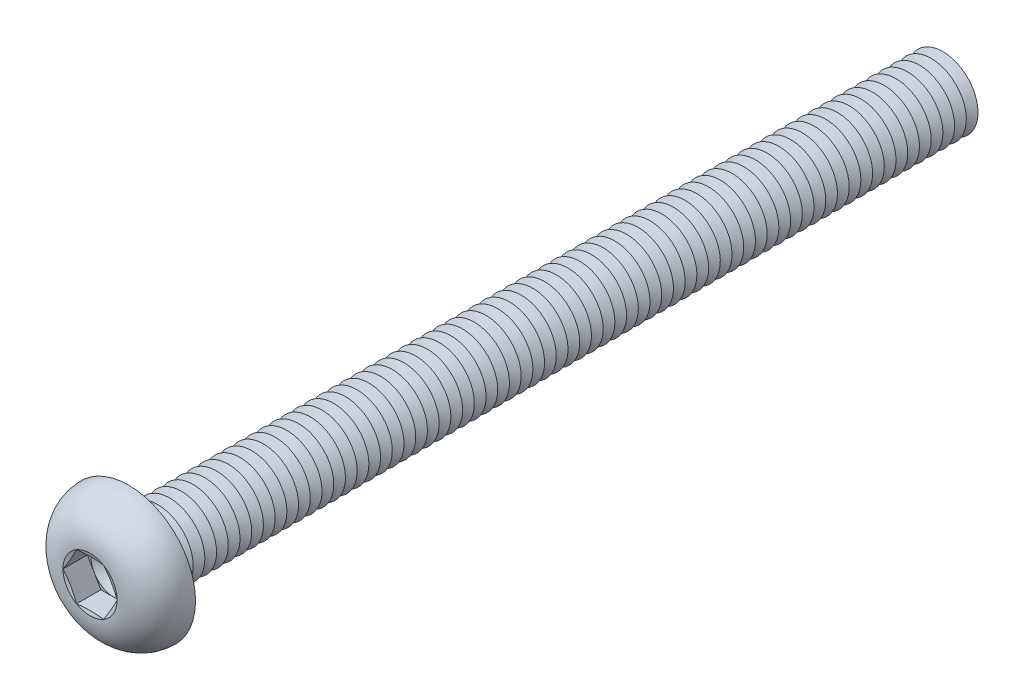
ISO-10303-21;
HEADER;
FILE_DESCRIPTION(('STEP AP214'),'2;1');
FILE_NAME('part.step','',(''),(''),'','','');
FILE_SCHEMA(('AUTOMOTIVE_DESIGN { 1 0 10303 214 1 1 1 1 }'));
ENDSEC;
DATA;
#1=APPLICATION_CONTEXT('core data for automotive mechanical design processes');
#2=APPLICATION_PROTOCOL_DEFINITION('international standard','automotive_design',2000,#1);
#3=PRODUCT_CONTEXT('',#1,'mechanical');
#4=PRODUCT('Part','Part','',(#3));
#5=PRODUCT_RELATED_PRODUCT_CATEGORY('part','',(#4));
#6=PRODUCT_DEFINITION_FORMATION('','',#4);
#7=PRODUCT_DEFINITION_CONTEXT('part definition',#1,'design');
#8=PRODUCT_DEFINITION('design','',#6,#7);
#9=PRODUCT_DEFINITION_SHAPE('','',#8);
#10=(LENGTH_UNIT() NAMED_UNIT(*) SI_UNIT(.MILLI.,.METRE.));
#11=(NAMED_UNIT(*) PLANE_ANGLE_UNIT() SI_UNIT($,.RADIAN.));
#12=(NAMED_UNIT(*) SI_UNIT($,.STERADIAN.) SOLID_ANGLE_UNIT());
#13=UNCERTAINTY_MEASURE_WITH_UNIT(LENGTH_MEASURE(1.E-05),#10,'distance_accuracy_value','');
#14=(GEOMETRIC_REPRESENTATION_CONTEXT(3) GLOBAL_UNCERTAINTY_ASSIGNED_CONTEXT((#13)) GLOBAL_UNIT_ASSIGNED_CONTEXT((#10,
#11,#12)) REPRESENTATION_CONTEXT('',''));
#15=CARTESIAN_POINT('',(0.,0.,0.));
#16=DIRECTION('',(0.,0.,1.));
#17=DIRECTION('',(1.,0.,0.));
#18=AXIS2_PLACEMENT_3D('',#15,#16,#17);
#19=CARTESIAN_POINT('',(0.,0.,0.609999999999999));
#20=DIRECTION('',(0.,0.,1.));
#21=DIRECTION('',(1.,0.,0.));
#22=AXIS2_PLACEMENT_3D('',#19,#20,#21);
#23=PLANE('',#22);
#24=CARTESIAN_POINT('',(0.,0.,0.609999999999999));
#25=DIRECTION('',(0.,0.,1.));
#26=DIRECTION('',(1.,0.,0.));
#27=AXIS2_PLACEMENT_3D('',#24,#25,#26);
#28=CIRCLE('',#27,0.999999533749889);
#29=CARTESIAN_POINT('',(0.866024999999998,0.499999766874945,0.609999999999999));
#30=VERTEX_POINT('',#29);
#31=CARTESIAN_POINT('',(0.,0.999999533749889,0.609999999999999));
#32=VERTEX_POINT('',#31);
#33=EDGE_CURVE('E118',#30,#32,#28,.T.);
#34=ORIENTED_EDGE('',*,*,#33,.F.);
#35=DIRECTION('',(-0.500000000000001,0.866025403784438,0.));
#36=VECTOR('',#35,1.);
#37=CARTESIAN_POINT('',(1.1547,0.,0.609999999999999));
#38=LINE('',#37,#36);
#39=CARTESIAN_POINT('',(0.577349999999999,0.999999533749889,0.609999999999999));
#40=VERTEX_POINT('',#39);
#41=EDGE_CURVE('E125',#30,#40,#38,.T.);
#42=ORIENTED_EDGE('',*,*,#41,.T.);
#43=DIRECTION('',(-1.,0.,0.));
#44=VECTOR('',#43,1.);
#45=CARTESIAN_POINT('',(0.577349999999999,0.999999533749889,0.609999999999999));
#46=LINE('',#45,#44);
#47=EDGE_CURVE('E136',#40,#32,#46,.T.);
#48=ORIENTED_EDGE('',*,*,#47,.T.);
#49=EDGE_LOOP('',(#34,#42,#48));
#50=FACE_BOUND('',#49,.T.);
#51=ADVANCED_FACE('F39',(#50),#23,.T.);
#52=CARTESIAN_POINT('',(0.,0.,0.609999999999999));
#53=DIRECTION('',(0.,0.,1.));
#54=DIRECTION('',(1.,0.,0.));
#55=AXIS2_PLACEMENT_3D('',#52,#53,#54);
#56=CIRCLE('',#55,0.999999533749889);
#57=CARTESIAN_POINT('',(-0.866024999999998,0.499999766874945,0.609999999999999));
#58=VERTEX_POINT('',#57);
#59=EDGE_CURVE('E11',#32,#58,#56,.T.);
#60=ORIENTED_EDGE('',*,*,#59,.F.);
#61=CARTESIAN_POINT('',(-0.577350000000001,0.999999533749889,0.609999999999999));
#62=VERTEX_POINT('',#61);
#63=EDGE_CURVE('E131',#32,#62,#46,.T.);
#64=ORIENTED_EDGE('',*,*,#63,.T.);
#65=DIRECTION('',(-0.5,-0.866025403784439,0.));
#66=VECTOR('',#65,1.);
#67=CARTESIAN_POINT('',(-0.577350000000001,0.999999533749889,0.609999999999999));
#68=LINE('',#67,#66);
#69=EDGE_CURVE('E134',#62,#58,#68,.T.);
#70=ORIENTED_EDGE('',*,*,#69,.T.);
#71=EDGE_LOOP('',(#60,#64,#70));
#72=FACE_BOUND('',#71,.T.);
#73=ADVANCED_FACE('F130',(#72),#23,.T.);
#74=CARTESIAN_POINT('',(-0.866024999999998,-0.499999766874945,0.609999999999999));
#75=VERTEX_POINT('',#74);
#76=EDGE_CURVE('E49',#58,#75,#56,.T.);
#77=ORIENTED_EDGE('',*,*,#76,.F.);
#78=CARTESIAN_POINT('',(-1.1547,0.,0.609999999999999));
#79=VERTEX_POINT('',#78);
#80=EDGE_CURVE('E143',#58,#79,#68,.T.);
#81=ORIENTED_EDGE('',*,*,#80,.T.);
#82=DIRECTION('',(0.5,-0.866025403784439,0.));
#83=VECTOR('',#82,1.);
#84=CARTESIAN_POINT('',(-1.1547,0.,0.609999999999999));
#85=LINE('',#84,#83);
#86=EDGE_CURVE('E152',#79,#75,#85,.T.);
#87=ORIENTED_EDGE('',*,*,#86,.T.);
#88=EDGE_LOOP('',(#77,#81,#87));
#89=FACE_BOUND('',#88,.T.);
#90=ADVANCED_FACE('F827',(#89),#23,.T.);
#91=CARTESIAN_POINT('',(0.,-0.999999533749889,0.609999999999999));
#92=VERTEX_POINT('',#91);
#93=EDGE_CURVE('E811',#75,#92,#56,.T.);
#94=ORIENTED_EDGE('',*,*,#93,.F.);
#95=CARTESIAN_POINT('',(-0.577349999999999,-0.999999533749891,0.609999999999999));
#96=VERTEX_POINT('',#95);
#97=EDGE_CURVE('E151',#75,#96,#85,.T.);
#98=ORIENTED_EDGE('',*,*,#97,.T.);
#99=DIRECTION('',(1.,0.,0.));
#100=VECTOR('',#99,1.);
#101=CARTESIAN_POINT('',(-0.577349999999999,-0.999999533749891,0.609999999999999));
#102=LINE('',#101,#100);
#103=EDGE_CURVE('E157',#96,#92,#102,.T.);
#104=ORIENTED_EDGE('',*,*,#103,.T.);
#105=EDGE_LOOP('',(#94,#98,#104));
#106=FACE_BOUND('',#105,.T.);
#107=ADVANCED_FACE('F820',(#106),#23,.T.);
#108=CARTESIAN_POINT('',(0.866024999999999,-0.499999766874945,0.609999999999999));
#109=VERTEX_POINT('',#108);
#110=EDGE_CURVE('E56',#92,#109,#56,.T.);
#111=ORIENTED_EDGE('',*,*,#110,.F.);
#112=CARTESIAN_POINT('',(0.577349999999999,-0.999999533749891,0.609999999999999));
#113=VERTEX_POINT('',#112);
#114=EDGE_CURVE('E156',#92,#113,#102,.T.);
#115=ORIENTED_EDGE('',*,*,#114,.T.);
#116=DIRECTION('',(0.5,0.866025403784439,0.));
#117=VECTOR('',#116,1.);
#118=CARTESIAN_POINT('',(0.577349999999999,-0.999999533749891,0.609999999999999));
#119=LINE('',#118,#117);
#120=EDGE_CURVE('E162',#113,#109,#119,.T.);
#121=ORIENTED_EDGE('',*,*,#120,.T.);
#122=EDGE_LOOP('',(#111,#115,#121));
#123=FACE_BOUND('',#122,.T.);
#124=ADVANCED_FACE('F897',(#123),#23,.T.);
#125=CARTESIAN_POINT('',(0.,0.,1.65));
#126=DIRECTION('',(0.,0.,1.));
#127=DIRECTION('',(0.,-1.,0.));
#128=AXIS2_PLACEMENT_3D('',#125,#126,#127);
#129=CONICAL_SURFACE('',#128,1.1547,1.30899693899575);
#130=CARTESIAN_POINT('',(1.15481547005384,-0.000199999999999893,1.65003094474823));
#131=CARTESIAN_POINT('',(1.13083002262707,0.0413440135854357,1.64359970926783));
#132=CARTESIAN_POINT('',(1.10680107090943,0.0829633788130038,1.63776108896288));
#133=CARTESIAN_POINT('',(1.05865826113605,0.166349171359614,1.62750303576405));
#134=CARTESIAN_POINT('',(1.03454437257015,0.208115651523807,1.62308418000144));
#135=CARTESIAN_POINT('',(0.986377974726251,0.291542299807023,1.61592375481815));
#136=CARTESIAN_POINT('',(0.962325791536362,0.333201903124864,1.61317364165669));
#137=CARTESIAN_POINT('',(0.914190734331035,0.416574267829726,1.60948600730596));
#138=CARTESIAN_POINT('',(0.890107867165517,0.458287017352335,1.60854813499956));
#139=CARTESIAN_POINT('',(0.841942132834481,0.541712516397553,1.60854813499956));
#140=CARTESIAN_POINT('',(0.817859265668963,0.583425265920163,1.60948600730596));
#141=CARTESIAN_POINT('',(0.769724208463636,0.666797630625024,1.61317364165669));
#142=CARTESIAN_POINT('',(0.745672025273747,0.708457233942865,1.61592375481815));
#143=CARTESIAN_POINT('',(0.697505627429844,0.791883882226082,1.62308418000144));
#144=CARTESIAN_POINT('',(0.673391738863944,0.833650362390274,1.62750303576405));
#145=CARTESIAN_POINT('',(0.625248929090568,0.917036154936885,1.63776108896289));
#146=CARTESIAN_POINT('',(0.60121997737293,0.958655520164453,1.64359970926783));
#147=CARTESIAN_POINT('',(0.577234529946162,1.00019953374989,1.65003094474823));
#148=B_SPLINE_CURVE_WITH_KNOTS('',3,(#130,#131,#132,#133,#134,#135,#136,#137,#138,#139,#140,
#141,#142,#143,#144,#145,#146,#147),.UNSPECIFIED.,.F.,.F.,(4,2,2,2,2,2,2,2,4),(0.,
0.145207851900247,0.290474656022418,0.434991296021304,0.579479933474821,0.723968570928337,
0.868485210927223,1.01375201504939,1.15895986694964),.UNSPECIFIED.);
#149=CARTESIAN_POINT('',(1.1547,0.,1.65));
#150=VERTEX_POINT('',#149);
#151=CARTESIAN_POINT('',(0.57735,0.99999953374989,1.65));
#152=VERTEX_POINT('',#151);
#153=EDGE_CURVE('E221',#150,#152,#148,.T.);
#154=ORIENTED_EDGE('',*,*,#153,.F.);
#155=CARTESIAN_POINT('',(0.,0.,1.65));
#156=DIRECTION('',(0.,0.,-1.));
#157=DIRECTION('',(0.,1.,0.));
#158=AXIS2_PLACEMENT_3D('',#155,#156,#157);
#159=CIRCLE('',#158,1.1547);
#160=EDGE_CURVE('E795',#152,#150,#159,.T.);
#161=ORIENTED_EDGE('',*,*,#160,.F.);
#162=EDGE_LOOP('',(#154,#161));
#163=FACE_BOUND('',#162,.T.);
#164=ADVANCED_FACE('F901',(#163),#129,.F.);
#165=CARTESIAN_POINT('',(0.577234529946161,-1.00019953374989,1.65003094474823));
#166=CARTESIAN_POINT('',(0.60121997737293,-0.958655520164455,1.64359970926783));
#167=CARTESIAN_POINT('',(0.625248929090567,-0.917036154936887,1.63776108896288));
#168=CARTESIAN_POINT('',(0.673391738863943,-0.833650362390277,1.62750303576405));
#169=CARTESIAN_POINT('',(0.697505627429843,-0.791883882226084,1.62308418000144));
#170=CARTESIAN_POINT('',(0.745672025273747,-0.708457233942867,1.61592375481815));
#171=CARTESIAN_POINT('',(0.769724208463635,-0.666797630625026,1.61317364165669));
#172=CARTESIAN_POINT('',(0.817859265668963,-0.583425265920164,1.60948600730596));
#173=CARTESIAN_POINT('',(0.84194213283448,-0.541712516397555,1.60854813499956));
#174=CARTESIAN_POINT('',(0.890107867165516,-0.458287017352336,1.60854813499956));
#175=CARTESIAN_POINT('',(0.914190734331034,-0.416574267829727,1.60948600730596));
#176=CARTESIAN_POINT('',(0.962325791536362,-0.333201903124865,1.61317364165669));
#177=CARTESIAN_POINT('',(0.98637797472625,-0.291542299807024,1.61592375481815));
#178=CARTESIAN_POINT('',(1.03454437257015,-0.208115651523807,1.62308418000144));
#179=CARTESIAN_POINT('',(1.05865826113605,-0.166349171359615,1.62750303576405));
#180=CARTESIAN_POINT('',(1.10680107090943,-0.082963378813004,1.63776108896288));
#181=CARTESIAN_POINT('',(1.13083002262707,-0.0413440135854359,1.64359970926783));
#182=CARTESIAN_POINT('',(1.15481547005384,0.000199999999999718,1.65003094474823));
#183=B_SPLINE_CURVE_WITH_KNOTS('',3,(#165,#166,#167,#168,#169,#170,#171,#172,#173,#174,#175,
#176,#177,#178,#179,#180,#181,#182),.UNSPECIFIED.,.F.,.F.,(4,2,2,2,2,2,2,2,4),(0.,
0.145207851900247,0.290474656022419,0.434991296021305,0.579479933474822,0.723968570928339,
0.868485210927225,1.0137520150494,1.15895986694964),.UNSPECIFIED.);
#184=CARTESIAN_POINT('',(0.577349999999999,-0.999999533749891,1.65));
#185=VERTEX_POINT('',#184);
#186=EDGE_CURVE('E230',#185,#150,#183,.T.);
#187=ORIENTED_EDGE('',*,*,#186,.F.);
#188=EDGE_CURVE('E800',#150,#185,#159,.T.);
#189=ORIENTED_EDGE('',*,*,#188,.F.);
#190=EDGE_LOOP('',(#187,#189));
#191=FACE_BOUND('',#190,.T.);
#192=ADVANCED_FACE('F863',(#191),#129,.F.);
#193=CARTESIAN_POINT('',(-1.7425668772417,-0.999999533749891,1.87893949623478));
#194=CARTESIAN_POINT('',(-1.65819693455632,-0.999999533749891,1.85935934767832));
#195=CARTESIAN_POINT('',(-1.57375647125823,-0.999999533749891,1.84006351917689));
#196=CARTESIAN_POINT('',(-1.40464514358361,-0.999999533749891,1.80242908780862));
#197=CARTESIAN_POINT('',(-1.31997423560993,-0.999999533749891,1.78409068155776));
#198=CARTESIAN_POINT('',(-1.14955192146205,-0.999999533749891,1.74860242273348));
#199=CARTESIAN_POINT('',(-1.06379782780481,-0.999999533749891,1.73146532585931));
#200=CARTESIAN_POINT('',(-0.891887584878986,-0.999999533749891,1.69925819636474));
#201=CARTESIAN_POINT('',(-0.805731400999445,-0.999999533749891,1.68418834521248));
#202=CARTESIAN_POINT('',(-0.635256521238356,-0.999999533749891,1.65751615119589));
#203=CARTESIAN_POINT('',(-0.550951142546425,-0.999999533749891,1.64583105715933));
#204=CARTESIAN_POINT('',(-0.381865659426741,-0.999999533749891,1.62668811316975));
#205=CARTESIAN_POINT('',(-0.297085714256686,-0.999999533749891,1.61922892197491));
#206=CARTESIAN_POINT('',(-0.127577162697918,-0.999999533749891,1.60981453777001));
#207=CARTESIAN_POINT('',(-0.0428499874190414,-0.999999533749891,1.60783514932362));
#208=CARTESIAN_POINT('',(0.126542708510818,-0.999999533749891,1.60973012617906));
#209=CARTESIAN_POINT('',(0.211208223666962,-0.999999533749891,1.61360496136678));
#210=CARTESIAN_POINT('',(0.356115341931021,-0.999999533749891,1.62460226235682));
#211=CARTESIAN_POINT('',(0.416458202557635,-0.999999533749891,1.63048841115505));
#212=CARTESIAN_POINT('',(0.536893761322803,-0.999999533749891,1.64437752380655));
#213=CARTESIAN_POINT('',(0.596986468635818,-0.999999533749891,1.65238040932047));
#214=CARTESIAN_POINT('',(0.777275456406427,-0.999999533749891,1.67888855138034));
#215=CARTESIAN_POINT('',(0.897104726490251,-0.999999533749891,1.69985858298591));
#216=CARTESIAN_POINT('',(1.07751611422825,-0.999999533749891,1.73433574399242));
#217=CARTESIAN_POINT('',(1.1383777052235,-0.999999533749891,1.74646914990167));
#218=CARTESIAN_POINT('',(1.25994955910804,-0.999999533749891,1.7714845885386));
#219=CARTESIAN_POINT('',(1.32065982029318,-0.999999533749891,1.78436662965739));
#220=CARTESIAN_POINT('',(1.44162663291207,-0.999999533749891,1.81062164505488));
#221=CARTESIAN_POINT('',(1.50188385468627,-0.999999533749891,1.82399156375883));
#222=CARTESIAN_POINT('',(1.62229550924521,-0.999999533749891,1.85116781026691));
#223=CARTESIAN_POINT('',(1.68244994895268,-0.999999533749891,1.86497410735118));
#224=CARTESIAN_POINT('',(1.7425668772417,-0.999999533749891,1.87893949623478));
#225=B_SPLINE_CURVE_WITH_KNOTS('',3,(#193,#194,#195,#196,#197,#198,#199,#200,#201,#202,#203,
#204,#205,#206,#207,#208,#209,#210,#211,#212,#213,#214,#215,#216,#217,#218,#219,#220,#221,#222,
#223,#224),.UNSPECIFIED.,.F.,.F.,(4,2,2,2,2,2,2,2,2,2,2,2,2,2,2,4),(0.,0.259842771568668,
0.519738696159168,0.782071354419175,1.04442702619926,1.29968778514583,1.55486748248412,
1.80891865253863,2.06299021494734,2.24483732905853,2.42667771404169,2.79149503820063,
2.97767344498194,3.16385393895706,3.34902052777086,3.53417411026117),.UNSPECIFIED.);
#226=CARTESIAN_POINT('',(-0.577349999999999,-0.999999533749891,1.65));
#227=VERTEX_POINT('',#226);
#228=EDGE_CURVE('E841',#227,#185,#225,.T.);
#229=ORIENTED_EDGE('',*,*,#228,.F.);
#230=EDGE_CURVE('E854',#185,#227,#159,.T.);
#231=ORIENTED_EDGE('',*,*,#230,.F.);
#232=EDGE_LOOP('',(#229,#231));
#233=FACE_BOUND('',#232,.T.);
#234=ADVANCED_FACE('F868',(#233),#129,.F.);
#235=CARTESIAN_POINT('',(-1.15481547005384,0.000199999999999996,1.65003094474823));
#236=CARTESIAN_POINT('',(-1.13083002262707,-0.0413440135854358,1.64359970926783));
#237=CARTESIAN_POINT('',(-1.10680107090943,-0.0829633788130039,1.63776108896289));
#238=CARTESIAN_POINT('',(-1.05865826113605,-0.166349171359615,1.62750303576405));
#239=CARTESIAN_POINT('',(-1.03454437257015,-0.208115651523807,1.62308418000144));
#240=CARTESIAN_POINT('',(-0.986377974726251,-0.291542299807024,1.61592375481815));
#241=CARTESIAN_POINT('',(-0.962325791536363,-0.333201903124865,1.61317364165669));
#242=CARTESIAN_POINT('',(-0.914190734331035,-0.416574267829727,1.60948600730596));
#243=CARTESIAN_POINT('',(-0.890107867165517,-0.458287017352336,1.60854813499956));
#244=CARTESIAN_POINT('',(-0.841942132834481,-0.541712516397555,1.60854813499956));
#245=CARTESIAN_POINT('',(-0.817859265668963,-0.583425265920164,1.60948600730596));
#246=CARTESIAN_POINT('',(-0.769724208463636,-0.666797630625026,1.61317364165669));
#247=CARTESIAN_POINT('',(-0.745672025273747,-0.708457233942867,1.61592375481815));
#248=CARTESIAN_POINT('',(-0.697505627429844,-0.791883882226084,1.62308418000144));
#249=CARTESIAN_POINT('',(-0.673391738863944,-0.833650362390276,1.62750303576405));
#250=CARTESIAN_POINT('',(-0.625248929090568,-0.917036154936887,1.63776108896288));
#251=CARTESIAN_POINT('',(-0.60121997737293,-0.958655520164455,1.64359970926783));
#252=CARTESIAN_POINT('',(-0.577234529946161,-1.00019953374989,1.65003094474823));
#253=B_SPLINE_CURVE_WITH_KNOTS('',3,(#235,#236,#237,#238,#239,#240,#241,#242,#243,#244,#245,
#246,#247,#248,#249,#250,#251,#252),.UNSPECIFIED.,.F.,.F.,(4,2,2,2,2,2,2,2,4),(0.,
0.145207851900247,0.290474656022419,0.434991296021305,0.579479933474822,0.723968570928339,
0.868485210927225,1.0137520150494,1.15895986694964),.UNSPECIFIED.);
#254=CARTESIAN_POINT('',(-1.1547,0.,1.65));
#255=VERTEX_POINT('',#254);
#256=EDGE_CURVE('E832',#255,#227,#253,.T.);
#257=ORIENTED_EDGE('',*,*,#256,.F.);
#258=EDGE_CURVE('E838',#227,#255,#159,.T.);
#259=ORIENTED_EDGE('',*,*,#258,.F.);
#260=EDGE_LOOP('',(#257,#259));
#261=FACE_BOUND('',#260,.T.);
#262=ADVANCED_FACE('F836',(#261),#129,.F.);
#263=CARTESIAN_POINT('',(-0.577234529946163,1.00019953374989,1.65003094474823));
#264=CARTESIAN_POINT('',(-0.601219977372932,0.958655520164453,1.64359970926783));
#265=CARTESIAN_POINT('',(-0.625248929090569,0.917036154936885,1.63776108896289));
#266=CARTESIAN_POINT('',(-0.673391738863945,0.833650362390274,1.62750303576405));
#267=CARTESIAN_POINT('',(-0.697505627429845,0.791883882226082,1.62308418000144));
#268=CARTESIAN_POINT('',(-0.745672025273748,0.708457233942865,1.61592375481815));
#269=CARTESIAN_POINT('',(-0.769724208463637,0.666797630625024,1.61317364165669));
#270=CARTESIAN_POINT('',(-0.817859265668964,0.583425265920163,1.60948600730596));
#271=CARTESIAN_POINT('',(-0.841942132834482,0.541712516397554,1.60854813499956));
#272=CARTESIAN_POINT('',(-0.890107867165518,0.458287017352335,1.60854813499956));
#273=CARTESIAN_POINT('',(-0.914190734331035,0.416574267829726,1.60948600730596));
#274=CARTESIAN_POINT('',(-0.962325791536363,0.333201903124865,1.61317364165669));
#275=CARTESIAN_POINT('',(-0.986377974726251,0.291542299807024,1.61592375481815));
#276=CARTESIAN_POINT('',(-1.03454437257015,0.208115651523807,1.62308418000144));
#277=CARTESIAN_POINT('',(-1.05865826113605,0.166349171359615,1.62750303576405));
#278=CARTESIAN_POINT('',(-1.10680107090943,0.082963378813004,1.63776108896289));
#279=CARTESIAN_POINT('',(-1.13083002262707,0.041344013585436,1.64359970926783));
#280=CARTESIAN_POINT('',(-1.15481547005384,-0.000199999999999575,1.65003094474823));
#281=B_SPLINE_CURVE_WITH_KNOTS('',3,(#263,#264,#265,#266,#267,#268,#269,#270,#271,#272,#273,
#274,#275,#276,#277,#278,#279,#280),.UNSPECIFIED.,.F.,.F.,(4,2,2,2,2,2,2,2,4),(0.,
0.145207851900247,0.290474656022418,0.434991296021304,0.57947993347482,0.723968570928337,
0.868485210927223,1.01375201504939,1.15895986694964),.UNSPECIFIED.);
#282=CARTESIAN_POINT('',(-0.577350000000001,0.999999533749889,1.65));
#283=VERTEX_POINT('',#282);
#284=EDGE_CURVE('E195',#283,#255,#281,.T.);
#285=ORIENTED_EDGE('',*,*,#284,.F.);
#286=EDGE_CURVE('E844',#255,#283,#159,.T.);
#287=ORIENTED_EDGE('',*,*,#286,.F.);
#288=EDGE_LOOP('',(#285,#287));
#289=FACE_BOUND('',#288,.T.);
#290=ADVANCED_FACE('F845',(#289),#129,.F.);
#291=CARTESIAN_POINT('',(0.,0.,-33.25));
#292=DIRECTION('',(0.,0.,1.));
#293=DIRECTION('',(0.,-1.,0.));
#294=AXIS2_PLACEMENT_3D('',#291,#292,#293);
#295=CONICAL_SURFACE('',#294,1.49999999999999,1.0471975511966);
#296=CARTESIAN_POINT('',(0.,0.,-33.5));
#297=DIRECTION('',(0.,0.,1.));
#298=DIRECTION('',(0.,-1.,0.));
#299=AXIS2_PLACEMENT_3D('',#296,#297,#298);
#300=CIRCLE('',#299,1.06698729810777);
#301=CARTESIAN_POINT('',(0.,-1.06698729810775,-33.5));
#302=VERTEX_POINT('',#301);
#303=EDGE_CURVE('E767',#302,#302,#300,.T.);
#304=ORIENTED_EDGE('',*,*,#303,.T.);
#305=EDGE_LOOP('',(#304));
#306=FACE_BOUND('',#305,.T.);
#307=CARTESIAN_POINT('',(0.,0.,-33.25));
#308=DIRECTION('',(0.,0.,1.));
#309=DIRECTION('',(0.,-1.,0.));
#310=AXIS2_PLACEMENT_3D('',#307,#308,#309);
#311=CIRCLE('',#310,1.49999999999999);
#312=CARTESIAN_POINT('',(0.,-1.49999999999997,-33.25));
#313=VERTEX_POINT('',#312);
#314=EDGE_CURVE('E763',#313,#313,#311,.T.);
#315=ORIENTED_EDGE('',*,*,#314,.F.);
#316=EDGE_LOOP('',(#315));
#317=FACE_BOUND('',#316,.T.);
#318=ADVANCED_FACE('F929',(#306,#317),#295,.T.);
#319=CARTESIAN_POINT('',(0.,0.,-33.5));
#320=DIRECTION('',(0.,0.,-1.));
#321=DIRECTION('',(0.,1.,0.));
#322=AXIS2_PLACEMENT_3D('',#319,#320,#321);
#323=CONICAL_SURFACE('',#322,1.06698729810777,1.0471975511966);
#324=CARTESIAN_POINT('',(0.,0.,-33.75));
#325=DIRECTION('',(0.,0.,1.));
#326=DIRECTION('',(0.,-1.,0.));
#327=AXIS2_PLACEMENT_3D('',#324,#325,#326);
#328=CIRCLE('',#327,1.49999999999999);
#329=CARTESIAN_POINT('',(0.,-1.49999999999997,-33.75));
#330=VERTEX_POINT('',#329);
#331=EDGE_CURVE('E770',#330,#330,#328,.T.);
#332=ORIENTED_EDGE('',*,*,#331,.T.);
#333=EDGE_LOOP('',(#332));
#334=FACE_BOUND('',#333,.T.);
#335=ORIENTED_EDGE('',*,*,#303,.F.);
#336=EDGE_LOOP('',(#335));
#337=FACE_BOUND('',#336,.T.);
#338=ADVANCED_FACE('F934',(#334,#337),#323,.T.);
#339=CARTESIAN_POINT('',(0.,1.5,-35.));
#340=DIRECTION('',(0.,0.,-1.));
#341=DIRECTION('',(0.,1.,0.));
#342=AXIS2_PLACEMENT_3D('',#339,#340,#341);
#343=PLANE('',#342);
#344=CARTESIAN_POINT('',(0.,0.,-35.));
#345=DIRECTION('',(0.,0.,1.));
#346=DIRECTION('',(0.,-1.,0.));
#347=AXIS2_PLACEMENT_3D('',#344,#345,#346);
#348=CIRCLE('',#347,1.06698729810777);
#349=CARTESIAN_POINT('',(0.,-1.06698729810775,-35.));
#350=VERTEX_POINT('',#349);
#351=EDGE_CURVE('E790',#350,#350,#348,.T.);
#352=ORIENTED_EDGE('',*,*,#351,.F.);
#353=EDGE_LOOP('',(#352));
#354=FACE_BOUND('',#353,.T.);
#355=ADVANCED_FACE('F1101',(#354),#343,.T.);
#356=CARTESIAN_POINT('',(0.,0.,-34.75));
#357=DIRECTION('',(0.,0.,1.));
#358=DIRECTION('',(0.,-1.,0.));
#359=AXIS2_PLACEMENT_3D('',#356,#357,#358);
#360=CONICAL_SURFACE('',#359,1.49999999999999,1.0471975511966);
#361=ORIENTED_EDGE('',*,*,#351,.T.);
#362=EDGE_LOOP('',(#361));
#363=FACE_BOUND('',#362,.T.);
#364=CARTESIAN_POINT('',(0.,0.,-34.75));
#365=DIRECTION('',(0.,0.,1.));
#366=DIRECTION('',(0.,-1.,0.));
#367=AXIS2_PLACEMENT_3D('',#364,#365,#366);
#368=CIRCLE('',#367,1.49999999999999);
#369=CARTESIAN_POINT('',(0.,-1.49999999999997,-34.75));
#370=VERTEX_POINT('',#369);
#371=EDGE_CURVE('E786',#370,#370,#368,.T.);
#372=ORIENTED_EDGE('',*,*,#371,.F.);
#373=EDGE_LOOP('',(#372));
#374=FACE_BOUND('',#373,.T.);
#375=ADVANCED_FACE('F1094',(#363,#374),#360,.T.);
#376=CARTESIAN_POINT('',(0.,0.,-34.5));
#377=DIRECTION('',(0.,0.,-1.));
#378=DIRECTION('',(0.,1.,0.));
#379=AXIS2_PLACEMENT_3D('',#376,#377,#378);
#380=CONICAL_SURFACE('',#379,1.06698729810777,1.0471975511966);
#381=ORIENTED_EDGE('',*,*,#371,.T.);
#382=EDGE_LOOP('',(#381));
#383=FACE_BOUND('',#382,.T.);
#384=CARTESIAN_POINT('',(0.,0.,-34.5));
#385=DIRECTION('',(0.,0.,1.));
#386=DIRECTION('',(0.,-1.,0.));
#387=AXIS2_PLACEMENT_3D('',#384,#385,#386);
#388=CIRCLE('',#387,1.06698729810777);
#389=CARTESIAN_POINT('',(0.,-1.06698729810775,-34.5));
#390=VERTEX_POINT('',#389);
#391=EDGE_CURVE('E782',#390,#390,#388,.T.);
#392=ORIENTED_EDGE('',*,*,#391,.F.);
#393=EDGE_LOOP('',(#392));
#394=FACE_BOUND('',#393,.T.);
#395=ADVANCED_FACE('F1100',(#383,#394),#380,.T.);
#396=CARTESIAN_POINT('',(0.,0.,-34.25));
#397=DIRECTION('',(0.,0.,1.));
#398=DIRECTION('',(0.,-1.,0.));
#399=AXIS2_PLACEMENT_3D('',#396,#397,#398);
#400=CONICAL_SURFACE('',#399,1.49999999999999,1.0471975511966);
#401=ORIENTED_EDGE('',*,*,#391,.T.);
#402=EDGE_LOOP('',(#401));
#403=FACE_BOUND('',#402,.T.);
#404=CARTESIAN_POINT('',(0.,0.,-34.25));
#405=DIRECTION('',(0.,0.,1.));
#406=DIRECTION('',(0.,-1.,0.));
#407=AXIS2_PLACEMENT_3D('',#404,#405,#406);
#408=CIRCLE('',#407,1.49999999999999);
#409=CARTESIAN_POINT('',(0.,-1.49999999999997,-34.25));
#410=VERTEX_POINT('',#409);
#411=EDGE_CURVE('E778',#410,#410,#408,.T.);
#412=ORIENTED_EDGE('',*,*,#411,.F.);
#413=EDGE_LOOP('',(#412));
#414=FACE_BOUND('',#413,.T.);
#415=ADVANCED_FACE('F1132',(#403,#414),#400,.T.);
#416=CARTESIAN_POINT('',(0.,0.,-34.));
#417=DIRECTION('',(0.,0.,-1.));
#418=DIRECTION('',(0.,1.,0.));
#419=AXIS2_PLACEMENT_3D('',#416,#417,#418);
#420=CONICAL_SURFACE('',#419,1.06698729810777,1.0471975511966);
#421=ORIENTED_EDGE('',*,*,#411,.T.);
#422=EDGE_LOOP('',(#421));
#423=FACE_BOUND('',#422,.T.);
#424=CARTESIAN_POINT('',(0.,0.,-34.));
#425=DIRECTION('',(0.,0.,1.));
#426=DIRECTION('',(0.,-1.,0.));
#427=AXIS2_PLACEMENT_3D('',#424,#425,#426);
#428=CIRCLE('',#427,1.06698729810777);
#429=CARTESIAN_POINT('',(0.,-1.06698729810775,-34.));
#430=VERTEX_POINT('',#429);
#431=EDGE_CURVE('E774',#430,#430,#428,.T.);
#432=ORIENTED_EDGE('',*,*,#431,.F.);
#433=EDGE_LOOP('',(#432));
#434=FACE_BOUND('',#433,.T.);
#435=ADVANCED_FACE('F1142',(#423,#434),#420,.T.);
#436=CARTESIAN_POINT('',(0.,0.,-33.75));
#437=DIRECTION('',(0.,0.,1.));
#438=DIRECTION('',(0.,-1.,0.));
#439=AXIS2_PLACEMENT_3D('',#436,#437,#438);
#440=CONICAL_SURFACE('',#439,1.49999999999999,1.0471975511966);
#441=ORIENTED_EDGE('',*,*,#431,.T.);
#442=EDGE_LOOP('',(#441));
#443=FACE_BOUND('',#442,.T.);
#444=ORIENTED_EDGE('',*,*,#331,.F.);
#445=EDGE_LOOP('',(#444));
#446=FACE_BOUND('',#445,.T.);
#447=ADVANCED_FACE('F1152',(#443,#446),#440,.T.);
#448=CARTESIAN_POINT('',(0.,0.,-32.75));
#449=DIRECTION('',(0.,0.,1.));
#450=DIRECTION('',(0.,-1.,0.));
#451=AXIS2_PLACEMENT_3D('',#448,#449,#450);
#452=CONICAL_SURFACE('',#451,1.49999999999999,1.0471975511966);
#453=CARTESIAN_POINT('',(0.,0.,-33.));
#454=DIRECTION('',(0.,0.,1.));
#455=DIRECTION('',(0.,-1.,0.));
#456=AXIS2_PLACEMENT_3D('',#453,#454,#455);
#457=CIRCLE('',#456,1.06698729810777);
#458=CARTESIAN_POINT('',(0.,-1.06698729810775,-33.));
#459=VERTEX_POINT('',#458);
#460=EDGE_CURVE('E759',#459,#459,#457,.T.);
#461=ORIENTED_EDGE('',*,*,#460,.T.);
#462=EDGE_LOOP('',(#461));
#463=FACE_BOUND('',#462,.T.);
#464=CARTESIAN_POINT('',(0.,0.,-32.75));
#465=DIRECTION('',(0.,0.,1.));
#466=DIRECTION('',(0.,-1.,0.));
#467=AXIS2_PLACEMENT_3D('',#464,#465,#466);
#468=CIRCLE('',#467,1.49999999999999);
#469=CARTESIAN_POINT('',(0.,-1.49999999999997,-32.75));
#470=VERTEX_POINT('',#469);
#471=EDGE_CURVE('E755',#470,#470,#468,.T.);
#472=ORIENTED_EDGE('',*,*,#471,.F.);
#473=EDGE_LOOP('',(#472));
#474=FACE_BOUND('',#473,.T.);
#475=ADVANCED_FACE('F1162',(#463,#474),#452,.T.);
#476=CARTESIAN_POINT('',(0.,0.,-33.));
#477=DIRECTION('',(0.,0.,-1.));
#478=DIRECTION('',(0.,1.,0.));
#479=AXIS2_PLACEMENT_3D('',#476,#477,#478);
#480=CONICAL_SURFACE('',#479,1.06698729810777,1.0471975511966);
#481=ORIENTED_EDGE('',*,*,#314,.T.);
#482=EDGE_LOOP('',(#481));
#483=FACE_BOUND('',#482,.T.);
#484=ORIENTED_EDGE('',*,*,#460,.F.);
#485=EDGE_LOOP('',(#484));
#486=FACE_BOUND('',#485,.T.);
#487=ADVANCED_FACE('F1172',(#483,#486),#480,.T.);
#488=CARTESIAN_POINT('',(0.,0.,-32.25));
#489=DIRECTION('',(0.,0.,1.));
#490=DIRECTION('',(0.,-1.,0.));
#491=AXIS2_PLACEMENT_3D('',#488,#489,#490);
#492=CONICAL_SURFACE('',#491,1.49999999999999,1.0471975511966);
#493=CARTESIAN_POINT('',(0.,0.,-32.5));
#494=DIRECTION('',(0.,0.,1.));
#495=DIRECTION('',(0.,-1.,0.));
#496=AXIS2_PLACEMENT_3D('',#493,#494,#495);
#497=CIRCLE('',#496,1.06698729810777);
#498=CARTESIAN_POINT('',(0.,-1.06698729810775,-32.5));
#499=VERTEX_POINT('',#498);
#500=EDGE_CURVE('E751',#499,#499,#497,.T.);
#501=ORIENTED_EDGE('',*,*,#500,.T.);
#502=EDGE_LOOP('',(#501));
#503=FACE_BOUND('',#502,.T.);
#504=CARTESIAN_POINT('',(0.,0.,-32.25));
#505=DIRECTION('',(0.,0.,1.));
#506=DIRECTION('',(0.,-1.,0.));
#507=AXIS2_PLACEMENT_3D('',#504,#505,#506);
#508=CIRCLE('',#507,1.49999999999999);
#509=CARTESIAN_POINT('',(0.,-1.49999999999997,-32.25));
#510=VERTEX_POINT('',#509);
#511=EDGE_CURVE('E747',#510,#510,#508,.T.);
#512=ORIENTED_EDGE('',*,*,#511,.F.);
#513=EDGE_LOOP('',(#512));
#514=FACE_BOUND('',#513,.T.);
#515=ADVANCED_FACE('F1182',(#503,#514),#492,.T.);
#516=CARTESIAN_POINT('',(0.,0.,-32.5));
#517=DIRECTION('',(0.,0.,-1.));
#518=DIRECTION('',(0.,1.,0.));
#519=AXIS2_PLACEMENT_3D('',#516,#517,#518);
#520=CONICAL_SURFACE('',#519,1.06698729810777,1.0471975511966);
#521=ORIENTED_EDGE('',*,*,#471,.T.);
#522=EDGE_LOOP('',(#521));
#523=FACE_BOUND('',#522,.T.);
#524=ORIENTED_EDGE('',*,*,#500,.F.);
#525=EDGE_LOOP('',(#524));
#526=FACE_BOUND('',#525,.T.);
#527=ADVANCED_FACE('F1192',(#523,#526),#520,.T.);
#528=CARTESIAN_POINT('',(0.,0.,-31.75));
#529=DIRECTION('',(0.,0.,1.));
#530=DIRECTION('',(0.,-1.,0.));
#531=AXIS2_PLACEMENT_3D('',#528,#529,#530);
#532=CONICAL_SURFACE('',#531,1.49999999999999,1.0471975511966);
#533=CARTESIAN_POINT('',(0.,0.,-32.));
#534=DIRECTION('',(0.,0.,1.));
#535=DIRECTION('',(0.,-1.,0.));
#536=AXIS2_PLACEMENT_3D('',#533,#534,#535);
#537=CIRCLE('',#536,1.06698729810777);
#538=CARTESIAN_POINT('',(0.,-1.06698729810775,-32.));
#539=VERTEX_POINT('',#538);
#540=EDGE_CURVE('E743',#539,#539,#537,.T.);
#541=ORIENTED_EDGE('',*,*,#540,.T.);
#542=EDGE_LOOP('',(#541));
#543=FACE_BOUND('',#542,.T.);
#544=CARTESIAN_POINT('',(0.,0.,-31.75));
#545=DIRECTION('',(0.,0.,1.));
#546=DIRECTION('',(0.,-1.,0.));
#547=AXIS2_PLACEMENT_3D('',#544,#545,#546);
#548=CIRCLE('',#547,1.49999999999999);
#549=CARTESIAN_POINT('',(0.,-1.49999999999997,-31.75));
#550=VERTEX_POINT('',#549);
#551=EDGE_CURVE('E739',#550,#550,#548,.T.);
#552=ORIENTED_EDGE('',*,*,#551,.F.);
#553=EDGE_LOOP('',(#552));
#554=FACE_BOUND('',#553,.T.);
#555=ADVANCED_FACE('F1202',(#543,#554),#532,.T.);
#556=CARTESIAN_POINT('',(0.,0.,-32.));
#557=DIRECTION('',(0.,0.,-1.));
#558=DIRECTION('',(0.,1.,0.));
#559=AXIS2_PLACEMENT_3D('',#556,#557,#558);
#560=CONICAL_SURFACE('',#559,1.06698729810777,1.0471975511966);
#561=ORIENTED_EDGE('',*,*,#511,.T.);
#562=EDGE_LOOP('',(#561));
#563=FACE_BOUND('',#562,.T.);
#564=ORIENTED_EDGE('',*,*,#540,.F.);
#565=EDGE_LOOP('',(#564));
#566=FACE_BOUND('',#565,.T.);
#567=ADVANCED_FACE('F1212',(#563,#566),#560,.T.);
#568=CARTESIAN_POINT('',(0.,0.,-31.25));
#569=DIRECTION('',(0.,0.,1.));
#570=DIRECTION('',(0.,-1.,0.));
#571=AXIS2_PLACEMENT_3D('',#568,#569,#570);
#572=CONICAL_SURFACE('',#571,1.49999999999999,1.0471975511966);
#573=CARTESIAN_POINT('',(0.,0.,-31.5));
#574=DIRECTION('',(0.,0.,1.));
#575=DIRECTION('',(0.,-1.,0.));
#576=AXIS2_PLACEMENT_3D('',#573,#574,#575);
#577=CIRCLE('',#576,1.06698729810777);
#578=CARTESIAN_POINT('',(0.,-1.06698729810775,-31.5));
#579=VERTEX_POINT('',#578);
#580=EDGE_CURVE('E735',#579,#579,#577,.T.);
#581=ORIENTED_EDGE('',*,*,#580,.T.);
#582=EDGE_LOOP('',(#581));
#583=FACE_BOUND('',#582,.T.);
#584=CARTESIAN_POINT('',(0.,0.,-31.25));
#585=DIRECTION('',(0.,0.,1.));
#586=DIRECTION('',(0.,-1.,0.));
#587=AXIS2_PLACEMENT_3D('',#584,#585,#586);
#588=CIRCLE('',#587,1.49999999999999);
#589=CARTESIAN_POINT('',(0.,-1.49999999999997,-31.25));
#590=VERTEX_POINT('',#589);
#591=EDGE_CURVE('E731',#590,#590,#588,.T.);
#592=ORIENTED_EDGE('',*,*,#591,.F.);
#593=EDGE_LOOP('',(#592));
#594=FACE_BOUND('',#593,.T.);
#595=ADVANCED_FACE('F1222',(#583,#594),#572,.T.);
#596=CARTESIAN_POINT('',(0.,0.,-31.5));
#597=DIRECTION('',(0.,0.,-1.));
#598=DIRECTION('',(0.,1.,0.));
#599=AXIS2_PLACEMENT_3D('',#596,#597,#598);
#600=CONICAL_SURFACE('',#599,1.06698729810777,1.0471975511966);
#601=ORIENTED_EDGE('',*,*,#551,.T.);
#602=EDGE_LOOP('',(#601));
#603=FACE_BOUND('',#602,.T.);
#604=ORIENTED_EDGE('',*,*,#580,.F.);
#605=EDGE_LOOP('',(#604));
#606=FACE_BOUND('',#605,.T.);
#607=ADVANCED_FACE('F1232',(#603,#606),#600,.T.);
#608=CARTESIAN_POINT('',(0.,0.,-30.75));
#609=DIRECTION('',(0.,0.,1.));
#610=DIRECTION('',(0.,-1.,0.));
#611=AXIS2_PLACEMENT_3D('',#608,#609,#610);
#612=CONICAL_SURFACE('',#611,1.49999999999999,1.0471975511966);
#613=CARTESIAN_POINT('',(0.,0.,-31.));
#614=DIRECTION('',(0.,0.,1.));
#615=DIRECTION('',(0.,-1.,0.));
#616=AXIS2_PLACEMENT_3D('',#613,#614,#615);
#617=CIRCLE('',#616,1.06698729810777);
#618=CARTESIAN_POINT('',(0.,-1.06698729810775,-31.));
#619=VERTEX_POINT('',#618);
#620=EDGE_CURVE('E727',#619,#619,#617,.T.);
#621=ORIENTED_EDGE('',*,*,#620,.T.);
#622=EDGE_LOOP('',(#621));
#623=FACE_BOUND('',#622,.T.);
#624=CARTESIAN_POINT('',(0.,0.,-30.75));
#625=DIRECTION('',(0.,0.,1.));
#626=DIRECTION('',(0.,-1.,0.));
#627=AXIS2_PLACEMENT_3D('',#624,#625,#626);
#628=CIRCLE('',#627,1.49999999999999);
#629=CARTESIAN_POINT('',(0.,-1.49999999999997,-30.75));
#630=VERTEX_POINT('',#629);
#631=EDGE_CURVE('E723',#630,#630,#628,.T.);
#632=ORIENTED_EDGE('',*,*,#631,.F.);
#633=EDGE_LOOP('',(#632));
#634=FACE_BOUND('',#633,.T.);
#635=ADVANCED_FACE('F1242',(#623,#634),#612,.T.);
#636=CARTESIAN_POINT('',(0.,0.,-31.));
#637=DIRECTION('',(0.,0.,-1.));
#638=DIRECTION('',(0.,1.,0.));
#639=AXIS2_PLACEMENT_3D('',#636,#637,#638);
#640=CONICAL_SURFACE('',#639,1.06698729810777,1.0471975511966);
#641=ORIENTED_EDGE('',*,*,#591,.T.);
#642=EDGE_LOOP('',(#641));
#643=FACE_BOUND('',#642,.T.);
#644=ORIENTED_EDGE('',*,*,#620,.F.);
#645=EDGE_LOOP('',(#644));
#646=FACE_BOUND('',#645,.T.);
#647=ADVANCED_FACE('F1252',(#643,#646),#640,.T.);
#648=CARTESIAN_POINT('',(0.,0.,-30.25));
#649=DIRECTION('',(0.,0.,1.));
#650=DIRECTION('',(0.,-1.,0.));
#651=AXIS2_PLACEMENT_3D('',#648,#649,#650);
#652=CONICAL_SURFACE('',#651,1.49999999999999,1.0471975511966);
#653=CARTESIAN_POINT('',(0.,0.,-30.5));
#654=DIRECTION('',(0.,0.,1.));
#655=DIRECTION('',(0.,-1.,0.));
#656=AXIS2_PLACEMENT_3D('',#653,#654,#655);
#657=CIRCLE('',#656,1.06698729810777);
#658=CARTESIAN_POINT('',(0.,-1.06698729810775,-30.5));
#659=VERTEX_POINT('',#658);
#660=EDGE_CURVE('E719',#659,#659,#657,.T.);
#661=ORIENTED_EDGE('',*,*,#660,.T.);
#662=EDGE_LOOP('',(#661));
#663=FACE_BOUND('',#662,.T.);
#664=CARTESIAN_POINT('',(0.,0.,-30.25));
#665=DIRECTION('',(0.,0.,1.));
#666=DIRECTION('',(0.,-1.,0.));
#667=AXIS2_PLACEMENT_3D('',#664,#665,#666);
#668=CIRCLE('',#667,1.49999999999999);
#669=CARTESIAN_POINT('',(0.,-1.49999999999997,-30.25));
#670=VERTEX_POINT('',#669);
#671=EDGE_CURVE('E715',#670,#670,#668,.T.);
#672=ORIENTED_EDGE('',*,*,#671,.F.);
#673=EDGE_LOOP('',(#672));
#674=FACE_BOUND('',#673,.T.);
#675=ADVANCED_FACE('F1262',(#663,#674),#652,.T.);
#676=CARTESIAN_POINT('',(0.,0.,-30.5));
#677=DIRECTION('',(0.,0.,-1.));
#678=DIRECTION('',(0.,1.,0.));
#679=AXIS2_PLACEMENT_3D('',#676,#677,#678);
#680=CONICAL_SURFACE('',#679,1.06698729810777,1.0471975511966);
#681=ORIENTED_EDGE('',*,*,#631,.T.);
#682=EDGE_LOOP('',(#681));
#683=FACE_BOUND('',#682,.T.);
#684=ORIENTED_EDGE('',*,*,#660,.F.);
#685=EDGE_LOOP('',(#684));
#686=FACE_BOUND('',#685,.T.);
#687=ADVANCED_FACE('F1272',(#683,#686),#680,.T.);
#688=CARTESIAN_POINT('',(0.,0.,-29.75));
#689=DIRECTION('',(0.,0.,1.));
#690=DIRECTION('',(0.,-1.,0.));
#691=AXIS2_PLACEMENT_3D('',#688,#689,#690);
#692=CONICAL_SURFACE('',#691,1.49999999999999,1.0471975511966);
#693=CARTESIAN_POINT('',(0.,0.,-30.));
#694=DIRECTION('',(0.,0.,1.));
#695=DIRECTION('',(0.,-1.,0.));
#696=AXIS2_PLACEMENT_3D('',#693,#694,#695);
#697=CIRCLE('',#696,1.06698729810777);
#698=CARTESIAN_POINT('',(0.,-1.06698729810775,-30.));
#699=VERTEX_POINT('',#698);
#700=EDGE_CURVE('E711',#699,#699,#697,.T.);
#701=ORIENTED_EDGE('',*,*,#700,.T.);
#702=EDGE_LOOP('',(#701));
#703=FACE_BOUND('',#702,.T.);
#704=CARTESIAN_POINT('',(0.,0.,-29.75));
#705=DIRECTION('',(0.,0.,1.));
#706=DIRECTION('',(0.,-1.,0.));
#707=AXIS2_PLACEMENT_3D('',#704,#705,#706);
#708=CIRCLE('',#707,1.49999999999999);
#709=CARTESIAN_POINT('',(0.,-1.49999999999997,-29.75));
#710=VERTEX_POINT('',#709);
#711=EDGE_CURVE('E707',#710,#710,#708,.T.);
#712=ORIENTED_EDGE('',*,*,#711,.F.);
#713=EDGE_LOOP('',(#712));
#714=FACE_BOUND('',#713,.T.);
#715=ADVANCED_FACE('F1282',(#703,#714),#692,.T.);
#716=CARTESIAN_POINT('',(0.,0.,-30.));
#717=DIRECTION('',(0.,0.,-1.));
#718=DIRECTION('',(0.,1.,0.));
#719=AXIS2_PLACEMENT_3D('',#716,#717,#718);
#720=CONICAL_SURFACE('',#719,1.06698729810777,1.0471975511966);
#721=ORIENTED_EDGE('',*,*,#671,.T.);
#722=EDGE_LOOP('',(#721));
#723=FACE_BOUND('',#722,.T.);
#724=ORIENTED_EDGE('',*,*,#700,.F.);
#725=EDGE_LOOP('',(#724));
#726=FACE_BOUND('',#725,.T.);
#727=ADVANCED_FACE('F1292',(#723,#726),#720,.T.);
#728=CARTESIAN_POINT('',(0.,0.,-29.25));
#729=DIRECTION('',(0.,0.,1.));
#730=DIRECTION('',(0.,-1.,0.));
#731=AXIS2_PLACEMENT_3D('',#728,#729,#730);
#732=CONICAL_SURFACE('',#731,1.49999999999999,1.0471975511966);
#733=CARTESIAN_POINT('',(0.,0.,-29.5));
#734=DIRECTION('',(0.,0.,1.));
#735=DIRECTION('',(0.,-1.,0.));
#736=AXIS2_PLACEMENT_3D('',#733,#734,#735);
#737=CIRCLE('',#736,1.06698729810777);
#738=CARTESIAN_POINT('',(0.,-1.06698729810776,-29.5));
#739=VERTEX_POINT('',#738);
#740=EDGE_CURVE('E703',#739,#739,#737,.T.);
#741=ORIENTED_EDGE('',*,*,#740,.T.);
#742=EDGE_LOOP('',(#741));
#743=FACE_BOUND('',#742,.T.);
#744=CARTESIAN_POINT('',(0.,0.,-29.25));
#745=DIRECTION('',(0.,0.,1.));
#746=DIRECTION('',(0.,-1.,0.));
#747=AXIS2_PLACEMENT_3D('',#744,#745,#746);
#748=CIRCLE('',#747,1.49999999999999);
#749=CARTESIAN_POINT('',(0.,-1.49999999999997,-29.25));
#750=VERTEX_POINT('',#749);
#751=EDGE_CURVE('E699',#750,#750,#748,.T.);
#752=ORIENTED_EDGE('',*,*,#751,.F.);
#753=EDGE_LOOP('',(#752));
#754=FACE_BOUND('',#753,.T.);
#755=ADVANCED_FACE('F1302',(#743,#754),#732,.T.);
#756=CARTESIAN_POINT('',(0.,0.,-29.5));
#757=DIRECTION('',(0.,0.,-1.));
#758=DIRECTION('',(0.,1.,0.));
#759=AXIS2_PLACEMENT_3D('',#756,#757,#758);
#760=CONICAL_SURFACE('',#759,1.06698729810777,1.0471975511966);
#761=ORIENTED_EDGE('',*,*,#711,.T.);
#762=EDGE_LOOP('',(#761));
#763=FACE_BOUND('',#762,.T.);
#764=ORIENTED_EDGE('',*,*,#740,.F.);
#765=EDGE_LOOP('',(#764));
#766=FACE_BOUND('',#765,.T.);
#767=ADVANCED_FACE('F1312',(#763,#766),#760,.T.);
#768=CARTESIAN_POINT('',(0.,0.,-28.75));
#769=DIRECTION('',(0.,0.,1.));
#770=DIRECTION('',(0.,-1.,0.));
#771=AXIS2_PLACEMENT_3D('',#768,#769,#770);
#772=CONICAL_SURFACE('',#771,1.49999999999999,1.0471975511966);
#773=CARTESIAN_POINT('',(0.,0.,-29.));
#774=DIRECTION('',(0.,0.,1.));
#775=DIRECTION('',(0.,-1.,0.));
#776=AXIS2_PLACEMENT_3D('',#773,#774,#775);
#777=CIRCLE('',#776,1.06698729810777);
#778=CARTESIAN_POINT('',(0.,-1.06698729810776,-29.));
#779=VERTEX_POINT('',#778);
#780=EDGE_CURVE('E695',#779,#779,#777,.T.);
#781=ORIENTED_EDGE('',*,*,#780,.T.);
#782=EDGE_LOOP('',(#781));
#783=FACE_BOUND('',#782,.T.);
#784=CARTESIAN_POINT('',(0.,0.,-28.75));
#785=DIRECTION('',(0.,0.,1.));
#786=DIRECTION('',(0.,-1.,0.));
#787=AXIS2_PLACEMENT_3D('',#784,#785,#786);
#788=CIRCLE('',#787,1.49999999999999);
#789=CARTESIAN_POINT('',(0.,-1.49999999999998,-28.75));
#790=VERTEX_POINT('',#789);
#791=EDGE_CURVE('E691',#790,#790,#788,.T.);
#792=ORIENTED_EDGE('',*,*,#791,.F.);
#793=EDGE_LOOP('',(#792));
#794=FACE_BOUND('',#793,.T.);
#795=ADVANCED_FACE('F1322',(#783,#794),#772,.T.);
#796=CARTESIAN_POINT('',(0.,0.,-29.));
#797=DIRECTION('',(0.,0.,-1.));
#798=DIRECTION('',(0.,1.,0.));
#799=AXIS2_PLACEMENT_3D('',#796,#797,#798);
#800=CONICAL_SURFACE('',#799,1.06698729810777,1.0471975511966);
#801=ORIENTED_EDGE('',*,*,#751,.T.);
#802=EDGE_LOOP('',(#801));
#803=FACE_BOUND('',#802,.T.);
#804=ORIENTED_EDGE('',*,*,#780,.F.);
#805=EDGE_LOOP('',(#804));
#806=FACE_BOUND('',#805,.T.);
#807=ADVANCED_FACE('F1332',(#803,#806),#800,.T.);
#808=CARTESIAN_POINT('',(0.,0.,-28.25));
#809=DIRECTION('',(0.,0.,1.));
#810=DIRECTION('',(0.,-1.,0.));
#811=AXIS2_PLACEMENT_3D('',#808,#809,#810);
#812=CONICAL_SURFACE('',#811,1.49999999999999,1.0471975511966);
#813=CARTESIAN_POINT('',(0.,0.,-28.5));
#814=DIRECTION('',(0.,0.,1.));
#815=DIRECTION('',(0.,-1.,0.));
#816=AXIS2_PLACEMENT_3D('',#813,#814,#815);
#817=CIRCLE('',#816,1.06698729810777);
#818=CARTESIAN_POINT('',(0.,-1.06698729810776,-28.5));
#819=VERTEX_POINT('',#818);
#820=EDGE_CURVE('E687',#819,#819,#817,.T.);
#821=ORIENTED_EDGE('',*,*,#820,.T.);
#822=EDGE_LOOP('',(#821));
#823=FACE_BOUND('',#822,.T.);
#824=CARTESIAN_POINT('',(0.,0.,-28.25));
#825=DIRECTION('',(0.,0.,1.));
#826=DIRECTION('',(0.,-1.,0.));
#827=AXIS2_PLACEMENT_3D('',#824,#825,#826);
#828=CIRCLE('',#827,1.49999999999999);
#829=CARTESIAN_POINT('',(0.,-1.49999999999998,-28.25));
#830=VERTEX_POINT('',#829);
#831=EDGE_CURVE('E683',#830,#830,#828,.T.);
#832=ORIENTED_EDGE('',*,*,#831,.F.);
#833=EDGE_LOOP('',(#832));
#834=FACE_BOUND('',#833,.T.);
#835=ADVANCED_FACE('F1342',(#823,#834),#812,.T.);
#836=CARTESIAN_POINT('',(0.,0.,-28.5));
#837=DIRECTION('',(0.,0.,-1.));
#838=DIRECTION('',(0.,1.,0.));
#839=AXIS2_PLACEMENT_3D('',#836,#837,#838);
#840=CONICAL_SURFACE('',#839,1.06698729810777,1.0471975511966);
#841=ORIENTED_EDGE('',*,*,#791,.T.);
#842=EDGE_LOOP('',(#841));
#843=FACE_BOUND('',#842,.T.);
#844=ORIENTED_EDGE('',*,*,#820,.F.);
#845=EDGE_LOOP('',(#844));
#846=FACE_BOUND('',#845,.T.);
#847=ADVANCED_FACE('F1352',(#843,#846),#840,.T.);
#848=CARTESIAN_POINT('',(0.,0.,-27.75));
#849=DIRECTION('',(0.,0.,1.));
#850=DIRECTION('',(0.,-1.,0.));
#851=AXIS2_PLACEMENT_3D('',#848,#849,#850);
#852=CONICAL_SURFACE('',#851,1.49999999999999,1.0471975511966);
#853=CARTESIAN_POINT('',(0.,0.,-28.));
#854=DIRECTION('',(0.,0.,1.));
#855=DIRECTION('',(0.,-1.,0.));
#856=AXIS2_PLACEMENT_3D('',#853,#854,#855);
#857=CIRCLE('',#856,1.06698729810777);
#858=CARTESIAN_POINT('',(0.,-1.06698729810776,-28.));
#859=VERTEX_POINT('',#858);
#860=EDGE_CURVE('E679',#859,#859,#857,.T.);
#861=ORIENTED_EDGE('',*,*,#860,.T.);
#862=EDGE_LOOP('',(#861));
#863=FACE_BOUND('',#862,.T.);
#864=CARTESIAN_POINT('',(0.,0.,-27.75));
#865=DIRECTION('',(0.,0.,1.));
#866=DIRECTION('',(0.,-1.,0.));
#867=AXIS2_PLACEMENT_3D('',#864,#865,#866);
#868=CIRCLE('',#867,1.49999999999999);
#869=CARTESIAN_POINT('',(0.,-1.49999999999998,-27.75));
#870=VERTEX_POINT('',#869);
#871=EDGE_CURVE('E675',#870,#870,#868,.T.);
#872=ORIENTED_EDGE('',*,*,#871,.F.);
#873=EDGE_LOOP('',(#872));
#874=FACE_BOUND('',#873,.T.);
#875=ADVANCED_FACE('F1362',(#863,#874),#852,.T.);
#876=CARTESIAN_POINT('',(0.,0.,-28.));
#877=DIRECTION('',(0.,0.,-1.));
#878=DIRECTION('',(0.,1.,0.));
#879=AXIS2_PLACEMENT_3D('',#876,#877,#878);
#880=CONICAL_SURFACE('',#879,1.06698729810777,1.0471975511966);
#881=ORIENTED_EDGE('',*,*,#831,.T.);
#882=EDGE_LOOP('',(#881));
#883=FACE_BOUND('',#882,.T.);
#884=ORIENTED_EDGE('',*,*,#860,.F.);
#885=EDGE_LOOP('',(#884));
#886=FACE_BOUND('',#885,.T.);
#887=ADVANCED_FACE('F1372',(#883,#886),#880,.T.);
#888=CARTESIAN_POINT('',(0.,0.,-27.25));
#889=DIRECTION('',(0.,0.,1.));
#890=DIRECTION('',(0.,-1.,0.));
#891=AXIS2_PLACEMENT_3D('',#888,#889,#890);
#892=CONICAL_SURFACE('',#891,1.49999999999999,1.0471975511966);
#893=CARTESIAN_POINT('',(0.,0.,-27.5));
#894=DIRECTION('',(0.,0.,1.));
#895=DIRECTION('',(0.,-1.,0.));
#896=AXIS2_PLACEMENT_3D('',#893,#894,#895);
#897=CIRCLE('',#896,1.06698729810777);
#898=CARTESIAN_POINT('',(0.,-1.06698729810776,-27.5));
#899=VERTEX_POINT('',#898);
#900=EDGE_CURVE('E671',#899,#899,#897,.T.);
#901=ORIENTED_EDGE('',*,*,#900,.T.);
#902=EDGE_LOOP('',(#901));
#903=FACE_BOUND('',#902,.T.);
#904=CARTESIAN_POINT('',(0.,0.,-27.25));
#905=DIRECTION('',(0.,0.,1.));
#906=DIRECTION('',(0.,-1.,0.));
#907=AXIS2_PLACEMENT_3D('',#904,#905,#906);
#908=CIRCLE('',#907,1.49999999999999);
#909=CARTESIAN_POINT('',(0.,-1.49999999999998,-27.25));
#910=VERTEX_POINT('',#909);
#911=EDGE_CURVE('E667',#910,#910,#908,.T.);
#912=ORIENTED_EDGE('',*,*,#911,.F.);
#913=EDGE_LOOP('',(#912));
#914=FACE_BOUND('',#913,.T.);
#915=ADVANCED_FACE('F1382',(#903,#914),#892,.T.);
#916=CARTESIAN_POINT('',(0.,0.,-27.5));
#917=DIRECTION('',(0.,0.,-1.));
#918=DIRECTION('',(0.,1.,0.));
#919=AXIS2_PLACEMENT_3D('',#916,#917,#918);
#920=CONICAL_SURFACE('',#919,1.06698729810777,1.0471975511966);
#921=ORIENTED_EDGE('',*,*,#871,.T.);
#922=EDGE_LOOP('',(#921));
#923=FACE_BOUND('',#922,.T.);
#924=ORIENTED_EDGE('',*,*,#900,.F.);
#925=EDGE_LOOP('',(#924));
#926=FACE_BOUND('',#925,.T.);
#927=ADVANCED_FACE('F1392',(#923,#926),#920,.T.);
#928=CARTESIAN_POINT('',(0.,0.,-26.75));
#929=DIRECTION('',(0.,0.,1.));
#930=DIRECTION('',(0.,-1.,0.));
#931=AXIS2_PLACEMENT_3D('',#928,#929,#930);
#932=CONICAL_SURFACE('',#931,1.49999999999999,1.0471975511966);
#933=CARTESIAN_POINT('',(0.,0.,-27.));
#934=DIRECTION('',(0.,0.,1.));
#935=DIRECTION('',(0.,-1.,0.));
#936=AXIS2_PLACEMENT_3D('',#933,#934,#935);
#937=CIRCLE('',#936,1.06698729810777);
#938=CARTESIAN_POINT('',(0.,-1.06698729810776,-27.));
#939=VERTEX_POINT('',#938);
#940=EDGE_CURVE('E663',#939,#939,#937,.T.);
#941=ORIENTED_EDGE('',*,*,#940,.T.);
#942=EDGE_LOOP('',(#941));
#943=FACE_BOUND('',#942,.T.);
#944=CARTESIAN_POINT('',(0.,0.,-26.75));
#945=DIRECTION('',(0.,0.,1.));
#946=DIRECTION('',(0.,-1.,0.));
#947=AXIS2_PLACEMENT_3D('',#944,#945,#946);
#948=CIRCLE('',#947,1.49999999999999);
#949=CARTESIAN_POINT('',(0.,-1.49999999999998,-26.75));
#950=VERTEX_POINT('',#949);
#951=EDGE_CURVE('E659',#950,#950,#948,.T.);
#952=ORIENTED_EDGE('',*,*,#951,.F.);
#953=EDGE_LOOP('',(#952));
#954=FACE_BOUND('',#953,.T.);
#955=ADVANCED_FACE('F1402',(#943,#954),#932,.T.);
#956=CARTESIAN_POINT('',(0.,0.,-27.));
#957=DIRECTION('',(0.,0.,-1.));
#958=DIRECTION('',(0.,1.,0.));
#959=AXIS2_PLACEMENT_3D('',#956,#957,#958);
#960=CONICAL_SURFACE('',#959,1.06698729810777,1.0471975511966);
#961=ORIENTED_EDGE('',*,*,#911,.T.);
#962=EDGE_LOOP('',(#961));
#963=FACE_BOUND('',#962,.T.);
#964=ORIENTED_EDGE('',*,*,#940,.F.);
#965=EDGE_LOOP('',(#964));
#966=FACE_BOUND('',#965,.T.);
#967=ADVANCED_FACE('F1412',(#963,#966),#960,.T.);
#968=CARTESIAN_POINT('',(0.,0.,-26.25));
#969=DIRECTION('',(0.,0.,1.));
#970=DIRECTION('',(0.,-1.,0.));
#971=AXIS2_PLACEMENT_3D('',#968,#969,#970);
#972=CONICAL_SURFACE('',#971,1.49999999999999,1.0471975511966);
#973=CARTESIAN_POINT('',(0.,0.,-26.5));
#974=DIRECTION('',(0.,0.,1.));
#975=DIRECTION('',(0.,-1.,0.));
#976=AXIS2_PLACEMENT_3D('',#973,#974,#975);
#977=CIRCLE('',#976,1.06698729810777);
#978=CARTESIAN_POINT('',(0.,-1.06698729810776,-26.5));
#979=VERTEX_POINT('',#978);
#980=EDGE_CURVE('E655',#979,#979,#977,.T.);
#981=ORIENTED_EDGE('',*,*,#980,.T.);
#982=EDGE_LOOP('',(#981));
#983=FACE_BOUND('',#982,.T.);
#984=CARTESIAN_POINT('',(0.,0.,-26.25));
#985=DIRECTION('',(0.,0.,1.));
#986=DIRECTION('',(0.,-1.,0.));
#987=AXIS2_PLACEMENT_3D('',#984,#985,#986);
#988=CIRCLE('',#987,1.49999999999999);
#989=CARTESIAN_POINT('',(0.,-1.49999999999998,-26.25));
#990=VERTEX_POINT('',#989);
#991=EDGE_CURVE('E651',#990,#990,#988,.T.);
#992=ORIENTED_EDGE('',*,*,#991,.F.);
#993=EDGE_LOOP('',(#992));
#994=FACE_BOUND('',#993,.T.);
#995=ADVANCED_FACE('F1422',(#983,#994),#972,.T.);
#996=CARTESIAN_POINT('',(0.,0.,-26.5));
#997=DIRECTION('',(0.,0.,-1.));
#998=DIRECTION('',(0.,1.,0.));
#999=AXIS2_PLACEMENT_3D('',#996,#997,#998);
#1000=CONICAL_SURFACE('',#999,1.06698729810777,1.0471975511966);
#1001=ORIENTED_EDGE('',*,*,#951,.T.);
#1002=EDGE_LOOP('',(#1001));
#1003=FACE_BOUND('',#1002,.T.);
#1004=ORIENTED_EDGE('',*,*,#980,.F.);
#1005=EDGE_LOOP('',(#1004));
#1006=FACE_BOUND('',#1005,.T.);
#1007=ADVANCED_FACE('F1432',(#1003,#1006),#1000,.T.);
#1008=CARTESIAN_POINT('',(0.,0.,-25.75));
#1009=DIRECTION('',(0.,0.,1.));
#1010=DIRECTION('',(0.,-1.,0.));
#1011=AXIS2_PLACEMENT_3D('',#1008,#1009,#1010);
#1012=CONICAL_SURFACE('',#1011,1.49999999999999,1.0471975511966);
#1013=CARTESIAN_POINT('',(0.,0.,-26.));
#1014=DIRECTION('',(0.,0.,1.));
#1015=DIRECTION('',(0.,-1.,0.));
#1016=AXIS2_PLACEMENT_3D('',#1013,#1014,#1015);
#1017=CIRCLE('',#1016,1.06698729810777);
#1018=CARTESIAN_POINT('',(0.,-1.06698729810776,-26.));
#1019=VERTEX_POINT('',#1018);
#1020=EDGE_CURVE('E647',#1019,#1019,#1017,.T.);
#1021=ORIENTED_EDGE('',*,*,#1020,.T.);
#1022=EDGE_LOOP('',(#1021));
#1023=FACE_BOUND('',#1022,.T.);
#1024=CARTESIAN_POINT('',(0.,0.,-25.75));
#1025=DIRECTION('',(0.,0.,1.));
#1026=DIRECTION('',(0.,-1.,0.));
#1027=AXIS2_PLACEMENT_3D('',#1024,#1025,#1026);
#1028=CIRCLE('',#1027,1.49999999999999);
#1029=CARTESIAN_POINT('',(0.,-1.49999999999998,-25.75));
#1030=VERTEX_POINT('',#1029);
#1031=EDGE_CURVE('E643',#1030,#1030,#1028,.T.);
#1032=ORIENTED_EDGE('',*,*,#1031,.F.);
#1033=EDGE_LOOP('',(#1032));
#1034=FACE_BOUND('',#1033,.T.);
#1035=ADVANCED_FACE('F1442',(#1023,#1034),#1012,.T.);
#1036=CARTESIAN_POINT('',(0.,0.,-26.));
#1037=DIRECTION('',(0.,0.,-1.));
#1038=DIRECTION('',(0.,1.,0.));
#1039=AXIS2_PLACEMENT_3D('',#1036,#1037,#1038);
#1040=CONICAL_SURFACE('',#1039,1.06698729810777,1.0471975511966);
#1041=ORIENTED_EDGE('',*,*,#991,.T.);
#1042=EDGE_LOOP('',(#1041));
#1043=FACE_BOUND('',#1042,.T.);
#1044=ORIENTED_EDGE('',*,*,#1020,.F.);
#1045=EDGE_LOOP('',(#1044));
#1046=FACE_BOUND('',#1045,.T.);
#1047=ADVANCED_FACE('F1452',(#1043,#1046),#1040,.T.);
#1048=CARTESIAN_POINT('',(0.,0.,-25.25));
#1049=DIRECTION('',(0.,0.,1.));
#1050=DIRECTION('',(0.,-1.,0.));
#1051=AXIS2_PLACEMENT_3D('',#1048,#1049,#1050);
#1052=CONICAL_SURFACE('',#1051,1.49999999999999,1.0471975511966);
#1053=CARTESIAN_POINT('',(0.,0.,-25.5));
#1054=DIRECTION('',(0.,0.,1.));
#1055=DIRECTION('',(0.,-1.,0.));
#1056=AXIS2_PLACEMENT_3D('',#1053,#1054,#1055);
#1057=CIRCLE('',#1056,1.06698729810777);
#1058=CARTESIAN_POINT('',(0.,-1.06698729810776,-25.5));
#1059=VERTEX_POINT('',#1058);
#1060=EDGE_CURVE('E639',#1059,#1059,#1057,.T.);
#1061=ORIENTED_EDGE('',*,*,#1060,.T.);
#1062=EDGE_LOOP('',(#1061));
#1063=FACE_BOUND('',#1062,.T.);
#1064=CARTESIAN_POINT('',(0.,0.,-25.25));
#1065=DIRECTION('',(0.,0.,1.));
#1066=DIRECTION('',(0.,-1.,0.));
#1067=AXIS2_PLACEMENT_3D('',#1064,#1065,#1066);
#1068=CIRCLE('',#1067,1.49999999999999);
#1069=CARTESIAN_POINT('',(0.,-1.49999999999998,-25.25));
#1070=VERTEX_POINT('',#1069);
#1071=EDGE_CURVE('E635',#1070,#1070,#1068,.T.);
#1072=ORIENTED_EDGE('',*,*,#1071,.F.);
#1073=EDGE_LOOP('',(#1072));
#1074=FACE_BOUND('',#1073,.T.);
#1075=ADVANCED_FACE('F1462',(#1063,#1074),#1052,.T.);
#1076=CARTESIAN_POINT('',(0.,0.,-25.5));
#1077=DIRECTION('',(0.,0.,-1.));
#1078=DIRECTION('',(0.,1.,0.));
#1079=AXIS2_PLACEMENT_3D('',#1076,#1077,#1078);
#1080=CONICAL_SURFACE('',#1079,1.06698729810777,1.0471975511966);
#1081=ORIENTED_EDGE('',*,*,#1031,.T.);
#1082=EDGE_LOOP('',(#1081));
#1083=FACE_BOUND('',#1082,.T.);
#1084=ORIENTED_EDGE('',*,*,#1060,.F.);
#1085=EDGE_LOOP('',(#1084));
#1086=FACE_BOUND('',#1085,.T.);
#1087=ADVANCED_FACE('F1472',(#1083,#1086),#1080,.T.);
#1088=CARTESIAN_POINT('',(0.,0.,-24.75));
#1089=DIRECTION('',(0.,0.,1.));
#1090=DIRECTION('',(0.,-1.,0.));
#1091=AXIS2_PLACEMENT_3D('',#1088,#1089,#1090);
#1092=CONICAL_SURFACE('',#1091,1.49999999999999,1.0471975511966);
#1093=CARTESIAN_POINT('',(0.,0.,-25.));
#1094=DIRECTION('',(0.,0.,1.));
#1095=DIRECTION('',(0.,-1.,0.));
#1096=AXIS2_PLACEMENT_3D('',#1093,#1094,#1095);
#1097=CIRCLE('',#1096,1.06698729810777);
#1098=CARTESIAN_POINT('',(0.,-1.06698729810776,-25.));
#1099=VERTEX_POINT('',#1098);
#1100=EDGE_CURVE('E631',#1099,#1099,#1097,.T.);
#1101=ORIENTED_EDGE('',*,*,#1100,.T.);
#1102=EDGE_LOOP('',(#1101));
#1103=FACE_BOUND('',#1102,.T.);
#1104=CARTESIAN_POINT('',(0.,0.,-24.75));
#1105=DIRECTION('',(0.,0.,1.));
#1106=DIRECTION('',(0.,-1.,0.));
#1107=AXIS2_PLACEMENT_3D('',#1104,#1105,#1106);
#1108=CIRCLE('',#1107,1.49999999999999);
#1109=CARTESIAN_POINT('',(0.,-1.49999999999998,-24.75));
#1110=VERTEX_POINT('',#1109);
#1111=EDGE_CURVE('E627',#1110,#1110,#1108,.T.);
#1112=ORIENTED_EDGE('',*,*,#1111,.F.);
#1113=EDGE_LOOP('',(#1112));
#1114=FACE_BOUND('',#1113,.T.);
#1115=ADVANCED_FACE('F1482',(#1103,#1114),#1092,.T.);
#1116=CARTESIAN_POINT('',(0.,0.,-25.));
#1117=DIRECTION('',(0.,0.,-1.));
#1118=DIRECTION('',(0.,1.,0.));
#1119=AXIS2_PLACEMENT_3D('',#1116,#1117,#1118);
#1120=CONICAL_SURFACE('',#1119,1.06698729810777,1.0471975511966);
#1121=ORIENTED_EDGE('',*,*,#1071,.T.);
#1122=EDGE_LOOP('',(#1121));
#1123=FACE_BOUND('',#1122,.T.);
#1124=ORIENTED_EDGE('',*,*,#1100,.F.);
#1125=EDGE_LOOP('',(#1124));
#1126=FACE_BOUND('',#1125,.T.);
#1127=ADVANCED_FACE('F1492',(#1123,#1126),#1120,.T.);
#1128=CARTESIAN_POINT('',(0.,0.,-24.25));
#1129=DIRECTION('',(0.,0.,1.));
#1130=DIRECTION('',(0.,-1.,0.));
#1131=AXIS2_PLACEMENT_3D('',#1128,#1129,#1130);
#1132=CONICAL_SURFACE('',#1131,1.49999999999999,1.0471975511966);
#1133=CARTESIAN_POINT('',(0.,0.,-24.5));
#1134=DIRECTION('',(0.,0.,1.));
#1135=DIRECTION('',(0.,-1.,0.));
#1136=AXIS2_PLACEMENT_3D('',#1133,#1134,#1135);
#1137=CIRCLE('',#1136,1.06698729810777);
#1138=CARTESIAN_POINT('',(0.,-1.06698729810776,-24.5));
#1139=VERTEX_POINT('',#1138);
#1140=EDGE_CURVE('E623',#1139,#1139,#1137,.T.);
#1141=ORIENTED_EDGE('',*,*,#1140,.T.);
#1142=EDGE_LOOP('',(#1141));
#1143=FACE_BOUND('',#1142,.T.);
#1144=CARTESIAN_POINT('',(0.,0.,-24.25));
#1145=DIRECTION('',(0.,0.,1.));
#1146=DIRECTION('',(0.,-1.,0.));
#1147=AXIS2_PLACEMENT_3D('',#1144,#1145,#1146);
#1148=CIRCLE('',#1147,1.49999999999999);
#1149=CARTESIAN_POINT('',(0.,-1.49999999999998,-24.25));
#1150=VERTEX_POINT('',#1149);
#1151=EDGE_CURVE('E619',#1150,#1150,#1148,.T.);
#1152=ORIENTED_EDGE('',*,*,#1151,.F.);
#1153=EDGE_LOOP('',(#1152));
#1154=FACE_BOUND('',#1153,.T.);
#1155=ADVANCED_FACE('F1502',(#1143,#1154),#1132,.T.);
#1156=CARTESIAN_POINT('',(0.,0.,-24.5));
#1157=DIRECTION('',(0.,0.,-1.));
#1158=DIRECTION('',(0.,1.,0.));
#1159=AXIS2_PLACEMENT_3D('',#1156,#1157,#1158);
#1160=CONICAL_SURFACE('',#1159,1.06698729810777,1.0471975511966);
#1161=ORIENTED_EDGE('',*,*,#1111,.T.);
#1162=EDGE_LOOP('',(#1161));
#1163=FACE_BOUND('',#1162,.T.);
#1164=ORIENTED_EDGE('',*,*,#1140,.F.);
#1165=EDGE_LOOP('',(#1164));
#1166=FACE_BOUND('',#1165,.T.);
#1167=ADVANCED_FACE('F1512',(#1163,#1166),#1160,.T.);
#1168=CARTESIAN_POINT('',(0.,0.,-23.75));
#1169=DIRECTION('',(0.,0.,1.));
#1170=DIRECTION('',(0.,-1.,0.));
#1171=AXIS2_PLACEMENT_3D('',#1168,#1169,#1170);
#1172=CONICAL_SURFACE('',#1171,1.49999999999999,1.0471975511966);
#1173=CARTESIAN_POINT('',(0.,0.,-24.));
#1174=DIRECTION('',(0.,0.,1.));
#1175=DIRECTION('',(0.,-1.,0.));
#1176=AXIS2_PLACEMENT_3D('',#1173,#1174,#1175);
#1177=CIRCLE('',#1176,1.06698729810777);
#1178=CARTESIAN_POINT('',(0.,-1.06698729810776,-24.));
#1179=VERTEX_POINT('',#1178);
#1180=EDGE_CURVE('E615',#1179,#1179,#1177,.T.);
#1181=ORIENTED_EDGE('',*,*,#1180,.T.);
#1182=EDGE_LOOP('',(#1181));
#1183=FACE_BOUND('',#1182,.T.);
#1184=CARTESIAN_POINT('',(0.,0.,-23.75));
#1185=DIRECTION('',(0.,0.,1.));
#1186=DIRECTION('',(0.,-1.,0.));
#1187=AXIS2_PLACEMENT_3D('',#1184,#1185,#1186);
#1188=CIRCLE('',#1187,1.49999999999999);
#1189=CARTESIAN_POINT('',(0.,-1.49999999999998,-23.75));
#1190=VERTEX_POINT('',#1189);
#1191=EDGE_CURVE('E611',#1190,#1190,#1188,.T.);
#1192=ORIENTED_EDGE('',*,*,#1191,.F.);
#1193=EDGE_LOOP('',(#1192));
#1194=FACE_BOUND('',#1193,.T.);
#1195=ADVANCED_FACE('F1522',(#1183,#1194),#1172,.T.);
#1196=CARTESIAN_POINT('',(0.,0.,-24.));
#1197=DIRECTION('',(0.,0.,-1.));
#1198=DIRECTION('',(0.,1.,0.));
#1199=AXIS2_PLACEMENT_3D('',#1196,#1197,#1198);
#1200=CONICAL_SURFACE('',#1199,1.06698729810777,1.0471975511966);
#1201=ORIENTED_EDGE('',*,*,#1151,.T.);
#1202=EDGE_LOOP('',(#1201));
#1203=FACE_BOUND('',#1202,.T.);
#1204=ORIENTED_EDGE('',*,*,#1180,.F.);
#1205=EDGE_LOOP('',(#1204));
#1206=FACE_BOUND('',#1205,.T.);
#1207=ADVANCED_FACE('F1532',(#1203,#1206),#1200,.T.);
#1208=CARTESIAN_POINT('',(0.,0.,-23.25));
#1209=DIRECTION('',(0.,0.,1.));
#1210=DIRECTION('',(0.,-1.,0.));
#1211=AXIS2_PLACEMENT_3D('',#1208,#1209,#1210);
#1212=CONICAL_SURFACE('',#1211,1.49999999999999,1.0471975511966);
#1213=CARTESIAN_POINT('',(0.,0.,-23.5));
#1214=DIRECTION('',(0.,0.,1.));
#1215=DIRECTION('',(0.,-1.,0.));
#1216=AXIS2_PLACEMENT_3D('',#1213,#1214,#1215);
#1217=CIRCLE('',#1216,1.06698729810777);
#1218=CARTESIAN_POINT('',(0.,-1.06698729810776,-23.5));
#1219=VERTEX_POINT('',#1218);
#1220=EDGE_CURVE('E607',#1219,#1219,#1217,.T.);
#1221=ORIENTED_EDGE('',*,*,#1220,.T.);
#1222=EDGE_LOOP('',(#1221));
#1223=FACE_BOUND('',#1222,.T.);
#1224=CARTESIAN_POINT('',(0.,0.,-23.25));
#1225=DIRECTION('',(0.,0.,1.));
#1226=DIRECTION('',(0.,-1.,0.));
#1227=AXIS2_PLACEMENT_3D('',#1224,#1225,#1226);
#1228=CIRCLE('',#1227,1.49999999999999);
#1229=CARTESIAN_POINT('',(0.,-1.49999999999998,-23.25));
#1230=VERTEX_POINT('',#1229);
#1231=EDGE_CURVE('E603',#1230,#1230,#1228,.T.);
#1232=ORIENTED_EDGE('',*,*,#1231,.F.);
#1233=EDGE_LOOP('',(#1232));
#1234=FACE_BOUND('',#1233,.T.);
#1235=ADVANCED_FACE('F1542',(#1223,#1234),#1212,.T.);
#1236=CARTESIAN_POINT('',(0.,0.,-23.5));
#1237=DIRECTION('',(0.,0.,-1.));
#1238=DIRECTION('',(0.,1.,0.));
#1239=AXIS2_PLACEMENT_3D('',#1236,#1237,#1238);
#1240=CONICAL_SURFACE('',#1239,1.06698729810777,1.0471975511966);
#1241=ORIENTED_EDGE('',*,*,#1191,.T.);
#1242=EDGE_LOOP('',(#1241));
#1243=FACE_BOUND('',#1242,.T.);
#1244=ORIENTED_EDGE('',*,*,#1220,.F.);
#1245=EDGE_LOOP('',(#1244));
#1246=FACE_BOUND('',#1245,.T.);
#1247=ADVANCED_FACE('F1552',(#1243,#1246),#1240,.T.);
#1248=CARTESIAN_POINT('',(0.,0.,-22.75));
#1249=DIRECTION('',(0.,0.,1.));
#1250=DIRECTION('',(0.,-1.,0.));
#1251=AXIS2_PLACEMENT_3D('',#1248,#1249,#1250);
#1252=CONICAL_SURFACE('',#1251,1.49999999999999,1.0471975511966);
#1253=CARTESIAN_POINT('',(0.,0.,-23.));
#1254=DIRECTION('',(0.,0.,1.));
#1255=DIRECTION('',(0.,-1.,0.));
#1256=AXIS2_PLACEMENT_3D('',#1253,#1254,#1255);
#1257=CIRCLE('',#1256,1.06698729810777);
#1258=CARTESIAN_POINT('',(0.,-1.06698729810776,-23.));
#1259=VERTEX_POINT('',#1258);
#1260=EDGE_CURVE('E599',#1259,#1259,#1257,.T.);
#1261=ORIENTED_EDGE('',*,*,#1260,.T.);
#1262=EDGE_LOOP('',(#1261));
#1263=FACE_BOUND('',#1262,.T.);
#1264=CARTESIAN_POINT('',(0.,0.,-22.75));
#1265=DIRECTION('',(0.,0.,1.));
#1266=DIRECTION('',(0.,-1.,0.));
#1267=AXIS2_PLACEMENT_3D('',#1264,#1265,#1266);
#1268=CIRCLE('',#1267,1.49999999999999);
#1269=CARTESIAN_POINT('',(0.,-1.49999999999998,-22.75));
#1270=VERTEX_POINT('',#1269);
#1271=EDGE_CURVE('E595',#1270,#1270,#1268,.T.);
#1272=ORIENTED_EDGE('',*,*,#1271,.F.);
#1273=EDGE_LOOP('',(#1272));
#1274=FACE_BOUND('',#1273,.T.);
#1275=ADVANCED_FACE('F1562',(#1263,#1274),#1252,.T.);
#1276=CARTESIAN_POINT('',(0.,0.,-23.));
#1277=DIRECTION('',(0.,0.,-1.));
#1278=DIRECTION('',(0.,1.,0.));
#1279=AXIS2_PLACEMENT_3D('',#1276,#1277,#1278);
#1280=CONICAL_SURFACE('',#1279,1.06698729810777,1.0471975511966);
#1281=ORIENTED_EDGE('',*,*,#1231,.T.);
#1282=EDGE_LOOP('',(#1281));
#1283=FACE_BOUND('',#1282,.T.);
#1284=ORIENTED_EDGE('',*,*,#1260,.F.);
#1285=EDGE_LOOP('',(#1284));
#1286=FACE_BOUND('',#1285,.T.);
#1287=ADVANCED_FACE('F1572',(#1283,#1286),#1280,.T.);
#1288=CARTESIAN_POINT('',(0.,0.,-22.25));
#1289=DIRECTION('',(0.,0.,1.));
#1290=DIRECTION('',(0.,-1.,0.));
#1291=AXIS2_PLACEMENT_3D('',#1288,#1289,#1290);
#1292=CONICAL_SURFACE('',#1291,1.49999999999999,1.0471975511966);
#1293=CARTESIAN_POINT('',(0.,0.,-22.5));
#1294=DIRECTION('',(0.,0.,1.));
#1295=DIRECTION('',(0.,-1.,0.));
#1296=AXIS2_PLACEMENT_3D('',#1293,#1294,#1295);
#1297=CIRCLE('',#1296,1.06698729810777);
#1298=CARTESIAN_POINT('',(0.,-1.06698729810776,-22.5));
#1299=VERTEX_POINT('',#1298);
#1300=EDGE_CURVE('E591',#1299,#1299,#1297,.T.);
#1301=ORIENTED_EDGE('',*,*,#1300,.T.);
#1302=EDGE_LOOP('',(#1301));
#1303=FACE_BOUND('',#1302,.T.);
#1304=CARTESIAN_POINT('',(0.,0.,-22.25));
#1305=DIRECTION('',(0.,0.,1.));
#1306=DIRECTION('',(0.,-1.,0.));
#1307=AXIS2_PLACEMENT_3D('',#1304,#1305,#1306);
#1308=CIRCLE('',#1307,1.49999999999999);
#1309=CARTESIAN_POINT('',(0.,-1.49999999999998,-22.25));
#1310=VERTEX_POINT('',#1309);
#1311=EDGE_CURVE('E587',#1310,#1310,#1308,.T.);
#1312=ORIENTED_EDGE('',*,*,#1311,.F.);
#1313=EDGE_LOOP('',(#1312));
#1314=FACE_BOUND('',#1313,.T.);
#1315=ADVANCED_FACE('F1582',(#1303,#1314),#1292,.T.);
#1316=CARTESIAN_POINT('',(0.,0.,-22.5));
#1317=DIRECTION('',(0.,0.,-1.));
#1318=DIRECTION('',(0.,1.,0.));
#1319=AXIS2_PLACEMENT_3D('',#1316,#1317,#1318);
#1320=CONICAL_SURFACE('',#1319,1.06698729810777,1.0471975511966);
#1321=ORIENTED_EDGE('',*,*,#1271,.T.);
#1322=EDGE_LOOP('',(#1321));
#1323=FACE_BOUND('',#1322,.T.);
#1324=ORIENTED_EDGE('',*,*,#1300,.F.);
#1325=EDGE_LOOP('',(#1324));
#1326=FACE_BOUND('',#1325,.T.);
#1327=ADVANCED_FACE('F1592',(#1323,#1326),#1320,.T.);
#1328=CARTESIAN_POINT('',(0.,0.,-21.75));
#1329=DIRECTION('',(0.,0.,1.));
#1330=DIRECTION('',(0.,-1.,0.));
#1331=AXIS2_PLACEMENT_3D('',#1328,#1329,#1330);
#1332=CONICAL_SURFACE('',#1331,1.49999999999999,1.0471975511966);
#1333=CARTESIAN_POINT('',(0.,0.,-22.));
#1334=DIRECTION('',(0.,0.,1.));
#1335=DIRECTION('',(0.,-1.,0.));
#1336=AXIS2_PLACEMENT_3D('',#1333,#1334,#1335);
#1337=CIRCLE('',#1336,1.06698729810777);
#1338=CARTESIAN_POINT('',(0.,-1.06698729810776,-22.));
#1339=VERTEX_POINT('',#1338);
#1340=EDGE_CURVE('E583',#1339,#1339,#1337,.T.);
#1341=ORIENTED_EDGE('',*,*,#1340,.T.);
#1342=EDGE_LOOP('',(#1341));
#1343=FACE_BOUND('',#1342,.T.);
#1344=CARTESIAN_POINT('',(0.,0.,-21.75));
#1345=DIRECTION('',(0.,0.,1.));
#1346=DIRECTION('',(0.,-1.,0.));
#1347=AXIS2_PLACEMENT_3D('',#1344,#1345,#1346);
#1348=CIRCLE('',#1347,1.49999999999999);
#1349=CARTESIAN_POINT('',(0.,-1.49999999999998,-21.75));
#1350=VERTEX_POINT('',#1349);
#1351=EDGE_CURVE('E579',#1350,#1350,#1348,.T.);
#1352=ORIENTED_EDGE('',*,*,#1351,.F.);
#1353=EDGE_LOOP('',(#1352));
#1354=FACE_BOUND('',#1353,.T.);
#1355=ADVANCED_FACE('F1602',(#1343,#1354),#1332,.T.);
#1356=CARTESIAN_POINT('',(0.,0.,-22.));
#1357=DIRECTION('',(0.,0.,-1.));
#1358=DIRECTION('',(0.,1.,0.));
#1359=AXIS2_PLACEMENT_3D('',#1356,#1357,#1358);
#1360=CONICAL_SURFACE('',#1359,1.06698729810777,1.0471975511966);
#1361=ORIENTED_EDGE('',*,*,#1311,.T.);
#1362=EDGE_LOOP('',(#1361));
#1363=FACE_BOUND('',#1362,.T.);
#1364=ORIENTED_EDGE('',*,*,#1340,.F.);
#1365=EDGE_LOOP('',(#1364));
#1366=FACE_BOUND('',#1365,.T.);
#1367=ADVANCED_FACE('F1612',(#1363,#1366),#1360,.T.);
#1368=CARTESIAN_POINT('',(0.,0.,-21.25));
#1369=DIRECTION('',(0.,0.,1.));
#1370=DIRECTION('',(0.,-1.,0.));
#1371=AXIS2_PLACEMENT_3D('',#1368,#1369,#1370);
#1372=CONICAL_SURFACE('',#1371,1.49999999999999,1.0471975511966);
#1373=CARTESIAN_POINT('',(0.,0.,-21.5));
#1374=DIRECTION('',(0.,0.,1.));
#1375=DIRECTION('',(0.,-1.,0.));
#1376=AXIS2_PLACEMENT_3D('',#1373,#1374,#1375);
#1377=CIRCLE('',#1376,1.06698729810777);
#1378=CARTESIAN_POINT('',(0.,-1.06698729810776,-21.5));
#1379=VERTEX_POINT('',#1378);
#1380=EDGE_CURVE('E575',#1379,#1379,#1377,.T.);
#1381=ORIENTED_EDGE('',*,*,#1380,.T.);
#1382=EDGE_LOOP('',(#1381));
#1383=FACE_BOUND('',#1382,.T.);
#1384=CARTESIAN_POINT('',(0.,0.,-21.25));
#1385=DIRECTION('',(0.,0.,1.));
#1386=DIRECTION('',(0.,-1.,0.));
#1387=AXIS2_PLACEMENT_3D('',#1384,#1385,#1386);
#1388=CIRCLE('',#1387,1.49999999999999);
#1389=CARTESIAN_POINT('',(0.,-1.49999999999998,-21.25));
#1390=VERTEX_POINT('',#1389);
#1391=EDGE_CURVE('E571',#1390,#1390,#1388,.T.);
#1392=ORIENTED_EDGE('',*,*,#1391,.F.);
#1393=EDGE_LOOP('',(#1392));
#1394=FACE_BOUND('',#1393,.T.);
#1395=ADVANCED_FACE('F1622',(#1383,#1394),#1372,.T.);
#1396=CARTESIAN_POINT('',(0.,0.,-21.5));
#1397=DIRECTION('',(0.,0.,-1.));
#1398=DIRECTION('',(0.,1.,0.));
#1399=AXIS2_PLACEMENT_3D('',#1396,#1397,#1398);
#1400=CONICAL_SURFACE('',#1399,1.06698729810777,1.0471975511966);
#1401=ORIENTED_EDGE('',*,*,#1351,.T.);
#1402=EDGE_LOOP('',(#1401));
#1403=FACE_BOUND('',#1402,.T.);
#1404=ORIENTED_EDGE('',*,*,#1380,.F.);
#1405=EDGE_LOOP('',(#1404));
#1406=FACE_BOUND('',#1405,.T.);
#1407=ADVANCED_FACE('F1632',(#1403,#1406),#1400,.T.);
#1408=CARTESIAN_POINT('',(0.,0.,-20.75));
#1409=DIRECTION('',(0.,0.,1.));
#1410=DIRECTION('',(0.,-1.,0.));
#1411=AXIS2_PLACEMENT_3D('',#1408,#1409,#1410);
#1412=CONICAL_SURFACE('',#1411,1.49999999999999,1.0471975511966);
#1413=CARTESIAN_POINT('',(0.,0.,-21.));
#1414=DIRECTION('',(0.,0.,1.));
#1415=DIRECTION('',(0.,-1.,0.));
#1416=AXIS2_PLACEMENT_3D('',#1413,#1414,#1415);
#1417=CIRCLE('',#1416,1.06698729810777);
#1418=CARTESIAN_POINT('',(0.,-1.06698729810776,-21.));
#1419=VERTEX_POINT('',#1418);
#1420=EDGE_CURVE('E567',#1419,#1419,#1417,.T.);
#1421=ORIENTED_EDGE('',*,*,#1420,.T.);
#1422=EDGE_LOOP('',(#1421));
#1423=FACE_BOUND('',#1422,.T.);
#1424=CARTESIAN_POINT('',(0.,0.,-20.75));
#1425=DIRECTION('',(0.,0.,1.));
#1426=DIRECTION('',(0.,-1.,0.));
#1427=AXIS2_PLACEMENT_3D('',#1424,#1425,#1426);
#1428=CIRCLE('',#1427,1.49999999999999);
#1429=CARTESIAN_POINT('',(0.,-1.49999999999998,-20.75));
#1430=VERTEX_POINT('',#1429);
#1431=EDGE_CURVE('E563',#1430,#1430,#1428,.T.);
#1432=ORIENTED_EDGE('',*,*,#1431,.F.);
#1433=EDGE_LOOP('',(#1432));
#1434=FACE_BOUND('',#1433,.T.);
#1435=ADVANCED_FACE('F1642',(#1423,#1434),#1412,.T.);
#1436=CARTESIAN_POINT('',(0.,0.,-21.));
#1437=DIRECTION('',(0.,0.,-1.));
#1438=DIRECTION('',(0.,1.,0.));
#1439=AXIS2_PLACEMENT_3D('',#1436,#1437,#1438);
#1440=CONICAL_SURFACE('',#1439,1.06698729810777,1.0471975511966);
#1441=ORIENTED_EDGE('',*,*,#1391,.T.);
#1442=EDGE_LOOP('',(#1441));
#1443=FACE_BOUND('',#1442,.T.);
#1444=ORIENTED_EDGE('',*,*,#1420,.F.);
#1445=EDGE_LOOP('',(#1444));
#1446=FACE_BOUND('',#1445,.T.);
#1447=ADVANCED_FACE('F1652',(#1443,#1446),#1440,.T.);
#1448=CARTESIAN_POINT('',(0.,0.,-20.25));
#1449=DIRECTION('',(0.,0.,1.));
#1450=DIRECTION('',(0.,-1.,0.));
#1451=AXIS2_PLACEMENT_3D('',#1448,#1449,#1450);
#1452=CONICAL_SURFACE('',#1451,1.49999999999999,1.0471975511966);
#1453=CARTESIAN_POINT('',(0.,0.,-20.5));
#1454=DIRECTION('',(0.,0.,1.));
#1455=DIRECTION('',(0.,-1.,0.));
#1456=AXIS2_PLACEMENT_3D('',#1453,#1454,#1455);
#1457=CIRCLE('',#1456,1.06698729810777);
#1458=CARTESIAN_POINT('',(0.,-1.06698729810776,-20.5));
#1459=VERTEX_POINT('',#1458);
#1460=EDGE_CURVE('E559',#1459,#1459,#1457,.T.);
#1461=ORIENTED_EDGE('',*,*,#1460,.T.);
#1462=EDGE_LOOP('',(#1461));
#1463=FACE_BOUND('',#1462,.T.);
#1464=CARTESIAN_POINT('',(0.,0.,-20.25));
#1465=DIRECTION('',(0.,0.,1.));
#1466=DIRECTION('',(0.,-1.,0.));
#1467=AXIS2_PLACEMENT_3D('',#1464,#1465,#1466);
#1468=CIRCLE('',#1467,1.49999999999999);
#1469=CARTESIAN_POINT('',(0.,-1.49999999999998,-20.25));
#1470=VERTEX_POINT('',#1469);
#1471=EDGE_CURVE('E555',#1470,#1470,#1468,.T.);
#1472=ORIENTED_EDGE('',*,*,#1471,.F.);
#1473=EDGE_LOOP('',(#1472));
#1474=FACE_BOUND('',#1473,.T.);
#1475=ADVANCED_FACE('F1662',(#1463,#1474),#1452,.T.);
#1476=CARTESIAN_POINT('',(0.,0.,-20.5));
#1477=DIRECTION('',(0.,0.,-1.));
#1478=DIRECTION('',(0.,1.,0.));
#1479=AXIS2_PLACEMENT_3D('',#1476,#1477,#1478);
#1480=CONICAL_SURFACE('',#1479,1.06698729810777,1.0471975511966);
#1481=ORIENTED_EDGE('',*,*,#1431,.T.);
#1482=EDGE_LOOP('',(#1481));
#1483=FACE_BOUND('',#1482,.T.);
#1484=ORIENTED_EDGE('',*,*,#1460,.F.);
#1485=EDGE_LOOP('',(#1484));
#1486=FACE_BOUND('',#1485,.T.);
#1487=ADVANCED_FACE('F1672',(#1483,#1486),#1480,.T.);
#1488=CARTESIAN_POINT('',(0.,0.,-19.75));
#1489=DIRECTION('',(0.,0.,1.));
#1490=DIRECTION('',(0.,-1.,0.));
#1491=AXIS2_PLACEMENT_3D('',#1488,#1489,#1490);
#1492=CONICAL_SURFACE('',#1491,1.49999999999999,1.0471975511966);
#1493=CARTESIAN_POINT('',(0.,0.,-20.));
#1494=DIRECTION('',(0.,0.,1.));
#1495=DIRECTION('',(0.,-1.,0.));
#1496=AXIS2_PLACEMENT_3D('',#1493,#1494,#1495);
#1497=CIRCLE('',#1496,1.06698729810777);
#1498=CARTESIAN_POINT('',(0.,-1.06698729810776,-20.));
#1499=VERTEX_POINT('',#1498);
#1500=EDGE_CURVE('E551',#1499,#1499,#1497,.T.);
#1501=ORIENTED_EDGE('',*,*,#1500,.T.);
#1502=EDGE_LOOP('',(#1501));
#1503=FACE_BOUND('',#1502,.T.);
#1504=CARTESIAN_POINT('',(0.,0.,-19.75));
#1505=DIRECTION('',(0.,0.,1.));
#1506=DIRECTION('',(0.,-1.,0.));
#1507=AXIS2_PLACEMENT_3D('',#1504,#1505,#1506);
#1508=CIRCLE('',#1507,1.49999999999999);
#1509=CARTESIAN_POINT('',(0.,-1.49999999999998,-19.75));
#1510=VERTEX_POINT('',#1509);
#1511=EDGE_CURVE('E547',#1510,#1510,#1508,.T.);
#1512=ORIENTED_EDGE('',*,*,#1511,.F.);
#1513=EDGE_LOOP('',(#1512));
#1514=FACE_BOUND('',#1513,.T.);
#1515=ADVANCED_FACE('F1682',(#1503,#1514),#1492,.T.);
#1516=CARTESIAN_POINT('',(0.,0.,-20.));
#1517=DIRECTION('',(0.,0.,-1.));
#1518=DIRECTION('',(0.,1.,0.));
#1519=AXIS2_PLACEMENT_3D('',#1516,#1517,#1518);
#1520=CONICAL_SURFACE('',#1519,1.06698729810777,1.0471975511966);
#1521=ORIENTED_EDGE('',*,*,#1471,.T.);
#1522=EDGE_LOOP('',(#1521));
#1523=FACE_BOUND('',#1522,.T.);
#1524=ORIENTED_EDGE('',*,*,#1500,.F.);
#1525=EDGE_LOOP('',(#1524));
#1526=FACE_BOUND('',#1525,.T.);
#1527=ADVANCED_FACE('F1692',(#1523,#1526),#1520,.T.);
#1528=CARTESIAN_POINT('',(0.,0.,-19.25));
#1529=DIRECTION('',(0.,0.,1.));
#1530=DIRECTION('',(0.,-1.,0.));
#1531=AXIS2_PLACEMENT_3D('',#1528,#1529,#1530);
#1532=CONICAL_SURFACE('',#1531,1.49999999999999,1.0471975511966);
#1533=CARTESIAN_POINT('',(0.,0.,-19.5));
#1534=DIRECTION('',(0.,0.,1.));
#1535=DIRECTION('',(0.,-1.,0.));
#1536=AXIS2_PLACEMENT_3D('',#1533,#1534,#1535);
#1537=CIRCLE('',#1536,1.06698729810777);
#1538=CARTESIAN_POINT('',(0.,-1.06698729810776,-19.5));
#1539=VERTEX_POINT('',#1538);
#1540=EDGE_CURVE('E543',#1539,#1539,#1537,.T.);
#1541=ORIENTED_EDGE('',*,*,#1540,.T.);
#1542=EDGE_LOOP('',(#1541));
#1543=FACE_BOUND('',#1542,.T.);
#1544=CARTESIAN_POINT('',(0.,0.,-19.25));
#1545=DIRECTION('',(0.,0.,1.));
#1546=DIRECTION('',(0.,-1.,0.));
#1547=AXIS2_PLACEMENT_3D('',#1544,#1545,#1546);
#1548=CIRCLE('',#1547,1.49999999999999);
#1549=CARTESIAN_POINT('',(0.,-1.49999999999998,-19.25));
#1550=VERTEX_POINT('',#1549);
#1551=EDGE_CURVE('E539',#1550,#1550,#1548,.T.);
#1552=ORIENTED_EDGE('',*,*,#1551,.F.);
#1553=EDGE_LOOP('',(#1552));
#1554=FACE_BOUND('',#1553,.T.);
#1555=ADVANCED_FACE('F1702',(#1543,#1554),#1532,.T.);
#1556=CARTESIAN_POINT('',(0.,0.,-19.5));
#1557=DIRECTION('',(0.,0.,-1.));
#1558=DIRECTION('',(0.,1.,0.));
#1559=AXIS2_PLACEMENT_3D('',#1556,#1557,#1558);
#1560=CONICAL_SURFACE('',#1559,1.06698729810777,1.0471975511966);
#1561=ORIENTED_EDGE('',*,*,#1511,.T.);
#1562=EDGE_LOOP('',(#1561));
#1563=FACE_BOUND('',#1562,.T.);
#1564=ORIENTED_EDGE('',*,*,#1540,.F.);
#1565=EDGE_LOOP('',(#1564));
#1566=FACE_BOUND('',#1565,.T.);
#1567=ADVANCED_FACE('F1712',(#1563,#1566),#1560,.T.);
#1568=CARTESIAN_POINT('',(0.,0.,-18.75));
#1569=DIRECTION('',(0.,0.,1.));
#1570=DIRECTION('',(0.,-1.,0.));
#1571=AXIS2_PLACEMENT_3D('',#1568,#1569,#1570);
#1572=CONICAL_SURFACE('',#1571,1.49999999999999,1.0471975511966);
#1573=CARTESIAN_POINT('',(0.,0.,-19.));
#1574=DIRECTION('',(0.,0.,1.));
#1575=DIRECTION('',(0.,-1.,0.));
#1576=AXIS2_PLACEMENT_3D('',#1573,#1574,#1575);
#1577=CIRCLE('',#1576,1.06698729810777);
#1578=CARTESIAN_POINT('',(0.,-1.06698729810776,-19.));
#1579=VERTEX_POINT('',#1578);
#1580=EDGE_CURVE('E535',#1579,#1579,#1577,.T.);
#1581=ORIENTED_EDGE('',*,*,#1580,.T.);
#1582=EDGE_LOOP('',(#1581));
#1583=FACE_BOUND('',#1582,.T.);
#1584=CARTESIAN_POINT('',(0.,0.,-18.75));
#1585=DIRECTION('',(0.,0.,1.));
#1586=DIRECTION('',(0.,-1.,0.));
#1587=AXIS2_PLACEMENT_3D('',#1584,#1585,#1586);
#1588=CIRCLE('',#1587,1.49999999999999);
#1589=CARTESIAN_POINT('',(0.,-1.49999999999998,-18.75));
#1590=VERTEX_POINT('',#1589);
#1591=EDGE_CURVE('E531',#1590,#1590,#1588,.T.);
#1592=ORIENTED_EDGE('',*,*,#1591,.F.);
#1593=EDGE_LOOP('',(#1592));
#1594=FACE_BOUND('',#1593,.T.);
#1595=ADVANCED_FACE('F1722',(#1583,#1594),#1572,.T.);
#1596=CARTESIAN_POINT('',(0.,0.,-19.));
#1597=DIRECTION('',(0.,0.,-1.));
#1598=DIRECTION('',(0.,1.,0.));
#1599=AXIS2_PLACEMENT_3D('',#1596,#1597,#1598);
#1600=CONICAL_SURFACE('',#1599,1.06698729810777,1.0471975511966);
#1601=ORIENTED_EDGE('',*,*,#1551,.T.);
#1602=EDGE_LOOP('',(#1601));
#1603=FACE_BOUND('',#1602,.T.);
#1604=ORIENTED_EDGE('',*,*,#1580,.F.);
#1605=EDGE_LOOP('',(#1604));
#1606=FACE_BOUND('',#1605,.T.);
#1607=ADVANCED_FACE('F1732',(#1603,#1606),#1600,.T.);
#1608=CARTESIAN_POINT('',(0.,0.,-18.25));
#1609=DIRECTION('',(0.,0.,1.));
#1610=DIRECTION('',(0.,-1.,0.));
#1611=AXIS2_PLACEMENT_3D('',#1608,#1609,#1610);
#1612=CONICAL_SURFACE('',#1611,1.49999999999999,1.0471975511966);
#1613=CARTESIAN_POINT('',(0.,0.,-18.5));
#1614=DIRECTION('',(0.,0.,1.));
#1615=DIRECTION('',(0.,-1.,0.));
#1616=AXIS2_PLACEMENT_3D('',#1613,#1614,#1615);
#1617=CIRCLE('',#1616,1.06698729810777);
#1618=CARTESIAN_POINT('',(0.,-1.06698729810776,-18.5));
#1619=VERTEX_POINT('',#1618);
#1620=EDGE_CURVE('E527',#1619,#1619,#1617,.T.);
#1621=ORIENTED_EDGE('',*,*,#1620,.T.);
#1622=EDGE_LOOP('',(#1621));
#1623=FACE_BOUND('',#1622,.T.);
#1624=CARTESIAN_POINT('',(0.,0.,-18.25));
#1625=DIRECTION('',(0.,0.,1.));
#1626=DIRECTION('',(0.,-1.,0.));
#1627=AXIS2_PLACEMENT_3D('',#1624,#1625,#1626);
#1628=CIRCLE('',#1627,1.49999999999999);
#1629=CARTESIAN_POINT('',(0.,-1.49999999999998,-18.25));
#1630=VERTEX_POINT('',#1629);
#1631=EDGE_CURVE('E523',#1630,#1630,#1628,.T.);
#1632=ORIENTED_EDGE('',*,*,#1631,.F.);
#1633=EDGE_LOOP('',(#1632));
#1634=FACE_BOUND('',#1633,.T.);
#1635=ADVANCED_FACE('F1742',(#1623,#1634),#1612,.T.);
#1636=CARTESIAN_POINT('',(0.,0.,-18.5));
#1637=DIRECTION('',(0.,0.,-1.));
#1638=DIRECTION('',(0.,1.,0.));
#1639=AXIS2_PLACEMENT_3D('',#1636,#1637,#1638);
#1640=CONICAL_SURFACE('',#1639,1.06698729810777,1.0471975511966);
#1641=ORIENTED_EDGE('',*,*,#1591,.T.);
#1642=EDGE_LOOP('',(#1641));
#1643=FACE_BOUND('',#1642,.T.);
#1644=ORIENTED_EDGE('',*,*,#1620,.F.);
#1645=EDGE_LOOP('',(#1644));
#1646=FACE_BOUND('',#1645,.T.);
#1647=ADVANCED_FACE('F1752',(#1643,#1646),#1640,.T.);
#1648=CARTESIAN_POINT('',(0.,0.,-17.75));
#1649=DIRECTION('',(0.,0.,1.));
#1650=DIRECTION('',(0.,-1.,0.));
#1651=AXIS2_PLACEMENT_3D('',#1648,#1649,#1650);
#1652=CONICAL_SURFACE('',#1651,1.49999999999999,1.0471975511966);
#1653=CARTESIAN_POINT('',(0.,0.,-18.));
#1654=DIRECTION('',(0.,0.,1.));
#1655=DIRECTION('',(0.,-1.,0.));
#1656=AXIS2_PLACEMENT_3D('',#1653,#1654,#1655);
#1657=CIRCLE('',#1656,1.06698729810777);
#1658=CARTESIAN_POINT('',(0.,-1.06698729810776,-18.));
#1659=VERTEX_POINT('',#1658);
#1660=EDGE_CURVE('E519',#1659,#1659,#1657,.T.);
#1661=ORIENTED_EDGE('',*,*,#1660,.T.);
#1662=EDGE_LOOP('',(#1661));
#1663=FACE_BOUND('',#1662,.T.);
#1664=CARTESIAN_POINT('',(0.,0.,-17.75));
#1665=DIRECTION('',(0.,0.,1.));
#1666=DIRECTION('',(0.,-1.,0.));
#1667=AXIS2_PLACEMENT_3D('',#1664,#1665,#1666);
#1668=CIRCLE('',#1667,1.49999999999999);
#1669=CARTESIAN_POINT('',(0.,-1.49999999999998,-17.75));
#1670=VERTEX_POINT('',#1669);
#1671=EDGE_CURVE('E515',#1670,#1670,#1668,.T.);
#1672=ORIENTED_EDGE('',*,*,#1671,.F.);
#1673=EDGE_LOOP('',(#1672));
#1674=FACE_BOUND('',#1673,.T.);
#1675=ADVANCED_FACE('F1762',(#1663,#1674),#1652,.T.);
#1676=CARTESIAN_POINT('',(0.,0.,-18.));
#1677=DIRECTION('',(0.,0.,-1.));
#1678=DIRECTION('',(0.,1.,0.));
#1679=AXIS2_PLACEMENT_3D('',#1676,#1677,#1678);
#1680=CONICAL_SURFACE('',#1679,1.06698729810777,1.0471975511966);
#1681=ORIENTED_EDGE('',*,*,#1631,.T.);
#1682=EDGE_LOOP('',(#1681));
#1683=FACE_BOUND('',#1682,.T.);
#1684=ORIENTED_EDGE('',*,*,#1660,.F.);
#1685=EDGE_LOOP('',(#1684));
#1686=FACE_BOUND('',#1685,.T.);
#1687=ADVANCED_FACE('F1772',(#1683,#1686),#1680,.T.);
#1688=CARTESIAN_POINT('',(0.,0.,-17.25));
#1689=DIRECTION('',(0.,0.,1.));
#1690=DIRECTION('',(0.,-1.,0.));
#1691=AXIS2_PLACEMENT_3D('',#1688,#1689,#1690);
#1692=CONICAL_SURFACE('',#1691,1.49999999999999,1.0471975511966);
#1693=CARTESIAN_POINT('',(0.,0.,-17.5));
#1694=DIRECTION('',(0.,0.,1.));
#1695=DIRECTION('',(0.,-1.,0.));
#1696=AXIS2_PLACEMENT_3D('',#1693,#1694,#1695);
#1697=CIRCLE('',#1696,1.06698729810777);
#1698=CARTESIAN_POINT('',(0.,-1.06698729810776,-17.5));
#1699=VERTEX_POINT('',#1698);
#1700=EDGE_CURVE('E511',#1699,#1699,#1697,.T.);
#1701=ORIENTED_EDGE('',*,*,#1700,.T.);
#1702=EDGE_LOOP('',(#1701));
#1703=FACE_BOUND('',#1702,.T.);
#1704=CARTESIAN_POINT('',(0.,0.,-17.25));
#1705=DIRECTION('',(0.,0.,1.));
#1706=DIRECTION('',(0.,-1.,0.));
#1707=AXIS2_PLACEMENT_3D('',#1704,#1705,#1706);
#1708=CIRCLE('',#1707,1.49999999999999);
#1709=CARTESIAN_POINT('',(0.,-1.49999999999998,-17.25));
#1710=VERTEX_POINT('',#1709);
#1711=EDGE_CURVE('E507',#1710,#1710,#1708,.T.);
#1712=ORIENTED_EDGE('',*,*,#1711,.F.);
#1713=EDGE_LOOP('',(#1712));
#1714=FACE_BOUND('',#1713,.T.);
#1715=ADVANCED_FACE('F1782',(#1703,#1714),#1692,.T.);
#1716=CARTESIAN_POINT('',(0.,0.,-17.5));
#1717=DIRECTION('',(0.,0.,-1.));
#1718=DIRECTION('',(0.,1.,0.));
#1719=AXIS2_PLACEMENT_3D('',#1716,#1717,#1718);
#1720=CONICAL_SURFACE('',#1719,1.06698729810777,1.0471975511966);
#1721=ORIENTED_EDGE('',*,*,#1671,.T.);
#1722=EDGE_LOOP('',(#1721));
#1723=FACE_BOUND('',#1722,.T.);
#1724=ORIENTED_EDGE('',*,*,#1700,.F.);
#1725=EDGE_LOOP('',(#1724));
#1726=FACE_BOUND('',#1725,.T.);
#1727=ADVANCED_FACE('F1792',(#1723,#1726),#1720,.T.);
#1728=CARTESIAN_POINT('',(0.,0.,-16.75));
#1729=DIRECTION('',(0.,0.,1.));
#1730=DIRECTION('',(0.,-1.,0.));
#1731=AXIS2_PLACEMENT_3D('',#1728,#1729,#1730);
#1732=CONICAL_SURFACE('',#1731,1.49999999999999,1.0471975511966);
#1733=CARTESIAN_POINT('',(0.,0.,-17.));
#1734=DIRECTION('',(0.,0.,1.));
#1735=DIRECTION('',(0.,-1.,0.));
#1736=AXIS2_PLACEMENT_3D('',#1733,#1734,#1735);
#1737=CIRCLE('',#1736,1.06698729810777);
#1738=CARTESIAN_POINT('',(0.,-1.06698729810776,-17.));
#1739=VERTEX_POINT('',#1738);
#1740=EDGE_CURVE('E503',#1739,#1739,#1737,.T.);
#1741=ORIENTED_EDGE('',*,*,#1740,.T.);
#1742=EDGE_LOOP('',(#1741));
#1743=FACE_BOUND('',#1742,.T.);
#1744=CARTESIAN_POINT('',(0.,0.,-16.75));
#1745=DIRECTION('',(0.,0.,1.));
#1746=DIRECTION('',(0.,-1.,0.));
#1747=AXIS2_PLACEMENT_3D('',#1744,#1745,#1746);
#1748=CIRCLE('',#1747,1.49999999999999);
#1749=CARTESIAN_POINT('',(0.,-1.49999999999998,-16.75));
#1750=VERTEX_POINT('',#1749);
#1751=EDGE_CURVE('E499',#1750,#1750,#1748,.T.);
#1752=ORIENTED_EDGE('',*,*,#1751,.F.);
#1753=EDGE_LOOP('',(#1752));
#1754=FACE_BOUND('',#1753,.T.);
#1755=ADVANCED_FACE('F1802',(#1743,#1754),#1732,.T.);
#1756=CARTESIAN_POINT('',(0.,0.,-17.));
#1757=DIRECTION('',(0.,0.,-1.));
#1758=DIRECTION('',(0.,1.,0.));
#1759=AXIS2_PLACEMENT_3D('',#1756,#1757,#1758);
#1760=CONICAL_SURFACE('',#1759,1.06698729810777,1.0471975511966);
#1761=ORIENTED_EDGE('',*,*,#1711,.T.);
#1762=EDGE_LOOP('',(#1761));
#1763=FACE_BOUND('',#1762,.T.);
#1764=ORIENTED_EDGE('',*,*,#1740,.F.);
#1765=EDGE_LOOP('',(#1764));
#1766=FACE_BOUND('',#1765,.T.);
#1767=ADVANCED_FACE('F1812',(#1763,#1766),#1760,.T.);
#1768=CARTESIAN_POINT('',(0.,0.,-16.25));
#1769=DIRECTION('',(0.,0.,1.));
#1770=DIRECTION('',(0.,-1.,0.));
#1771=AXIS2_PLACEMENT_3D('',#1768,#1769,#1770);
#1772=CONICAL_SURFACE('',#1771,1.49999999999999,1.0471975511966);
#1773=CARTESIAN_POINT('',(0.,0.,-16.5));
#1774=DIRECTION('',(0.,0.,1.));
#1775=DIRECTION('',(0.,-1.,0.));
#1776=AXIS2_PLACEMENT_3D('',#1773,#1774,#1775);
#1777=CIRCLE('',#1776,1.06698729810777);
#1778=CARTESIAN_POINT('',(0.,-1.06698729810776,-16.5));
#1779=VERTEX_POINT('',#1778);
#1780=EDGE_CURVE('E495',#1779,#1779,#1777,.T.);
#1781=ORIENTED_EDGE('',*,*,#1780,.T.);
#1782=EDGE_LOOP('',(#1781));
#1783=FACE_BOUND('',#1782,.T.);
#1784=CARTESIAN_POINT('',(0.,0.,-16.25));
#1785=DIRECTION('',(0.,0.,1.));
#1786=DIRECTION('',(0.,-1.,0.));
#1787=AXIS2_PLACEMENT_3D('',#1784,#1785,#1786);
#1788=CIRCLE('',#1787,1.49999999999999);
#1789=CARTESIAN_POINT('',(0.,-1.49999999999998,-16.25));
#1790=VERTEX_POINT('',#1789);
#1791=EDGE_CURVE('E491',#1790,#1790,#1788,.T.);
#1792=ORIENTED_EDGE('',*,*,#1791,.F.);
#1793=EDGE_LOOP('',(#1792));
#1794=FACE_BOUND('',#1793,.T.);
#1795=ADVANCED_FACE('F1822',(#1783,#1794),#1772,.T.);
#1796=CARTESIAN_POINT('',(0.,0.,-16.5));
#1797=DIRECTION('',(0.,0.,-1.));
#1798=DIRECTION('',(0.,1.,0.));
#1799=AXIS2_PLACEMENT_3D('',#1796,#1797,#1798);
#1800=CONICAL_SURFACE('',#1799,1.06698729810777,1.0471975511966);
#1801=ORIENTED_EDGE('',*,*,#1751,.T.);
#1802=EDGE_LOOP('',(#1801));
#1803=FACE_BOUND('',#1802,.T.);
#1804=ORIENTED_EDGE('',*,*,#1780,.F.);
#1805=EDGE_LOOP('',(#1804));
#1806=FACE_BOUND('',#1805,.T.);
#1807=ADVANCED_FACE('F1832',(#1803,#1806),#1800,.T.);
#1808=CARTESIAN_POINT('',(0.,0.,-15.75));
#1809=DIRECTION('',(0.,0.,1.));
#1810=DIRECTION('',(0.,-1.,0.));
#1811=AXIS2_PLACEMENT_3D('',#1808,#1809,#1810);
#1812=CONICAL_SURFACE('',#1811,1.49999999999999,1.0471975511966);
#1813=CARTESIAN_POINT('',(0.,0.,-16.));
#1814=DIRECTION('',(0.,0.,1.));
#1815=DIRECTION('',(0.,-1.,0.));
#1816=AXIS2_PLACEMENT_3D('',#1813,#1814,#1815);
#1817=CIRCLE('',#1816,1.06698729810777);
#1818=CARTESIAN_POINT('',(0.,-1.06698729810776,-16.));
#1819=VERTEX_POINT('',#1818);
#1820=EDGE_CURVE('E487',#1819,#1819,#1817,.T.);
#1821=ORIENTED_EDGE('',*,*,#1820,.T.);
#1822=EDGE_LOOP('',(#1821));
#1823=FACE_BOUND('',#1822,.T.);
#1824=CARTESIAN_POINT('',(0.,0.,-15.75));
#1825=DIRECTION('',(0.,0.,1.));
#1826=DIRECTION('',(0.,-1.,0.));
#1827=AXIS2_PLACEMENT_3D('',#1824,#1825,#1826);
#1828=CIRCLE('',#1827,1.49999999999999);
#1829=CARTESIAN_POINT('',(0.,-1.49999999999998,-15.75));
#1830=VERTEX_POINT('',#1829);
#1831=EDGE_CURVE('E483',#1830,#1830,#1828,.T.);
#1832=ORIENTED_EDGE('',*,*,#1831,.F.);
#1833=EDGE_LOOP('',(#1832));
#1834=FACE_BOUND('',#1833,.T.);
#1835=ADVANCED_FACE('F1842',(#1823,#1834),#1812,.T.);
#1836=CARTESIAN_POINT('',(0.,0.,-16.));
#1837=DIRECTION('',(0.,0.,-1.));
#1838=DIRECTION('',(0.,1.,0.));
#1839=AXIS2_PLACEMENT_3D('',#1836,#1837,#1838);
#1840=CONICAL_SURFACE('',#1839,1.06698729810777,1.0471975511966);
#1841=ORIENTED_EDGE('',*,*,#1791,.T.);
#1842=EDGE_LOOP('',(#1841));
#1843=FACE_BOUND('',#1842,.T.);
#1844=ORIENTED_EDGE('',*,*,#1820,.F.);
#1845=EDGE_LOOP('',(#1844));
#1846=FACE_BOUND('',#1845,.T.);
#1847=ADVANCED_FACE('F1852',(#1843,#1846),#1840,.T.);
#1848=CARTESIAN_POINT('',(0.,0.,-15.25));
#1849=DIRECTION('',(0.,0.,1.));
#1850=DIRECTION('',(0.,-1.,0.));
#1851=AXIS2_PLACEMENT_3D('',#1848,#1849,#1850);
#1852=CONICAL_SURFACE('',#1851,1.49999999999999,1.0471975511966);
#1853=CARTESIAN_POINT('',(0.,0.,-15.5));
#1854=DIRECTION('',(0.,0.,1.));
#1855=DIRECTION('',(0.,-1.,0.));
#1856=AXIS2_PLACEMENT_3D('',#1853,#1854,#1855);
#1857=CIRCLE('',#1856,1.06698729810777);
#1858=CARTESIAN_POINT('',(0.,-1.06698729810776,-15.5));
#1859=VERTEX_POINT('',#1858);
#1860=EDGE_CURVE('E479',#1859,#1859,#1857,.T.);
#1861=ORIENTED_EDGE('',*,*,#1860,.T.);
#1862=EDGE_LOOP('',(#1861));
#1863=FACE_BOUND('',#1862,.T.);
#1864=CARTESIAN_POINT('',(0.,0.,-15.25));
#1865=DIRECTION('',(0.,0.,1.));
#1866=DIRECTION('',(0.,-1.,0.));
#1867=AXIS2_PLACEMENT_3D('',#1864,#1865,#1866);
#1868=CIRCLE('',#1867,1.49999999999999);
#1869=CARTESIAN_POINT('',(0.,-1.49999999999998,-15.25));
#1870=VERTEX_POINT('',#1869);
#1871=EDGE_CURVE('E475',#1870,#1870,#1868,.T.);
#1872=ORIENTED_EDGE('',*,*,#1871,.F.);
#1873=EDGE_LOOP('',(#1872));
#1874=FACE_BOUND('',#1873,.T.);
#1875=ADVANCED_FACE('F1862',(#1863,#1874),#1852,.T.);
#1876=CARTESIAN_POINT('',(0.,0.,-15.5));
#1877=DIRECTION('',(0.,0.,-1.));
#1878=DIRECTION('',(0.,1.,0.));
#1879=AXIS2_PLACEMENT_3D('',#1876,#1877,#1878);
#1880=CONICAL_SURFACE('',#1879,1.06698729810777,1.0471975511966);
#1881=ORIENTED_EDGE('',*,*,#1831,.T.);
#1882=EDGE_LOOP('',(#1881));
#1883=FACE_BOUND('',#1882,.T.);
#1884=ORIENTED_EDGE('',*,*,#1860,.F.);
#1885=EDGE_LOOP('',(#1884));
#1886=FACE_BOUND('',#1885,.T.);
#1887=ADVANCED_FACE('F1872',(#1883,#1886),#1880,.T.);
#1888=CARTESIAN_POINT('',(0.,0.,-14.75));
#1889=DIRECTION('',(0.,0.,1.));
#1890=DIRECTION('',(0.,-1.,0.));
#1891=AXIS2_PLACEMENT_3D('',#1888,#1889,#1890);
#1892=CONICAL_SURFACE('',#1891,1.49999999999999,1.0471975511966);
#1893=CARTESIAN_POINT('',(0.,0.,-15.));
#1894=DIRECTION('',(0.,0.,1.));
#1895=DIRECTION('',(0.,-1.,0.));
#1896=AXIS2_PLACEMENT_3D('',#1893,#1894,#1895);
#1897=CIRCLE('',#1896,1.06698729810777);
#1898=CARTESIAN_POINT('',(0.,-1.06698729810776,-15.));
#1899=VERTEX_POINT('',#1898);
#1900=EDGE_CURVE('E471',#1899,#1899,#1897,.T.);
#1901=ORIENTED_EDGE('',*,*,#1900,.T.);
#1902=EDGE_LOOP('',(#1901));
#1903=FACE_BOUND('',#1902,.T.);
#1904=CARTESIAN_POINT('',(0.,0.,-14.75));
#1905=DIRECTION('',(0.,0.,1.));
#1906=DIRECTION('',(0.,-1.,0.));
#1907=AXIS2_PLACEMENT_3D('',#1904,#1905,#1906);
#1908=CIRCLE('',#1907,1.49999999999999);
#1909=CARTESIAN_POINT('',(0.,-1.49999999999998,-14.75));
#1910=VERTEX_POINT('',#1909);
#1911=EDGE_CURVE('E467',#1910,#1910,#1908,.T.);
#1912=ORIENTED_EDGE('',*,*,#1911,.F.);
#1913=EDGE_LOOP('',(#1912));
#1914=FACE_BOUND('',#1913,.T.);
#1915=ADVANCED_FACE('F1882',(#1903,#1914),#1892,.T.);
#1916=CARTESIAN_POINT('',(0.,0.,-15.));
#1917=DIRECTION('',(0.,0.,-1.));
#1918=DIRECTION('',(0.,1.,0.));
#1919=AXIS2_PLACEMENT_3D('',#1916,#1917,#1918);
#1920=CONICAL_SURFACE('',#1919,1.06698729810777,1.0471975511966);
#1921=ORIENTED_EDGE('',*,*,#1871,.T.);
#1922=EDGE_LOOP('',(#1921));
#1923=FACE_BOUND('',#1922,.T.);
#1924=ORIENTED_EDGE('',*,*,#1900,.F.);
#1925=EDGE_LOOP('',(#1924));
#1926=FACE_BOUND('',#1925,.T.);
#1927=ADVANCED_FACE('F1892',(#1923,#1926),#1920,.T.);
#1928=CARTESIAN_POINT('',(0.,0.,-14.25));
#1929=DIRECTION('',(0.,0.,1.));
#1930=DIRECTION('',(0.,-1.,0.));
#1931=AXIS2_PLACEMENT_3D('',#1928,#1929,#1930);
#1932=CONICAL_SURFACE('',#1931,1.49999999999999,1.0471975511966);
#1933=CARTESIAN_POINT('',(0.,0.,-14.5));
#1934=DIRECTION('',(0.,0.,1.));
#1935=DIRECTION('',(0.,-1.,0.));
#1936=AXIS2_PLACEMENT_3D('',#1933,#1934,#1935);
#1937=CIRCLE('',#1936,1.06698729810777);
#1938=CARTESIAN_POINT('',(0.,-1.06698729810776,-14.5));
#1939=VERTEX_POINT('',#1938);
#1940=EDGE_CURVE('E463',#1939,#1939,#1937,.T.);
#1941=ORIENTED_EDGE('',*,*,#1940,.T.);
#1942=EDGE_LOOP('',(#1941));
#1943=FACE_BOUND('',#1942,.T.);
#1944=CARTESIAN_POINT('',(0.,0.,-14.25));
#1945=DIRECTION('',(0.,0.,1.));
#1946=DIRECTION('',(0.,-1.,0.));
#1947=AXIS2_PLACEMENT_3D('',#1944,#1945,#1946);
#1948=CIRCLE('',#1947,1.49999999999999);
#1949=CARTESIAN_POINT('',(0.,-1.49999999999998,-14.25));
#1950=VERTEX_POINT('',#1949);
#1951=EDGE_CURVE('E459',#1950,#1950,#1948,.T.);
#1952=ORIENTED_EDGE('',*,*,#1951,.F.);
#1953=EDGE_LOOP('',(#1952));
#1954=FACE_BOUND('',#1953,.T.);
#1955=ADVANCED_FACE('F1902',(#1943,#1954),#1932,.T.);
#1956=CARTESIAN_POINT('',(0.,0.,-14.5));
#1957=DIRECTION('',(0.,0.,-1.));
#1958=DIRECTION('',(0.,1.,0.));
#1959=AXIS2_PLACEMENT_3D('',#1956,#1957,#1958);
#1960=CONICAL_SURFACE('',#1959,1.06698729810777,1.0471975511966);
#1961=ORIENTED_EDGE('',*,*,#1911,.T.);
#1962=EDGE_LOOP('',(#1961));
#1963=FACE_BOUND('',#1962,.T.);
#1964=ORIENTED_EDGE('',*,*,#1940,.F.);
#1965=EDGE_LOOP('',(#1964));
#1966=FACE_BOUND('',#1965,.T.);
#1967=ADVANCED_FACE('F1912',(#1963,#1966),#1960,.T.);
#1968=CARTESIAN_POINT('',(0.,0.,-13.75));
#1969=DIRECTION('',(0.,0.,1.));
#1970=DIRECTION('',(0.,-1.,0.));
#1971=AXIS2_PLACEMENT_3D('',#1968,#1969,#1970);
#1972=CONICAL_SURFACE('',#1971,1.49999999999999,1.0471975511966);
#1973=CARTESIAN_POINT('',(0.,0.,-14.));
#1974=DIRECTION('',(0.,0.,1.));
#1975=DIRECTION('',(0.,-1.,0.));
#1976=AXIS2_PLACEMENT_3D('',#1973,#1974,#1975);
#1977=CIRCLE('',#1976,1.06698729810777);
#1978=CARTESIAN_POINT('',(0.,-1.06698729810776,-14.));
#1979=VERTEX_POINT('',#1978);
#1980=EDGE_CURVE('E455',#1979,#1979,#1977,.T.);
#1981=ORIENTED_EDGE('',*,*,#1980,.T.);
#1982=EDGE_LOOP('',(#1981));
#1983=FACE_BOUND('',#1982,.T.);
#1984=CARTESIAN_POINT('',(0.,0.,-13.75));
#1985=DIRECTION('',(0.,0.,1.));
#1986=DIRECTION('',(0.,-1.,0.));
#1987=AXIS2_PLACEMENT_3D('',#1984,#1985,#1986);
#1988=CIRCLE('',#1987,1.49999999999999);
#1989=CARTESIAN_POINT('',(0.,-1.49999999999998,-13.75));
#1990=VERTEX_POINT('',#1989);
#1991=EDGE_CURVE('E451',#1990,#1990,#1988,.T.);
#1992=ORIENTED_EDGE('',*,*,#1991,.F.);
#1993=EDGE_LOOP('',(#1992));
#1994=FACE_BOUND('',#1993,.T.);
#1995=ADVANCED_FACE('F1922',(#1983,#1994),#1972,.T.);
#1996=CARTESIAN_POINT('',(0.,0.,-14.));
#1997=DIRECTION('',(0.,0.,-1.));
#1998=DIRECTION('',(0.,1.,0.));
#1999=AXIS2_PLACEMENT_3D('',#1996,#1997,#1998);
#2000=CONICAL_SURFACE('',#1999,1.06698729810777,1.0471975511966);
#2001=ORIENTED_EDGE('',*,*,#1951,.T.);
#2002=EDGE_LOOP('',(#2001));
#2003=FACE_BOUND('',#2002,.T.);
#2004=ORIENTED_EDGE('',*,*,#1980,.F.);
#2005=EDGE_LOOP('',(#2004));
#2006=FACE_BOUND('',#2005,.T.);
#2007=ADVANCED_FACE('F1932',(#2003,#2006),#2000,.T.);
#2008=CARTESIAN_POINT('',(0.,0.,-13.25));
#2009=DIRECTION('',(0.,0.,1.));
#2010=DIRECTION('',(0.,-1.,0.));
#2011=AXIS2_PLACEMENT_3D('',#2008,#2009,#2010);
#2012=CONICAL_SURFACE('',#2011,1.49999999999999,1.0471975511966);
#2013=CARTESIAN_POINT('',(0.,0.,-13.5));
#2014=DIRECTION('',(0.,0.,1.));
#2015=DIRECTION('',(0.,-1.,0.));
#2016=AXIS2_PLACEMENT_3D('',#2013,#2014,#2015);
#2017=CIRCLE('',#2016,1.06698729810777);
#2018=CARTESIAN_POINT('',(0.,-1.06698729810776,-13.5));
#2019=VERTEX_POINT('',#2018);
#2020=EDGE_CURVE('E447',#2019,#2019,#2017,.T.);
#2021=ORIENTED_EDGE('',*,*,#2020,.T.);
#2022=EDGE_LOOP('',(#2021));
#2023=FACE_BOUND('',#2022,.T.);
#2024=CARTESIAN_POINT('',(0.,0.,-13.25));
#2025=DIRECTION('',(0.,0.,1.));
#2026=DIRECTION('',(0.,-1.,0.));
#2027=AXIS2_PLACEMENT_3D('',#2024,#2025,#2026);
#2028=CIRCLE('',#2027,1.49999999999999);
#2029=CARTESIAN_POINT('',(0.,-1.49999999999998,-13.25));
#2030=VERTEX_POINT('',#2029);
#2031=EDGE_CURVE('E443',#2030,#2030,#2028,.T.);
#2032=ORIENTED_EDGE('',*,*,#2031,.F.);
#2033=EDGE_LOOP('',(#2032));
#2034=FACE_BOUND('',#2033,.T.);
#2035=ADVANCED_FACE('F1942',(#2023,#2034),#2012,.T.);
#2036=CARTESIAN_POINT('',(0.,0.,-13.5));
#2037=DIRECTION('',(0.,0.,-1.));
#2038=DIRECTION('',(0.,1.,0.));
#2039=AXIS2_PLACEMENT_3D('',#2036,#2037,#2038);
#2040=CONICAL_SURFACE('',#2039,1.06698729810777,1.0471975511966);
#2041=ORIENTED_EDGE('',*,*,#1991,.T.);
#2042=EDGE_LOOP('',(#2041));
#2043=FACE_BOUND('',#2042,.T.);
#2044=ORIENTED_EDGE('',*,*,#2020,.F.);
#2045=EDGE_LOOP('',(#2044));
#2046=FACE_BOUND('',#2045,.T.);
#2047=ADVANCED_FACE('F1952',(#2043,#2046),#2040,.T.);
#2048=CARTESIAN_POINT('',(0.,0.,-12.75));
#2049=DIRECTION('',(0.,0.,1.));
#2050=DIRECTION('',(0.,-1.,0.));
#2051=AXIS2_PLACEMENT_3D('',#2048,#2049,#2050);
#2052=CONICAL_SURFACE('',#2051,1.49999999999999,1.0471975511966);
#2053=CARTESIAN_POINT('',(0.,0.,-13.));
#2054=DIRECTION('',(0.,0.,1.));
#2055=DIRECTION('',(0.,-1.,0.));
#2056=AXIS2_PLACEMENT_3D('',#2053,#2054,#2055);
#2057=CIRCLE('',#2056,1.06698729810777);
#2058=CARTESIAN_POINT('',(0.,-1.06698729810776,-13.));
#2059=VERTEX_POINT('',#2058);
#2060=EDGE_CURVE('E439',#2059,#2059,#2057,.T.);
#2061=ORIENTED_EDGE('',*,*,#2060,.T.);
#2062=EDGE_LOOP('',(#2061));
#2063=FACE_BOUND('',#2062,.T.);
#2064=CARTESIAN_POINT('',(0.,0.,-12.75));
#2065=DIRECTION('',(0.,0.,1.));
#2066=DIRECTION('',(0.,-1.,0.));
#2067=AXIS2_PLACEMENT_3D('',#2064,#2065,#2066);
#2068=CIRCLE('',#2067,1.49999999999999);
#2069=CARTESIAN_POINT('',(0.,-1.49999999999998,-12.75));
#2070=VERTEX_POINT('',#2069);
#2071=EDGE_CURVE('E435',#2070,#2070,#2068,.T.);
#2072=ORIENTED_EDGE('',*,*,#2071,.F.);
#2073=EDGE_LOOP('',(#2072));
#2074=FACE_BOUND('',#2073,.T.);
#2075=ADVANCED_FACE('F1962',(#2063,#2074),#2052,.T.);
#2076=CARTESIAN_POINT('',(0.,0.,-13.));
#2077=DIRECTION('',(0.,0.,-1.));
#2078=DIRECTION('',(0.,1.,0.));
#2079=AXIS2_PLACEMENT_3D('',#2076,#2077,#2078);
#2080=CONICAL_SURFACE('',#2079,1.06698729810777,1.0471975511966);
#2081=ORIENTED_EDGE('',*,*,#2031,.T.);
#2082=EDGE_LOOP('',(#2081));
#2083=FACE_BOUND('',#2082,.T.);
#2084=ORIENTED_EDGE('',*,*,#2060,.F.);
#2085=EDGE_LOOP('',(#2084));
#2086=FACE_BOUND('',#2085,.T.);
#2087=ADVANCED_FACE('F1972',(#2083,#2086),#2080,.T.);
#2088=CARTESIAN_POINT('',(0.,0.,-12.25));
#2089=DIRECTION('',(0.,0.,1.));
#2090=DIRECTION('',(0.,-1.,0.));
#2091=AXIS2_PLACEMENT_3D('',#2088,#2089,#2090);
#2092=CONICAL_SURFACE('',#2091,1.49999999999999,1.0471975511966);
#2093=CARTESIAN_POINT('',(0.,0.,-12.5));
#2094=DIRECTION('',(0.,0.,1.));
#2095=DIRECTION('',(0.,-1.,0.));
#2096=AXIS2_PLACEMENT_3D('',#2093,#2094,#2095);
#2097=CIRCLE('',#2096,1.06698729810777);
#2098=CARTESIAN_POINT('',(0.,-1.06698729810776,-12.5));
#2099=VERTEX_POINT('',#2098);
#2100=EDGE_CURVE('E431',#2099,#2099,#2097,.T.);
#2101=ORIENTED_EDGE('',*,*,#2100,.T.);
#2102=EDGE_LOOP('',(#2101));
#2103=FACE_BOUND('',#2102,.T.);
#2104=CARTESIAN_POINT('',(0.,0.,-12.25));
#2105=DIRECTION('',(0.,0.,1.));
#2106=DIRECTION('',(0.,-1.,0.));
#2107=AXIS2_PLACEMENT_3D('',#2104,#2105,#2106);
#2108=CIRCLE('',#2107,1.49999999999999);
#2109=CARTESIAN_POINT('',(0.,-1.49999999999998,-12.25));
#2110=VERTEX_POINT('',#2109);
#2111=EDGE_CURVE('E427',#2110,#2110,#2108,.T.);
#2112=ORIENTED_EDGE('',*,*,#2111,.F.);
#2113=EDGE_LOOP('',(#2112));
#2114=FACE_BOUND('',#2113,.T.);
#2115=ADVANCED_FACE('F1982',(#2103,#2114),#2092,.T.);
#2116=CARTESIAN_POINT('',(0.,0.,-12.5));
#2117=DIRECTION('',(0.,0.,-1.));
#2118=DIRECTION('',(0.,1.,0.));
#2119=AXIS2_PLACEMENT_3D('',#2116,#2117,#2118);
#2120=CONICAL_SURFACE('',#2119,1.06698729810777,1.0471975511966);
#2121=ORIENTED_EDGE('',*,*,#2071,.T.);
#2122=EDGE_LOOP('',(#2121));
#2123=FACE_BOUND('',#2122,.T.);
#2124=ORIENTED_EDGE('',*,*,#2100,.F.);
#2125=EDGE_LOOP('',(#2124));
#2126=FACE_BOUND('',#2125,.T.);
#2127=ADVANCED_FACE('F1992',(#2123,#2126),#2120,.T.);
#2128=CARTESIAN_POINT('',(0.,0.,-11.75));
#2129=DIRECTION('',(0.,0.,1.));
#2130=DIRECTION('',(0.,-1.,0.));
#2131=AXIS2_PLACEMENT_3D('',#2128,#2129,#2130);
#2132=CONICAL_SURFACE('',#2131,1.49999999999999,1.0471975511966);
#2133=CARTESIAN_POINT('',(0.,0.,-12.));
#2134=DIRECTION('',(0.,0.,1.));
#2135=DIRECTION('',(0.,-1.,0.));
#2136=AXIS2_PLACEMENT_3D('',#2133,#2134,#2135);
#2137=CIRCLE('',#2136,1.06698729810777);
#2138=CARTESIAN_POINT('',(0.,-1.06698729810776,-12.));
#2139=VERTEX_POINT('',#2138);
#2140=EDGE_CURVE('E423',#2139,#2139,#2137,.T.);
#2141=ORIENTED_EDGE('',*,*,#2140,.T.);
#2142=EDGE_LOOP('',(#2141));
#2143=FACE_BOUND('',#2142,.T.);
#2144=CARTESIAN_POINT('',(0.,0.,-11.75));
#2145=DIRECTION('',(0.,0.,1.));
#2146=DIRECTION('',(0.,-1.,0.));
#2147=AXIS2_PLACEMENT_3D('',#2144,#2145,#2146);
#2148=CIRCLE('',#2147,1.49999999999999);
#2149=CARTESIAN_POINT('',(0.,-1.49999999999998,-11.75));
#2150=VERTEX_POINT('',#2149);
#2151=EDGE_CURVE('E419',#2150,#2150,#2148,.T.);
#2152=ORIENTED_EDGE('',*,*,#2151,.F.);
#2153=EDGE_LOOP('',(#2152));
#2154=FACE_BOUND('',#2153,.T.);
#2155=ADVANCED_FACE('F2002',(#2143,#2154),#2132,.T.);
#2156=CARTESIAN_POINT('',(0.,0.,-12.));
#2157=DIRECTION('',(0.,0.,-1.));
#2158=DIRECTION('',(0.,1.,0.));
#2159=AXIS2_PLACEMENT_3D('',#2156,#2157,#2158);
#2160=CONICAL_SURFACE('',#2159,1.06698729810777,1.0471975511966);
#2161=ORIENTED_EDGE('',*,*,#2111,.T.);
#2162=EDGE_LOOP('',(#2161));
#2163=FACE_BOUND('',#2162,.T.);
#2164=ORIENTED_EDGE('',*,*,#2140,.F.);
#2165=EDGE_LOOP('',(#2164));
#2166=FACE_BOUND('',#2165,.T.);
#2167=ADVANCED_FACE('F2012',(#2163,#2166),#2160,.T.);
#2168=CARTESIAN_POINT('',(0.,0.,-11.25));
#2169=DIRECTION('',(0.,0.,1.));
#2170=DIRECTION('',(0.,-1.,0.));
#2171=AXIS2_PLACEMENT_3D('',#2168,#2169,#2170);
#2172=CONICAL_SURFACE('',#2171,1.49999999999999,1.0471975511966);
#2173=CARTESIAN_POINT('',(0.,0.,-11.5));
#2174=DIRECTION('',(0.,0.,1.));
#2175=DIRECTION('',(0.,-1.,0.));
#2176=AXIS2_PLACEMENT_3D('',#2173,#2174,#2175);
#2177=CIRCLE('',#2176,1.06698729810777);
#2178=CARTESIAN_POINT('',(0.,-1.06698729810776,-11.5));
#2179=VERTEX_POINT('',#2178);
#2180=EDGE_CURVE('E415',#2179,#2179,#2177,.T.);
#2181=ORIENTED_EDGE('',*,*,#2180,.T.);
#2182=EDGE_LOOP('',(#2181));
#2183=FACE_BOUND('',#2182,.T.);
#2184=CARTESIAN_POINT('',(0.,0.,-11.25));
#2185=DIRECTION('',(0.,0.,1.));
#2186=DIRECTION('',(0.,-1.,0.));
#2187=AXIS2_PLACEMENT_3D('',#2184,#2185,#2186);
#2188=CIRCLE('',#2187,1.49999999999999);
#2189=CARTESIAN_POINT('',(0.,-1.49999999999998,-11.25));
#2190=VERTEX_POINT('',#2189);
#2191=EDGE_CURVE('E411',#2190,#2190,#2188,.T.);
#2192=ORIENTED_EDGE('',*,*,#2191,.F.);
#2193=EDGE_LOOP('',(#2192));
#2194=FACE_BOUND('',#2193,.T.);
#2195=ADVANCED_FACE('F2022',(#2183,#2194),#2172,.T.);
#2196=CARTESIAN_POINT('',(0.,0.,-11.5));
#2197=DIRECTION('',(0.,0.,-1.));
#2198=DIRECTION('',(0.,1.,0.));
#2199=AXIS2_PLACEMENT_3D('',#2196,#2197,#2198);
#2200=CONICAL_SURFACE('',#2199,1.06698729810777,1.0471975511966);
#2201=ORIENTED_EDGE('',*,*,#2151,.T.);
#2202=EDGE_LOOP('',(#2201));
#2203=FACE_BOUND('',#2202,.T.);
#2204=ORIENTED_EDGE('',*,*,#2180,.F.);
#2205=EDGE_LOOP('',(#2204));
#2206=FACE_BOUND('',#2205,.T.);
#2207=ADVANCED_FACE('F2032',(#2203,#2206),#2200,.T.);
#2208=CARTESIAN_POINT('',(0.,0.,-10.75));
#2209=DIRECTION('',(0.,0.,1.));
#2210=DIRECTION('',(0.,-1.,0.));
#2211=AXIS2_PLACEMENT_3D('',#2208,#2209,#2210);
#2212=CONICAL_SURFACE('',#2211,1.49999999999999,1.0471975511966);
#2213=CARTESIAN_POINT('',(0.,0.,-11.));
#2214=DIRECTION('',(0.,0.,1.));
#2215=DIRECTION('',(0.,-1.,0.));
#2216=AXIS2_PLACEMENT_3D('',#2213,#2214,#2215);
#2217=CIRCLE('',#2216,1.06698729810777);
#2218=CARTESIAN_POINT('',(0.,-1.06698729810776,-11.));
#2219=VERTEX_POINT('',#2218);
#2220=EDGE_CURVE('E407',#2219,#2219,#2217,.T.);
#2221=ORIENTED_EDGE('',*,*,#2220,.T.);
#2222=EDGE_LOOP('',(#2221));
#2223=FACE_BOUND('',#2222,.T.);
#2224=CARTESIAN_POINT('',(0.,0.,-10.75));
#2225=DIRECTION('',(0.,0.,1.));
#2226=DIRECTION('',(0.,-1.,0.));
#2227=AXIS2_PLACEMENT_3D('',#2224,#2225,#2226);
#2228=CIRCLE('',#2227,1.49999999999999);
#2229=CARTESIAN_POINT('',(0.,-1.49999999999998,-10.75));
#2230=VERTEX_POINT('',#2229);
#2231=EDGE_CURVE('E403',#2230,#2230,#2228,.T.);
#2232=ORIENTED_EDGE('',*,*,#2231,.F.);
#2233=EDGE_LOOP('',(#2232));
#2234=FACE_BOUND('',#2233,.T.);
#2235=ADVANCED_FACE('F2042',(#2223,#2234),#2212,.T.);
#2236=CARTESIAN_POINT('',(0.,0.,-11.));
#2237=DIRECTION('',(0.,0.,-1.));
#2238=DIRECTION('',(0.,1.,0.));
#2239=AXIS2_PLACEMENT_3D('',#2236,#2237,#2238);
#2240=CONICAL_SURFACE('',#2239,1.06698729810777,1.0471975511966);
#2241=ORIENTED_EDGE('',*,*,#2191,.T.);
#2242=EDGE_LOOP('',(#2241));
#2243=FACE_BOUND('',#2242,.T.);
#2244=ORIENTED_EDGE('',*,*,#2220,.F.);
#2245=EDGE_LOOP('',(#2244));
#2246=FACE_BOUND('',#2245,.T.);
#2247=ADVANCED_FACE('F2052',(#2243,#2246),#2240,.T.);
#2248=CARTESIAN_POINT('',(0.,0.,-10.25));
#2249=DIRECTION('',(0.,0.,1.));
#2250=DIRECTION('',(0.,-1.,0.));
#2251=AXIS2_PLACEMENT_3D('',#2248,#2249,#2250);
#2252=CONICAL_SURFACE('',#2251,1.49999999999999,1.0471975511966);
#2253=CARTESIAN_POINT('',(0.,0.,-10.5));
#2254=DIRECTION('',(0.,0.,1.));
#2255=DIRECTION('',(0.,-1.,0.));
#2256=AXIS2_PLACEMENT_3D('',#2253,#2254,#2255);
#2257=CIRCLE('',#2256,1.06698729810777);
#2258=CARTESIAN_POINT('',(0.,-1.06698729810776,-10.5));
#2259=VERTEX_POINT('',#2258);
#2260=EDGE_CURVE('E399',#2259,#2259,#2257,.T.);
#2261=ORIENTED_EDGE('',*,*,#2260,.T.);
#2262=EDGE_LOOP('',(#2261));
#2263=FACE_BOUND('',#2262,.T.);
#2264=CARTESIAN_POINT('',(0.,0.,-10.25));
#2265=DIRECTION('',(0.,0.,1.));
#2266=DIRECTION('',(0.,-1.,0.));
#2267=AXIS2_PLACEMENT_3D('',#2264,#2265,#2266);
#2268=CIRCLE('',#2267,1.49999999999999);
#2269=CARTESIAN_POINT('',(0.,-1.49999999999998,-10.25));
#2270=VERTEX_POINT('',#2269);
#2271=EDGE_CURVE('E395',#2270,#2270,#2268,.T.);
#2272=ORIENTED_EDGE('',*,*,#2271,.F.);
#2273=EDGE_LOOP('',(#2272));
#2274=FACE_BOUND('',#2273,.T.);
#2275=ADVANCED_FACE('F2062',(#2263,#2274),#2252,.T.);
#2276=CARTESIAN_POINT('',(0.,0.,-10.5));
#2277=DIRECTION('',(0.,0.,-1.));
#2278=DIRECTION('',(0.,1.,0.));
#2279=AXIS2_PLACEMENT_3D('',#2276,#2277,#2278);
#2280=CONICAL_SURFACE('',#2279,1.06698729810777,1.0471975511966);
#2281=ORIENTED_EDGE('',*,*,#2231,.T.);
#2282=EDGE_LOOP('',(#2281));
#2283=FACE_BOUND('',#2282,.T.);
#2284=ORIENTED_EDGE('',*,*,#2260,.F.);
#2285=EDGE_LOOP('',(#2284));
#2286=FACE_BOUND('',#2285,.T.);
#2287=ADVANCED_FACE('F2072',(#2283,#2286),#2280,.T.);
#2288=CARTESIAN_POINT('',(0.,0.,-9.75));
#2289=DIRECTION('',(0.,0.,1.));
#2290=DIRECTION('',(0.,-1.,0.));
#2291=AXIS2_PLACEMENT_3D('',#2288,#2289,#2290);
#2292=CONICAL_SURFACE('',#2291,1.49999999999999,1.0471975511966);
#2293=CARTESIAN_POINT('',(0.,0.,-10.));
#2294=DIRECTION('',(0.,0.,1.));
#2295=DIRECTION('',(0.,-1.,0.));
#2296=AXIS2_PLACEMENT_3D('',#2293,#2294,#2295);
#2297=CIRCLE('',#2296,1.06698729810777);
#2298=CARTESIAN_POINT('',(0.,-1.06698729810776,-10.));
#2299=VERTEX_POINT('',#2298);
#2300=EDGE_CURVE('E391',#2299,#2299,#2297,.T.);
#2301=ORIENTED_EDGE('',*,*,#2300,.T.);
#2302=EDGE_LOOP('',(#2301));
#2303=FACE_BOUND('',#2302,.T.);
#2304=CARTESIAN_POINT('',(0.,0.,-9.75));
#2305=DIRECTION('',(0.,0.,1.));
#2306=DIRECTION('',(0.,-1.,0.));
#2307=AXIS2_PLACEMENT_3D('',#2304,#2305,#2306);
#2308=CIRCLE('',#2307,1.49999999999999);
#2309=CARTESIAN_POINT('',(0.,-1.49999999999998,-9.75));
#2310=VERTEX_POINT('',#2309);
#2311=EDGE_CURVE('E387',#2310,#2310,#2308,.T.);
#2312=ORIENTED_EDGE('',*,*,#2311,.F.);
#2313=EDGE_LOOP('',(#2312));
#2314=FACE_BOUND('',#2313,.T.);
#2315=ADVANCED_FACE('F2082',(#2303,#2314),#2292,.T.);
#2316=CARTESIAN_POINT('',(0.,0.,-10.));
#2317=DIRECTION('',(0.,0.,-1.));
#2318=DIRECTION('',(0.,1.,0.));
#2319=AXIS2_PLACEMENT_3D('',#2316,#2317,#2318);
#2320=CONICAL_SURFACE('',#2319,1.06698729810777,1.0471975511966);
#2321=ORIENTED_EDGE('',*,*,#2271,.T.);
#2322=EDGE_LOOP('',(#2321));
#2323=FACE_BOUND('',#2322,.T.);
#2324=ORIENTED_EDGE('',*,*,#2300,.F.);
#2325=EDGE_LOOP('',(#2324));
#2326=FACE_BOUND('',#2325,.T.);
#2327=ADVANCED_FACE('F2092',(#2323,#2326),#2320,.T.);
#2328=CARTESIAN_POINT('',(0.,0.,-9.25));
#2329=DIRECTION('',(0.,0.,1.));
#2330=DIRECTION('',(0.,-1.,0.));
#2331=AXIS2_PLACEMENT_3D('',#2328,#2329,#2330);
#2332=CONICAL_SURFACE('',#2331,1.49999999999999,1.0471975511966);
#2333=CARTESIAN_POINT('',(0.,0.,-9.5));
#2334=DIRECTION('',(0.,0.,1.));
#2335=DIRECTION('',(0.,-1.,0.));
#2336=AXIS2_PLACEMENT_3D('',#2333,#2334,#2335);
#2337=CIRCLE('',#2336,1.06698729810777);
#2338=CARTESIAN_POINT('',(0.,-1.06698729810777,-9.5));
#2339=VERTEX_POINT('',#2338);
#2340=EDGE_CURVE('E383',#2339,#2339,#2337,.T.);
#2341=ORIENTED_EDGE('',*,*,#2340,.T.);
#2342=EDGE_LOOP('',(#2341));
#2343=FACE_BOUND('',#2342,.T.);
#2344=CARTESIAN_POINT('',(0.,0.,-9.25));
#2345=DIRECTION('',(0.,0.,1.));
#2346=DIRECTION('',(0.,-1.,0.));
#2347=AXIS2_PLACEMENT_3D('',#2344,#2345,#2346);
#2348=CIRCLE('',#2347,1.49999999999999);
#2349=CARTESIAN_POINT('',(0.,-1.49999999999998,-9.25));
#2350=VERTEX_POINT('',#2349);
#2351=EDGE_CURVE('E379',#2350,#2350,#2348,.T.);
#2352=ORIENTED_EDGE('',*,*,#2351,.F.);
#2353=EDGE_LOOP('',(#2352));
#2354=FACE_BOUND('',#2353,.T.);
#2355=ADVANCED_FACE('F2102',(#2343,#2354),#2332,.T.);
#2356=CARTESIAN_POINT('',(0.,0.,-9.5));
#2357=DIRECTION('',(0.,0.,-1.));
#2358=DIRECTION('',(0.,1.,0.));
#2359=AXIS2_PLACEMENT_3D('',#2356,#2357,#2358);
#2360=CONICAL_SURFACE('',#2359,1.06698729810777,1.0471975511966);
#2361=ORIENTED_EDGE('',*,*,#2311,.T.);
#2362=EDGE_LOOP('',(#2361));
#2363=FACE_BOUND('',#2362,.T.);
#2364=ORIENTED_EDGE('',*,*,#2340,.F.);
#2365=EDGE_LOOP('',(#2364));
#2366=FACE_BOUND('',#2365,.T.);
#2367=ADVANCED_FACE('F2112',(#2363,#2366),#2360,.T.);
#2368=CARTESIAN_POINT('',(0.,0.,-8.75));
#2369=DIRECTION('',(0.,0.,1.));
#2370=DIRECTION('',(0.,-1.,0.));
#2371=AXIS2_PLACEMENT_3D('',#2368,#2369,#2370);
#2372=CONICAL_SURFACE('',#2371,1.49999999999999,1.0471975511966);
#2373=CARTESIAN_POINT('',(0.,0.,-9.));
#2374=DIRECTION('',(0.,0.,1.));
#2375=DIRECTION('',(0.,-1.,0.));
#2376=AXIS2_PLACEMENT_3D('',#2373,#2374,#2375);
#2377=CIRCLE('',#2376,1.06698729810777);
#2378=CARTESIAN_POINT('',(0.,-1.06698729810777,-9.));
#2379=VERTEX_POINT('',#2378);
#2380=EDGE_CURVE('E375',#2379,#2379,#2377,.T.);
#2381=ORIENTED_EDGE('',*,*,#2380,.T.);
#2382=EDGE_LOOP('',(#2381));
#2383=FACE_BOUND('',#2382,.T.);
#2384=CARTESIAN_POINT('',(0.,0.,-8.75));
#2385=DIRECTION('',(0.,0.,1.));
#2386=DIRECTION('',(0.,-1.,0.));
#2387=AXIS2_PLACEMENT_3D('',#2384,#2385,#2386);
#2388=CIRCLE('',#2387,1.49999999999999);
#2389=CARTESIAN_POINT('',(0.,-1.49999999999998,-8.75));
#2390=VERTEX_POINT('',#2389);
#2391=EDGE_CURVE('E371',#2390,#2390,#2388,.T.);
#2392=ORIENTED_EDGE('',*,*,#2391,.F.);
#2393=EDGE_LOOP('',(#2392));
#2394=FACE_BOUND('',#2393,.T.);
#2395=ADVANCED_FACE('F2122',(#2383,#2394),#2372,.T.);
#2396=CARTESIAN_POINT('',(0.,0.,-9.));
#2397=DIRECTION('',(0.,0.,-1.));
#2398=DIRECTION('',(0.,1.,0.));
#2399=AXIS2_PLACEMENT_3D('',#2396,#2397,#2398);
#2400=CONICAL_SURFACE('',#2399,1.06698729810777,1.0471975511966);
#2401=ORIENTED_EDGE('',*,*,#2351,.T.);
#2402=EDGE_LOOP('',(#2401));
#2403=FACE_BOUND('',#2402,.T.);
#2404=ORIENTED_EDGE('',*,*,#2380,.F.);
#2405=EDGE_LOOP('',(#2404));
#2406=FACE_BOUND('',#2405,.T.);
#2407=ADVANCED_FACE('F2132',(#2403,#2406),#2400,.T.);
#2408=CARTESIAN_POINT('',(0.,0.,-8.25));
#2409=DIRECTION('',(0.,0.,1.));
#2410=DIRECTION('',(0.,-1.,0.));
#2411=AXIS2_PLACEMENT_3D('',#2408,#2409,#2410);
#2412=CONICAL_SURFACE('',#2411,1.49999999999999,1.0471975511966);
#2413=CARTESIAN_POINT('',(0.,0.,-8.5));
#2414=DIRECTION('',(0.,0.,1.));
#2415=DIRECTION('',(0.,-1.,0.));
#2416=AXIS2_PLACEMENT_3D('',#2413,#2414,#2415);
#2417=CIRCLE('',#2416,1.06698729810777);
#2418=CARTESIAN_POINT('',(0.,-1.06698729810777,-8.5));
#2419=VERTEX_POINT('',#2418);
#2420=EDGE_CURVE('E367',#2419,#2419,#2417,.T.);
#2421=ORIENTED_EDGE('',*,*,#2420,.T.);
#2422=EDGE_LOOP('',(#2421));
#2423=FACE_BOUND('',#2422,.T.);
#2424=CARTESIAN_POINT('',(0.,0.,-8.25));
#2425=DIRECTION('',(0.,0.,1.));
#2426=DIRECTION('',(0.,-1.,0.));
#2427=AXIS2_PLACEMENT_3D('',#2424,#2425,#2426);
#2428=CIRCLE('',#2427,1.49999999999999);
#2429=CARTESIAN_POINT('',(0.,-1.49999999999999,-8.25));
#2430=VERTEX_POINT('',#2429);
#2431=EDGE_CURVE('E363',#2430,#2430,#2428,.T.);
#2432=ORIENTED_EDGE('',*,*,#2431,.F.);
#2433=EDGE_LOOP('',(#2432));
#2434=FACE_BOUND('',#2433,.T.);
#2435=ADVANCED_FACE('F2142',(#2423,#2434),#2412,.T.);
#2436=CARTESIAN_POINT('',(0.,0.,-8.5));
#2437=DIRECTION('',(0.,0.,-1.));
#2438=DIRECTION('',(0.,1.,0.));
#2439=AXIS2_PLACEMENT_3D('',#2436,#2437,#2438);
#2440=CONICAL_SURFACE('',#2439,1.06698729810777,1.0471975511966);
#2441=ORIENTED_EDGE('',*,*,#2391,.T.);
#2442=EDGE_LOOP('',(#2441));
#2443=FACE_BOUND('',#2442,.T.);
#2444=ORIENTED_EDGE('',*,*,#2420,.F.);
#2445=EDGE_LOOP('',(#2444));
#2446=FACE_BOUND('',#2445,.T.);
#2447=ADVANCED_FACE('F2152',(#2443,#2446),#2440,.T.);
#2448=CARTESIAN_POINT('',(0.,0.,-7.75));
#2449=DIRECTION('',(0.,0.,1.));
#2450=DIRECTION('',(0.,-1.,0.));
#2451=AXIS2_PLACEMENT_3D('',#2448,#2449,#2450);
#2452=CONICAL_SURFACE('',#2451,1.49999999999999,1.0471975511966);
#2453=CARTESIAN_POINT('',(0.,0.,-8.));
#2454=DIRECTION('',(0.,0.,1.));
#2455=DIRECTION('',(0.,-1.,0.));
#2456=AXIS2_PLACEMENT_3D('',#2453,#2454,#2455);
#2457=CIRCLE('',#2456,1.06698729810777);
#2458=CARTESIAN_POINT('',(0.,-1.06698729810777,-8.));
#2459=VERTEX_POINT('',#2458);
#2460=EDGE_CURVE('E359',#2459,#2459,#2457,.T.);
#2461=ORIENTED_EDGE('',*,*,#2460,.T.);
#2462=EDGE_LOOP('',(#2461));
#2463=FACE_BOUND('',#2462,.T.);
#2464=CARTESIAN_POINT('',(0.,0.,-7.75));
#2465=DIRECTION('',(0.,0.,1.));
#2466=DIRECTION('',(0.,-1.,0.));
#2467=AXIS2_PLACEMENT_3D('',#2464,#2465,#2466);
#2468=CIRCLE('',#2467,1.49999999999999);
#2469=CARTESIAN_POINT('',(0.,-1.49999999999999,-7.75));
#2470=VERTEX_POINT('',#2469);
#2471=EDGE_CURVE('E355',#2470,#2470,#2468,.T.);
#2472=ORIENTED_EDGE('',*,*,#2471,.F.);
#2473=EDGE_LOOP('',(#2472));
#2474=FACE_BOUND('',#2473,.T.);
#2475=ADVANCED_FACE('F2162',(#2463,#2474),#2452,.T.);
#2476=CARTESIAN_POINT('',(0.,0.,-8.));
#2477=DIRECTION('',(0.,0.,-1.));
#2478=DIRECTION('',(0.,1.,0.));
#2479=AXIS2_PLACEMENT_3D('',#2476,#2477,#2478);
#2480=CONICAL_SURFACE('',#2479,1.06698729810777,1.0471975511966);
#2481=ORIENTED_EDGE('',*,*,#2431,.T.);
#2482=EDGE_LOOP('',(#2481));
#2483=FACE_BOUND('',#2482,.T.);
#2484=ORIENTED_EDGE('',*,*,#2460,.F.);
#2485=EDGE_LOOP('',(#2484));
#2486=FACE_BOUND('',#2485,.T.);
#2487=ADVANCED_FACE('F2172',(#2483,#2486),#2480,.T.);
#2488=CARTESIAN_POINT('',(0.,0.,-7.25));
#2489=DIRECTION('',(0.,0.,1.));
#2490=DIRECTION('',(0.,-1.,0.));
#2491=AXIS2_PLACEMENT_3D('',#2488,#2489,#2490);
#2492=CONICAL_SURFACE('',#2491,1.49999999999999,1.0471975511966);
#2493=CARTESIAN_POINT('',(0.,0.,-7.5));
#2494=DIRECTION('',(0.,0.,1.));
#2495=DIRECTION('',(0.,-1.,0.));
#2496=AXIS2_PLACEMENT_3D('',#2493,#2494,#2495);
#2497=CIRCLE('',#2496,1.06698729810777);
#2498=CARTESIAN_POINT('',(0.,-1.06698729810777,-7.5));
#2499=VERTEX_POINT('',#2498);
#2500=EDGE_CURVE('E351',#2499,#2499,#2497,.T.);
#2501=ORIENTED_EDGE('',*,*,#2500,.T.);
#2502=EDGE_LOOP('',(#2501));
#2503=FACE_BOUND('',#2502,.T.);
#2504=CARTESIAN_POINT('',(0.,0.,-7.25));
#2505=DIRECTION('',(0.,0.,1.));
#2506=DIRECTION('',(0.,-1.,0.));
#2507=AXIS2_PLACEMENT_3D('',#2504,#2505,#2506);
#2508=CIRCLE('',#2507,1.49999999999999);
#2509=CARTESIAN_POINT('',(0.,-1.49999999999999,-7.25));
#2510=VERTEX_POINT('',#2509);
#2511=EDGE_CURVE('E347',#2510,#2510,#2508,.T.);
#2512=ORIENTED_EDGE('',*,*,#2511,.F.);
#2513=EDGE_LOOP('',(#2512));
#2514=FACE_BOUND('',#2513,.T.);
#2515=ADVANCED_FACE('F2182',(#2503,#2514),#2492,.T.);
#2516=CARTESIAN_POINT('',(0.,0.,-7.5));
#2517=DIRECTION('',(0.,0.,-1.));
#2518=DIRECTION('',(0.,1.,0.));
#2519=AXIS2_PLACEMENT_3D('',#2516,#2517,#2518);
#2520=CONICAL_SURFACE('',#2519,1.06698729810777,1.0471975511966);
#2521=ORIENTED_EDGE('',*,*,#2471,.T.);
#2522=EDGE_LOOP('',(#2521));
#2523=FACE_BOUND('',#2522,.T.);
#2524=ORIENTED_EDGE('',*,*,#2500,.F.);
#2525=EDGE_LOOP('',(#2524));
#2526=FACE_BOUND('',#2525,.T.);
#2527=ADVANCED_FACE('F2192',(#2523,#2526),#2520,.T.);
#2528=CARTESIAN_POINT('',(0.,0.,-6.75));
#2529=DIRECTION('',(0.,0.,1.));
#2530=DIRECTION('',(0.,-1.,0.));
#2531=AXIS2_PLACEMENT_3D('',#2528,#2529,#2530);
#2532=CONICAL_SURFACE('',#2531,1.49999999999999,1.0471975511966);
#2533=CARTESIAN_POINT('',(0.,0.,-7.));
#2534=DIRECTION('',(0.,0.,1.));
#2535=DIRECTION('',(0.,-1.,0.));
#2536=AXIS2_PLACEMENT_3D('',#2533,#2534,#2535);
#2537=CIRCLE('',#2536,1.06698729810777);
#2538=CARTESIAN_POINT('',(0.,-1.06698729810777,-7.));
#2539=VERTEX_POINT('',#2538);
#2540=EDGE_CURVE('E343',#2539,#2539,#2537,.T.);
#2541=ORIENTED_EDGE('',*,*,#2540,.T.);
#2542=EDGE_LOOP('',(#2541));
#2543=FACE_BOUND('',#2542,.T.);
#2544=CARTESIAN_POINT('',(0.,0.,-6.75));
#2545=DIRECTION('',(0.,0.,1.));
#2546=DIRECTION('',(0.,-1.,0.));
#2547=AXIS2_PLACEMENT_3D('',#2544,#2545,#2546);
#2548=CIRCLE('',#2547,1.49999999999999);
#2549=CARTESIAN_POINT('',(0.,-1.49999999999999,-6.75));
#2550=VERTEX_POINT('',#2549);
#2551=EDGE_CURVE('E339',#2550,#2550,#2548,.T.);
#2552=ORIENTED_EDGE('',*,*,#2551,.F.);
#2553=EDGE_LOOP('',(#2552));
#2554=FACE_BOUND('',#2553,.T.);
#2555=ADVANCED_FACE('F2202',(#2543,#2554),#2532,.T.);
#2556=CARTESIAN_POINT('',(0.,0.,-7.));
#2557=DIRECTION('',(0.,0.,-1.));
#2558=DIRECTION('',(0.,1.,0.));
#2559=AXIS2_PLACEMENT_3D('',#2556,#2557,#2558);
#2560=CONICAL_SURFACE('',#2559,1.06698729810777,1.0471975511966);
#2561=ORIENTED_EDGE('',*,*,#2511,.T.);
#2562=EDGE_LOOP('',(#2561));
#2563=FACE_BOUND('',#2562,.T.);
#2564=ORIENTED_EDGE('',*,*,#2540,.F.);
#2565=EDGE_LOOP('',(#2564));
#2566=FACE_BOUND('',#2565,.T.);
#2567=ADVANCED_FACE('F2212',(#2563,#2566),#2560,.T.);
#2568=CARTESIAN_POINT('',(0.,0.,-6.25));
#2569=DIRECTION('',(0.,0.,1.));
#2570=DIRECTION('',(0.,-1.,0.));
#2571=AXIS2_PLACEMENT_3D('',#2568,#2569,#2570);
#2572=CONICAL_SURFACE('',#2571,1.49999999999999,1.0471975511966);
#2573=CARTESIAN_POINT('',(0.,0.,-6.5));
#2574=DIRECTION('',(0.,0.,1.));
#2575=DIRECTION('',(0.,-1.,0.));
#2576=AXIS2_PLACEMENT_3D('',#2573,#2574,#2575);
#2577=CIRCLE('',#2576,1.06698729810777);
#2578=CARTESIAN_POINT('',(0.,-1.06698729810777,-6.5));
#2579=VERTEX_POINT('',#2578);
#2580=EDGE_CURVE('E335',#2579,#2579,#2577,.T.);
#2581=ORIENTED_EDGE('',*,*,#2580,.T.);
#2582=EDGE_LOOP('',(#2581));
#2583=FACE_BOUND('',#2582,.T.);
#2584=CARTESIAN_POINT('',(0.,0.,-6.25));
#2585=DIRECTION('',(0.,0.,1.));
#2586=DIRECTION('',(0.,-1.,0.));
#2587=AXIS2_PLACEMENT_3D('',#2584,#2585,#2586);
#2588=CIRCLE('',#2587,1.49999999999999);
#2589=CARTESIAN_POINT('',(0.,-1.49999999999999,-6.25));
#2590=VERTEX_POINT('',#2589);
#2591=EDGE_CURVE('E331',#2590,#2590,#2588,.T.);
#2592=ORIENTED_EDGE('',*,*,#2591,.F.);
#2593=EDGE_LOOP('',(#2592));
#2594=FACE_BOUND('',#2593,.T.);
#2595=ADVANCED_FACE('F2222',(#2583,#2594),#2572,.T.);
#2596=CARTESIAN_POINT('',(0.,0.,-6.5));
#2597=DIRECTION('',(0.,0.,-1.));
#2598=DIRECTION('',(0.,1.,0.));
#2599=AXIS2_PLACEMENT_3D('',#2596,#2597,#2598);
#2600=CONICAL_SURFACE('',#2599,1.06698729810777,1.0471975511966);
#2601=ORIENTED_EDGE('',*,*,#2551,.T.);
#2602=EDGE_LOOP('',(#2601));
#2603=FACE_BOUND('',#2602,.T.);
#2604=ORIENTED_EDGE('',*,*,#2580,.F.);
#2605=EDGE_LOOP('',(#2604));
#2606=FACE_BOUND('',#2605,.T.);
#2607=ADVANCED_FACE('F2232',(#2603,#2606),#2600,.T.);
#2608=CARTESIAN_POINT('',(0.,0.,-5.75));
#2609=DIRECTION('',(0.,0.,1.));
#2610=DIRECTION('',(0.,-1.,0.));
#2611=AXIS2_PLACEMENT_3D('',#2608,#2609,#2610);
#2612=CONICAL_SURFACE('',#2611,1.49999999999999,1.0471975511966);
#2613=CARTESIAN_POINT('',(0.,0.,-6.));
#2614=DIRECTION('',(0.,0.,1.));
#2615=DIRECTION('',(0.,-1.,0.));
#2616=AXIS2_PLACEMENT_3D('',#2613,#2614,#2615);
#2617=CIRCLE('',#2616,1.06698729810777);
#2618=CARTESIAN_POINT('',(0.,-1.06698729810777,-6.));
#2619=VERTEX_POINT('',#2618);
#2620=EDGE_CURVE('E327',#2619,#2619,#2617,.T.);
#2621=ORIENTED_EDGE('',*,*,#2620,.T.);
#2622=EDGE_LOOP('',(#2621));
#2623=FACE_BOUND('',#2622,.T.);
#2624=CARTESIAN_POINT('',(0.,0.,-5.75));
#2625=DIRECTION('',(0.,0.,1.));
#2626=DIRECTION('',(0.,-1.,0.));
#2627=AXIS2_PLACEMENT_3D('',#2624,#2625,#2626);
#2628=CIRCLE('',#2627,1.49999999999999);
#2629=CARTESIAN_POINT('',(0.,-1.49999999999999,-5.75));
#2630=VERTEX_POINT('',#2629);
#2631=EDGE_CURVE('E323',#2630,#2630,#2628,.T.);
#2632=ORIENTED_EDGE('',*,*,#2631,.F.);
#2633=EDGE_LOOP('',(#2632));
#2634=FACE_BOUND('',#2633,.T.);
#2635=ADVANCED_FACE('F2242',(#2623,#2634),#2612,.T.);
#2636=CARTESIAN_POINT('',(0.,0.,-6.));
#2637=DIRECTION('',(0.,0.,-1.));
#2638=DIRECTION('',(0.,1.,0.));
#2639=AXIS2_PLACEMENT_3D('',#2636,#2637,#2638);
#2640=CONICAL_SURFACE('',#2639,1.06698729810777,1.0471975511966);
#2641=ORIENTED_EDGE('',*,*,#2591,.T.);
#2642=EDGE_LOOP('',(#2641));
#2643=FACE_BOUND('',#2642,.T.);
#2644=ORIENTED_EDGE('',*,*,#2620,.F.);
#2645=EDGE_LOOP('',(#2644));
#2646=FACE_BOUND('',#2645,.T.);
#2647=ADVANCED_FACE('F2252',(#2643,#2646),#2640,.T.);
#2648=CARTESIAN_POINT('',(0.,0.,-5.25));
#2649=DIRECTION('',(0.,0.,1.));
#2650=DIRECTION('',(0.,-1.,0.));
#2651=AXIS2_PLACEMENT_3D('',#2648,#2649,#2650);
#2652=CONICAL_SURFACE('',#2651,1.49999999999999,1.0471975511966);
#2653=CARTESIAN_POINT('',(0.,0.,-5.5));
#2654=DIRECTION('',(0.,0.,1.));
#2655=DIRECTION('',(0.,-1.,0.));
#2656=AXIS2_PLACEMENT_3D('',#2653,#2654,#2655);
#2657=CIRCLE('',#2656,1.06698729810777);
#2658=CARTESIAN_POINT('',(0.,-1.06698729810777,-5.5));
#2659=VERTEX_POINT('',#2658);
#2660=EDGE_CURVE('E319',#2659,#2659,#2657,.T.);
#2661=ORIENTED_EDGE('',*,*,#2660,.T.);
#2662=EDGE_LOOP('',(#2661));
#2663=FACE_BOUND('',#2662,.T.);
#2664=CARTESIAN_POINT('',(0.,0.,-5.25));
#2665=DIRECTION('',(0.,0.,1.));
#2666=DIRECTION('',(0.,-1.,0.));
#2667=AXIS2_PLACEMENT_3D('',#2664,#2665,#2666);
#2668=CIRCLE('',#2667,1.49999999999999);
#2669=CARTESIAN_POINT('',(0.,-1.49999999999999,-5.25000000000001));
#2670=VERTEX_POINT('',#2669);
#2671=EDGE_CURVE('E315',#2670,#2670,#2668,.T.);
#2672=ORIENTED_EDGE('',*,*,#2671,.F.);
#2673=EDGE_LOOP('',(#2672));
#2674=FACE_BOUND('',#2673,.T.);
#2675=ADVANCED_FACE('F2262',(#2663,#2674),#2652,.T.);
#2676=CARTESIAN_POINT('',(0.,0.,-5.5));
#2677=DIRECTION('',(0.,0.,-1.));
#2678=DIRECTION('',(0.,1.,0.));
#2679=AXIS2_PLACEMENT_3D('',#2676,#2677,#2678);
#2680=CONICAL_SURFACE('',#2679,1.06698729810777,1.0471975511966);
#2681=ORIENTED_EDGE('',*,*,#2631,.T.);
#2682=EDGE_LOOP('',(#2681));
#2683=FACE_BOUND('',#2682,.T.);
#2684=ORIENTED_EDGE('',*,*,#2660,.F.);
#2685=EDGE_LOOP('',(#2684));
#2686=FACE_BOUND('',#2685,.T.);
#2687=ADVANCED_FACE('F2272',(#2683,#2686),#2680,.T.);
#2688=CARTESIAN_POINT('',(0.,0.,-4.75));
#2689=DIRECTION('',(0.,0.,1.));
#2690=DIRECTION('',(0.,-1.,0.));
#2691=AXIS2_PLACEMENT_3D('',#2688,#2689,#2690);
#2692=CONICAL_SURFACE('',#2691,1.49999999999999,1.0471975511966);
#2693=CARTESIAN_POINT('',(0.,0.,-5.));
#2694=DIRECTION('',(0.,0.,1.));
#2695=DIRECTION('',(0.,-1.,0.));
#2696=AXIS2_PLACEMENT_3D('',#2693,#2694,#2695);
#2697=CIRCLE('',#2696,1.06698729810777);
#2698=CARTESIAN_POINT('',(0.,-1.06698729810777,-5.00000000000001));
#2699=VERTEX_POINT('',#2698);
#2700=EDGE_CURVE('E311',#2699,#2699,#2697,.T.);
#2701=ORIENTED_EDGE('',*,*,#2700,.T.);
#2702=EDGE_LOOP('',(#2701));
#2703=FACE_BOUND('',#2702,.T.);
#2704=CARTESIAN_POINT('',(0.,0.,-4.75));
#2705=DIRECTION('',(0.,0.,1.));
#2706=DIRECTION('',(0.,-1.,0.));
#2707=AXIS2_PLACEMENT_3D('',#2704,#2705,#2706);
#2708=CIRCLE('',#2707,1.49999999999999);
#2709=CARTESIAN_POINT('',(0.,-1.49999999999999,-4.75000000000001));
#2710=VERTEX_POINT('',#2709);
#2711=EDGE_CURVE('E307',#2710,#2710,#2708,.T.);
#2712=ORIENTED_EDGE('',*,*,#2711,.F.);
#2713=EDGE_LOOP('',(#2712));
#2714=FACE_BOUND('',#2713,.T.);
#2715=ADVANCED_FACE('F2282',(#2703,#2714),#2692,.T.);
#2716=CARTESIAN_POINT('',(0.,0.,-5.));
#2717=DIRECTION('',(0.,0.,-1.));
#2718=DIRECTION('',(0.,1.,0.));
#2719=AXIS2_PLACEMENT_3D('',#2716,#2717,#2718);
#2720=CONICAL_SURFACE('',#2719,1.06698729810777,1.0471975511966);
#2721=ORIENTED_EDGE('',*,*,#2671,.T.);
#2722=EDGE_LOOP('',(#2721));
#2723=FACE_BOUND('',#2722,.T.);
#2724=ORIENTED_EDGE('',*,*,#2700,.F.);
#2725=EDGE_LOOP('',(#2724));
#2726=FACE_BOUND('',#2725,.T.);
#2727=ADVANCED_FACE('F2292',(#2723,#2726),#2720,.T.);
#2728=CARTESIAN_POINT('',(0.,0.,-4.25));
#2729=DIRECTION('',(0.,0.,1.));
#2730=DIRECTION('',(0.,-1.,0.));
#2731=AXIS2_PLACEMENT_3D('',#2728,#2729,#2730);
#2732=CONICAL_SURFACE('',#2731,1.49999999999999,1.0471975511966);
#2733=CARTESIAN_POINT('',(0.,0.,-4.5));
#2734=DIRECTION('',(0.,0.,1.));
#2735=DIRECTION('',(0.,-1.,0.));
#2736=AXIS2_PLACEMENT_3D('',#2733,#2734,#2735);
#2737=CIRCLE('',#2736,1.06698729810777);
#2738=CARTESIAN_POINT('',(0.,-1.06698729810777,-4.5));
#2739=VERTEX_POINT('',#2738);
#2740=EDGE_CURVE('E303',#2739,#2739,#2737,.T.);
#2741=ORIENTED_EDGE('',*,*,#2740,.T.);
#2742=EDGE_LOOP('',(#2741));
#2743=FACE_BOUND('',#2742,.T.);
#2744=CARTESIAN_POINT('',(0.,0.,-4.25));
#2745=DIRECTION('',(0.,0.,1.));
#2746=DIRECTION('',(0.,-1.,0.));
#2747=AXIS2_PLACEMENT_3D('',#2744,#2745,#2746);
#2748=CIRCLE('',#2747,1.49999999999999);
#2749=CARTESIAN_POINT('',(0.,-1.49999999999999,-4.25));
#2750=VERTEX_POINT('',#2749);
#2751=EDGE_CURVE('E299',#2750,#2750,#2748,.T.);
#2752=ORIENTED_EDGE('',*,*,#2751,.F.);
#2753=EDGE_LOOP('',(#2752));
#2754=FACE_BOUND('',#2753,.T.);
#2755=ADVANCED_FACE('F2302',(#2743,#2754),#2732,.T.);
#2756=CARTESIAN_POINT('',(0.,0.,-4.5));
#2757=DIRECTION('',(0.,0.,-1.));
#2758=DIRECTION('',(0.,1.,0.));
#2759=AXIS2_PLACEMENT_3D('',#2756,#2757,#2758);
#2760=CONICAL_SURFACE('',#2759,1.06698729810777,1.0471975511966);
#2761=ORIENTED_EDGE('',*,*,#2711,.T.);
#2762=EDGE_LOOP('',(#2761));
#2763=FACE_BOUND('',#2762,.T.);
#2764=ORIENTED_EDGE('',*,*,#2740,.F.);
#2765=EDGE_LOOP('',(#2764));
#2766=FACE_BOUND('',#2765,.T.);
#2767=ADVANCED_FACE('F2312',(#2763,#2766),#2760,.T.);
#2768=CARTESIAN_POINT('',(0.,0.,-3.75));
#2769=DIRECTION('',(0.,0.,1.));
#2770=DIRECTION('',(0.,-1.,0.));
#2771=AXIS2_PLACEMENT_3D('',#2768,#2769,#2770);
#2772=CONICAL_SURFACE('',#2771,1.49999999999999,1.0471975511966);
#2773=CARTESIAN_POINT('',(0.,0.,-4.));
#2774=DIRECTION('',(0.,0.,1.));
#2775=DIRECTION('',(0.,-1.,0.));
#2776=AXIS2_PLACEMENT_3D('',#2773,#2774,#2775);
#2777=CIRCLE('',#2776,1.06698729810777);
#2778=CARTESIAN_POINT('',(0.,-1.06698729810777,-4.));
#2779=VERTEX_POINT('',#2778);
#2780=EDGE_CURVE('E295',#2779,#2779,#2777,.T.);
#2781=ORIENTED_EDGE('',*,*,#2780,.T.);
#2782=EDGE_LOOP('',(#2781));
#2783=FACE_BOUND('',#2782,.T.);
#2784=CARTESIAN_POINT('',(0.,0.,-3.75));
#2785=DIRECTION('',(0.,0.,1.));
#2786=DIRECTION('',(0.,-1.,0.));
#2787=AXIS2_PLACEMENT_3D('',#2784,#2785,#2786);
#2788=CIRCLE('',#2787,1.49999999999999);
#2789=CARTESIAN_POINT('',(0.,-1.49999999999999,-3.75));
#2790=VERTEX_POINT('',#2789);
#2791=EDGE_CURVE('E291',#2790,#2790,#2788,.T.);
#2792=ORIENTED_EDGE('',*,*,#2791,.F.);
#2793=EDGE_LOOP('',(#2792));
#2794=FACE_BOUND('',#2793,.T.);
#2795=ADVANCED_FACE('F2322',(#2783,#2794),#2772,.T.);
#2796=CARTESIAN_POINT('',(0.,0.,-4.));
#2797=DIRECTION('',(0.,0.,-1.));
#2798=DIRECTION('',(0.,1.,0.));
#2799=AXIS2_PLACEMENT_3D('',#2796,#2797,#2798);
#2800=CONICAL_SURFACE('',#2799,1.06698729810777,1.0471975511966);
#2801=ORIENTED_EDGE('',*,*,#2751,.T.);
#2802=EDGE_LOOP('',(#2801));
#2803=FACE_BOUND('',#2802,.T.);
#2804=ORIENTED_EDGE('',*,*,#2780,.F.);
#2805=EDGE_LOOP('',(#2804));
#2806=FACE_BOUND('',#2805,.T.);
#2807=ADVANCED_FACE('F2332',(#2803,#2806),#2800,.T.);
#2808=CARTESIAN_POINT('',(0.,0.,-3.25));
#2809=DIRECTION('',(0.,0.,1.));
#2810=DIRECTION('',(0.,-1.,0.));
#2811=AXIS2_PLACEMENT_3D('',#2808,#2809,#2810);
#2812=CONICAL_SURFACE('',#2811,1.49999999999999,1.0471975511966);
#2813=CARTESIAN_POINT('',(0.,0.,-3.5));
#2814=DIRECTION('',(0.,0.,1.));
#2815=DIRECTION('',(0.,-1.,0.));
#2816=AXIS2_PLACEMENT_3D('',#2813,#2814,#2815);
#2817=CIRCLE('',#2816,1.06698729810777);
#2818=CARTESIAN_POINT('',(0.,-1.06698729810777,-3.5));
#2819=VERTEX_POINT('',#2818);
#2820=EDGE_CURVE('E287',#2819,#2819,#2817,.T.);
#2821=ORIENTED_EDGE('',*,*,#2820,.T.);
#2822=EDGE_LOOP('',(#2821));
#2823=FACE_BOUND('',#2822,.T.);
#2824=CARTESIAN_POINT('',(0.,0.,-3.25));
#2825=DIRECTION('',(0.,0.,1.));
#2826=DIRECTION('',(0.,-1.,0.));
#2827=AXIS2_PLACEMENT_3D('',#2824,#2825,#2826);
#2828=CIRCLE('',#2827,1.49999999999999);
#2829=CARTESIAN_POINT('',(0.,-1.49999999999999,-3.25));
#2830=VERTEX_POINT('',#2829);
#2831=EDGE_CURVE('E283',#2830,#2830,#2828,.T.);
#2832=ORIENTED_EDGE('',*,*,#2831,.F.);
#2833=EDGE_LOOP('',(#2832));
#2834=FACE_BOUND('',#2833,.T.);
#2835=ADVANCED_FACE('F2342',(#2823,#2834),#2812,.T.);
#2836=CARTESIAN_POINT('',(0.,0.,-3.5));
#2837=DIRECTION('',(0.,0.,-1.));
#2838=DIRECTION('',(0.,1.,0.));
#2839=AXIS2_PLACEMENT_3D('',#2836,#2837,#2838);
#2840=CONICAL_SURFACE('',#2839,1.06698729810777,1.0471975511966);
#2841=ORIENTED_EDGE('',*,*,#2791,.T.);
#2842=EDGE_LOOP('',(#2841));
#2843=FACE_BOUND('',#2842,.T.);
#2844=ORIENTED_EDGE('',*,*,#2820,.F.);
#2845=EDGE_LOOP('',(#2844));
#2846=FACE_BOUND('',#2845,.T.);
#2847=ADVANCED_FACE('F2352',(#2843,#2846),#2840,.T.);
#2848=CARTESIAN_POINT('',(0.,0.,-2.75));
#2849=DIRECTION('',(0.,0.,1.));
#2850=DIRECTION('',(0.,-1.,0.));
#2851=AXIS2_PLACEMENT_3D('',#2848,#2849,#2850);
#2852=CONICAL_SURFACE('',#2851,1.49999999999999,1.0471975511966);
#2853=CARTESIAN_POINT('',(0.,0.,-3.));
#2854=DIRECTION('',(0.,0.,1.));
#2855=DIRECTION('',(0.,-1.,0.));
#2856=AXIS2_PLACEMENT_3D('',#2853,#2854,#2855);
#2857=CIRCLE('',#2856,1.06698729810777);
#2858=CARTESIAN_POINT('',(0.,-1.06698729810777,-3.));
#2859=VERTEX_POINT('',#2858);
#2860=EDGE_CURVE('E279',#2859,#2859,#2857,.T.);
#2861=ORIENTED_EDGE('',*,*,#2860,.T.);
#2862=EDGE_LOOP('',(#2861));
#2863=FACE_BOUND('',#2862,.T.);
#2864=CARTESIAN_POINT('',(0.,0.,-2.75));
#2865=DIRECTION('',(0.,0.,1.));
#2866=DIRECTION('',(0.,-1.,0.));
#2867=AXIS2_PLACEMENT_3D('',#2864,#2865,#2866);
#2868=CIRCLE('',#2867,1.49999999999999);
#2869=CARTESIAN_POINT('',(0.,-1.49999999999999,-2.75));
#2870=VERTEX_POINT('',#2869);
#2871=EDGE_CURVE('E275',#2870,#2870,#2868,.T.);
#2872=ORIENTED_EDGE('',*,*,#2871,.F.);
#2873=EDGE_LOOP('',(#2872));
#2874=FACE_BOUND('',#2873,.T.);
#2875=ADVANCED_FACE('F2362',(#2863,#2874),#2852,.T.);
#2876=CARTESIAN_POINT('',(0.,0.,-3.));
#2877=DIRECTION('',(0.,0.,-1.));
#2878=DIRECTION('',(0.,1.,0.));
#2879=AXIS2_PLACEMENT_3D('',#2876,#2877,#2878);
#2880=CONICAL_SURFACE('',#2879,1.06698729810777,1.0471975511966);
#2881=ORIENTED_EDGE('',*,*,#2831,.T.);
#2882=EDGE_LOOP('',(#2881));
#2883=FACE_BOUND('',#2882,.T.);
#2884=ORIENTED_EDGE('',*,*,#2860,.F.);
#2885=EDGE_LOOP('',(#2884));
#2886=FACE_BOUND('',#2885,.T.);
#2887=ADVANCED_FACE('F2372',(#2883,#2886),#2880,.T.);
#2888=CARTESIAN_POINT('',(0.,0.,-2.25));
#2889=DIRECTION('',(0.,0.,1.));
#2890=DIRECTION('',(0.,-1.,0.));
#2891=AXIS2_PLACEMENT_3D('',#2888,#2889,#2890);
#2892=CONICAL_SURFACE('',#2891,1.49999999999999,1.0471975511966);
#2893=CARTESIAN_POINT('',(0.,0.,-2.5));
#2894=DIRECTION('',(0.,0.,1.));
#2895=DIRECTION('',(0.,-1.,0.));
#2896=AXIS2_PLACEMENT_3D('',#2893,#2894,#2895);
#2897=CIRCLE('',#2896,1.06698729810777);
#2898=CARTESIAN_POINT('',(0.,-1.06698729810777,-2.5));
#2899=VERTEX_POINT('',#2898);
#2900=EDGE_CURVE('E271',#2899,#2899,#2897,.T.);
#2901=ORIENTED_EDGE('',*,*,#2900,.T.);
#2902=EDGE_LOOP('',(#2901));
#2903=FACE_BOUND('',#2902,.T.);
#2904=CARTESIAN_POINT('',(0.,0.,-2.25));
#2905=DIRECTION('',(0.,0.,1.));
#2906=DIRECTION('',(0.,-1.,0.));
#2907=AXIS2_PLACEMENT_3D('',#2904,#2905,#2906);
#2908=CIRCLE('',#2907,1.49999999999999);
#2909=CARTESIAN_POINT('',(0.,-1.49999999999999,-2.25));
#2910=VERTEX_POINT('',#2909);
#2911=EDGE_CURVE('E268',#2910,#2910,#2908,.T.);
#2912=ORIENTED_EDGE('',*,*,#2911,.F.);
#2913=EDGE_LOOP('',(#2912));
#2914=FACE_BOUND('',#2913,.T.);
#2915=ADVANCED_FACE('F2382',(#2903,#2914),#2892,.T.);
#2916=CARTESIAN_POINT('',(0.,0.,-2.5));
#2917=DIRECTION('',(0.,0.,-1.));
#2918=DIRECTION('',(0.,1.,0.));
#2919=AXIS2_PLACEMENT_3D('',#2916,#2917,#2918);
#2920=CONICAL_SURFACE('',#2919,1.06698729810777,1.0471975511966);
#2921=ORIENTED_EDGE('',*,*,#2871,.T.);
#2922=EDGE_LOOP('',(#2921));
#2923=FACE_BOUND('',#2922,.T.);
#2924=ORIENTED_EDGE('',*,*,#2900,.F.);
#2925=EDGE_LOOP('',(#2924));
#2926=FACE_BOUND('',#2925,.T.);
#2927=ADVANCED_FACE('F2392',(#2923,#2926),#2920,.T.);
#2928=CARTESIAN_POINT('',(0.,0.,-1.75));
#2929=DIRECTION('',(0.,0.,1.));
#2930=DIRECTION('',(0.,-1.,0.));
#2931=AXIS2_PLACEMENT_3D('',#2928,#2929,#2930);
#2932=CONICAL_SURFACE('',#2931,1.49999999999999,1.0471975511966);
#2933=CARTESIAN_POINT('',(0.,0.,-2.));
#2934=DIRECTION('',(0.,0.,1.));
#2935=DIRECTION('',(0.,-1.,0.));
#2936=AXIS2_PLACEMENT_3D('',#2933,#2934,#2935);
#2937=CIRCLE('',#2936,1.06698729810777);
#2938=CARTESIAN_POINT('',(0.,-1.06698729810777,-2.));
#2939=VERTEX_POINT('',#2938);
#2940=EDGE_CURVE('E264',#2939,#2939,#2937,.T.);
#2941=ORIENTED_EDGE('',*,*,#2940,.T.);
#2942=EDGE_LOOP('',(#2941));
#2943=FACE_BOUND('',#2942,.T.);
#2944=CARTESIAN_POINT('',(0.,0.,-1.75));
#2945=DIRECTION('',(0.,0.,1.));
#2946=DIRECTION('',(0.,-1.,0.));
#2947=AXIS2_PLACEMENT_3D('',#2944,#2945,#2946);
#2948=CIRCLE('',#2947,1.49999999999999);
#2949=CARTESIAN_POINT('',(0.,-1.49999999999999,-1.75));
#2950=VERTEX_POINT('',#2949);
#2951=EDGE_CURVE('E260',#2950,#2950,#2948,.T.);
#2952=ORIENTED_EDGE('',*,*,#2951,.F.);
#2953=EDGE_LOOP('',(#2952));
#2954=FACE_BOUND('',#2953,.T.);
#2955=ADVANCED_FACE('F2402',(#2943,#2954),#2932,.T.);
#2956=CARTESIAN_POINT('',(0.,0.,-2.));
#2957=DIRECTION('',(0.,0.,-1.));
#2958=DIRECTION('',(0.,1.,0.));
#2959=AXIS2_PLACEMENT_3D('',#2956,#2957,#2958);
#2960=CONICAL_SURFACE('',#2959,1.06698729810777,1.0471975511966);
#2961=ORIENTED_EDGE('',*,*,#2911,.T.);
#2962=EDGE_LOOP('',(#2961));
#2963=FACE_BOUND('',#2962,.T.);
#2964=ORIENTED_EDGE('',*,*,#2940,.F.);
#2965=EDGE_LOOP('',(#2964));
#2966=FACE_BOUND('',#2965,.T.);
#2967=ADVANCED_FACE('F2412',(#2963,#2966),#2960,.T.);
#2968=CARTESIAN_POINT('',(0.,0.,-1.25));
#2969=DIRECTION('',(0.,0.,1.));
#2970=DIRECTION('',(0.,-1.,0.));
#2971=AXIS2_PLACEMENT_3D('',#2968,#2969,#2970);
#2972=CONICAL_SURFACE('',#2971,1.49999999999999,1.0471975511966);
#2973=CARTESIAN_POINT('',(0.,0.,-1.5));
#2974=DIRECTION('',(0.,0.,1.));
#2975=DIRECTION('',(0.,-1.,0.));
#2976=AXIS2_PLACEMENT_3D('',#2973,#2974,#2975);
#2977=CIRCLE('',#2976,1.06698729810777);
#2978=CARTESIAN_POINT('',(0.,-1.06698729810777,-1.5));
#2979=VERTEX_POINT('',#2978);
#2980=EDGE_CURVE('E256',#2979,#2979,#2977,.T.);
#2981=ORIENTED_EDGE('',*,*,#2980,.T.);
#2982=EDGE_LOOP('',(#2981));
#2983=FACE_BOUND('',#2982,.T.);
#2984=CARTESIAN_POINT('',(0.,0.,-1.25));
#2985=DIRECTION('',(0.,0.,1.));
#2986=DIRECTION('',(0.,-1.,0.));
#2987=AXIS2_PLACEMENT_3D('',#2984,#2985,#2986);
#2988=CIRCLE('',#2987,1.49999999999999);
#2989=CARTESIAN_POINT('',(0.,-1.49999999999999,-1.25));
#2990=VERTEX_POINT('',#2989);
#2991=EDGE_CURVE('E252',#2990,#2990,#2988,.T.);
#2992=ORIENTED_EDGE('',*,*,#2991,.F.);
#2993=EDGE_LOOP('',(#2992));
#2994=FACE_BOUND('',#2993,.T.);
#2995=ADVANCED_FACE('F2422',(#2983,#2994),#2972,.T.);
#2996=CARTESIAN_POINT('',(0.,0.,-1.5));
#2997=DIRECTION('',(0.,0.,-1.));
#2998=DIRECTION('',(0.,1.,0.));
#2999=AXIS2_PLACEMENT_3D('',#2996,#2997,#2998);
#3000=CONICAL_SURFACE('',#2999,1.06698729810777,1.0471975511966);
#3001=ORIENTED_EDGE('',*,*,#2951,.T.);
#3002=EDGE_LOOP('',(#3001));
#3003=FACE_BOUND('',#3002,.T.);
#3004=ORIENTED_EDGE('',*,*,#2980,.F.);
#3005=EDGE_LOOP('',(#3004));
#3006=FACE_BOUND('',#3005,.T.);
#3007=ADVANCED_FACE('F2432',(#3003,#3006),#3000,.T.);
#3008=CARTESIAN_POINT('',(0.,0.,-0.750000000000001));
#3009=DIRECTION('',(0.,0.,1.));
#3010=DIRECTION('',(0.,-1.,0.));
#3011=AXIS2_PLACEMENT_3D('',#3008,#3009,#3010);
#3012=CONICAL_SURFACE('',#3011,1.49999999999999,1.0471975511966);
#3013=CARTESIAN_POINT('',(0.,0.,-1.));
#3014=DIRECTION('',(0.,0.,1.));
#3015=DIRECTION('',(0.,-1.,0.));
#3016=AXIS2_PLACEMENT_3D('',#3013,#3014,#3015);
#3017=CIRCLE('',#3016,1.06698729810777);
#3018=CARTESIAN_POINT('',(0.,-1.06698729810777,-1.));
#3019=VERTEX_POINT('',#3018);
#3020=EDGE_CURVE('E248',#3019,#3019,#3017,.T.);
#3021=ORIENTED_EDGE('',*,*,#3020,.T.);
#3022=EDGE_LOOP('',(#3021));
#3023=FACE_BOUND('',#3022,.T.);
#3024=CARTESIAN_POINT('',(0.,0.,-0.750000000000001));
#3025=DIRECTION('',(0.,0.,1.));
#3026=DIRECTION('',(0.,-1.,0.));
#3027=AXIS2_PLACEMENT_3D('',#3024,#3025,#3026);
#3028=CIRCLE('',#3027,1.49999999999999);
#3029=CARTESIAN_POINT('',(0.,-1.49999999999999,-0.750000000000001));
#3030=VERTEX_POINT('',#3029);
#3031=EDGE_CURVE('E240',#3030,#3030,#3028,.T.);
#3032=ORIENTED_EDGE('',*,*,#3031,.F.);
#3033=EDGE_LOOP('',(#3032));
#3034=FACE_BOUND('',#3033,.T.);
#3035=ADVANCED_FACE('F2442',(#3023,#3034),#3012,.T.);
#3036=CARTESIAN_POINT('',(0.,0.,-1.));
#3037=DIRECTION('',(0.,0.,-1.));
#3038=DIRECTION('',(0.,1.,0.));
#3039=AXIS2_PLACEMENT_3D('',#3036,#3037,#3038);
#3040=CONICAL_SURFACE('',#3039,1.06698729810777,1.0471975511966);
#3041=ORIENTED_EDGE('',*,*,#2991,.T.);
#3042=EDGE_LOOP('',(#3041));
#3043=FACE_BOUND('',#3042,.T.);
#3044=ORIENTED_EDGE('',*,*,#3020,.F.);
#3045=EDGE_LOOP('',(#3044));
#3046=FACE_BOUND('',#3045,.T.);
#3047=ADVANCED_FACE('F2452',(#3043,#3046),#3040,.T.);
#3048=CARTESIAN_POINT('',(0.,0.,-0.25));
#3049=DIRECTION('',(0.,0.,1.));
#3050=DIRECTION('',(0.,-1.,0.));
#3051=AXIS2_PLACEMENT_3D('',#3048,#3049,#3050);
#3052=CONICAL_SURFACE('',#3051,1.49999999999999,1.0471975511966);
#3053=CARTESIAN_POINT('',(0.,0.,-0.5));
#3054=DIRECTION('',(0.,0.,1.));
#3055=DIRECTION('',(0.,-1.,0.));
#3056=AXIS2_PLACEMENT_3D('',#3053,#3054,#3055);
#3057=CIRCLE('',#3056,1.06698729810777);
#3058=CARTESIAN_POINT('',(0.,-1.06698729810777,-0.500000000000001));
#3059=VERTEX_POINT('',#3058);
#3060=EDGE_CURVE('E229',#3059,#3059,#3057,.T.);
#3061=ORIENTED_EDGE('',*,*,#3060,.T.);
#3062=EDGE_LOOP('',(#3061));
#3063=FACE_BOUND('',#3062,.T.);
#3064=CARTESIAN_POINT('',(0.,0.,-0.25));
#3065=DIRECTION('',(0.,0.,1.));
#3066=DIRECTION('',(0.,-1.,0.));
#3067=AXIS2_PLACEMENT_3D('',#3064,#3065,#3066);
#3068=CIRCLE('',#3067,1.49999999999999);
#3069=CARTESIAN_POINT('',(0.,-1.49999999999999,-0.250000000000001));
#3070=VERTEX_POINT('',#3069);
#3071=EDGE_CURVE('E244',#3070,#3070,#3068,.T.);
#3072=ORIENTED_EDGE('',*,*,#3071,.F.);
#3073=EDGE_LOOP('',(#3072));
#3074=FACE_BOUND('',#3073,.T.);
#3075=ADVANCED_FACE('F926',(#3063,#3074),#3052,.T.);
#3076=CARTESIAN_POINT('',(0.,0.,-0.5));
#3077=DIRECTION('',(0.,0.,-1.));
#3078=DIRECTION('',(0.,1.,0.));
#3079=AXIS2_PLACEMENT_3D('',#3076,#3077,#3078);
#3080=CONICAL_SURFACE('',#3079,1.06698729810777,1.0471975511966);
#3081=ORIENTED_EDGE('',*,*,#3031,.T.);
#3082=EDGE_LOOP('',(#3081));
#3083=FACE_BOUND('',#3082,.T.);
#3084=ORIENTED_EDGE('',*,*,#3060,.F.);
#3085=EDGE_LOOP('',(#3084));
#3086=FACE_BOUND('',#3085,.T.);
#3087=ADVANCED_FACE('F218',(#3083,#3086),#3080,.T.);
#3088=CARTESIAN_POINT('',(1.7425668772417,0.999999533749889,1.87893949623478));
#3089=CARTESIAN_POINT('',(1.65819693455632,0.999999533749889,1.85935934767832));
#3090=CARTESIAN_POINT('',(1.57375647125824,0.999999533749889,1.84006351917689));
#3091=CARTESIAN_POINT('',(1.40464514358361,0.999999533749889,1.80242908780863));
#3092=CARTESIAN_POINT('',(1.31997423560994,0.999999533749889,1.78409068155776));
#3093=CARTESIAN_POINT('',(1.14955192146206,0.999999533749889,1.74860242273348));
#3094=CARTESIAN_POINT('',(1.06379782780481,0.999999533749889,1.73146532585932));
#3095=CARTESIAN_POINT('',(0.891887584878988,0.999999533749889,1.69925819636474));
#3096=CARTESIAN_POINT('',(0.805731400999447,0.999999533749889,1.68418834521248));
#3097=CARTESIAN_POINT('',(0.635256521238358,0.999999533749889,1.65751615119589));
#3098=CARTESIAN_POINT('',(0.550951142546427,0.999999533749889,1.64583105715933));
#3099=CARTESIAN_POINT('',(0.381865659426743,0.999999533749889,1.62668811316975));
#3100=CARTESIAN_POINT('',(0.297085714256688,0.999999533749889,1.61922892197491));
#3101=CARTESIAN_POINT('',(0.127577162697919,0.999999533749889,1.60981453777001));
#3102=CARTESIAN_POINT('',(0.0428499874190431,0.999999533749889,1.60783514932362));
#3103=CARTESIAN_POINT('',(-0.126542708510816,0.999999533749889,1.60973012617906));
#3104=CARTESIAN_POINT('',(-0.211208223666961,0.999999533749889,1.61360496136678));
#3105=CARTESIAN_POINT('',(-0.35611534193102,0.999999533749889,1.62460226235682));
#3106=CARTESIAN_POINT('',(-0.416458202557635,0.999999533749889,1.63048841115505));
#3107=CARTESIAN_POINT('',(-0.536893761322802,0.999999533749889,1.64437752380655));
#3108=CARTESIAN_POINT('',(-0.596986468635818,0.999999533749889,1.65238040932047));
#3109=CARTESIAN_POINT('',(-0.777275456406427,0.999999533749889,1.67888855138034));
#3110=CARTESIAN_POINT('',(-0.897104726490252,0.999999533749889,1.69985858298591));
#3111=CARTESIAN_POINT('',(-1.07751611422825,0.999999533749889,1.73433574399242));
#3112=CARTESIAN_POINT('',(-1.1383777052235,0.999999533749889,1.74646914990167));
#3113=CARTESIAN_POINT('',(-1.25994955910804,0.999999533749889,1.7714845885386));
#3114=CARTESIAN_POINT('',(-1.32065982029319,0.999999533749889,1.7843666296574));
#3115=CARTESIAN_POINT('',(-1.44162663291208,0.999999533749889,1.81062164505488));
#3116=CARTESIAN_POINT('',(-1.50188385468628,0.999999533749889,1.82399156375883));
#3117=CARTESIAN_POINT('',(-1.62229550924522,0.999999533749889,1.85116781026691));
#3118=CARTESIAN_POINT('',(-1.68244994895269,0.999999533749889,1.86497410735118));
#3119=CARTESIAN_POINT('',(-1.7425668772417,0.999999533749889,1.87893949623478));
#3120=B_SPLINE_CURVE_WITH_KNOTS('',3,(#3088,#3089,#3090,#3091,#3092,#3093,#3094,#3095,#3096,
#3097,#3098,#3099,#3100,#3101,#3102,#3103,#3104,#3105,#3106,#3107,#3108,#3109,#3110,#3111,#3112,
#3113,#3114,#3115,#3116,#3117,#3118,#3119),.UNSPECIFIED.,.F.,.F.,(4,2,2,2,2,2,2,2,2,2,2,2,2,2,2,
4),(0.,0.259842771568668,0.519738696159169,0.782071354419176,1.04442702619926,1.29968778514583,
1.55486748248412,1.80891865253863,2.06299021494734,2.24483732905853,2.42667771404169,
2.79149503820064,2.97767344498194,3.16385393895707,3.34902052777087,3.53417411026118),.UNSPECIFIED.);
#3121=EDGE_CURVE('E170',#152,#283,#3120,.T.);
#3122=ORIENTED_EDGE('',*,*,#3121,.F.);
#3123=EDGE_CURVE('E794',#283,#152,#159,.T.);
#3124=ORIENTED_EDGE('',*,*,#3123,.F.);
#3125=EDGE_LOOP('',(#3122,#3124));
#3126=FACE_BOUND('',#3125,.T.);
#3127=ADVANCED_FACE('F202',(#3126),#129,.F.);
#3128=CARTESIAN_POINT('',(0.,0.,0.));
#3129=DIRECTION('',(0.,0.,-1.));
#3130=DIRECTION('',(0.,1.,0.));
#3131=AXIS2_PLACEMENT_3D('',#3128,#3129,#3130);
#3132=DEGENERATE_TOROIDAL_SURFACE('',#3131,1.19939477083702,1.65060522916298,.T.);
#3133=ORIENTED_EDGE('',*,*,#160,.T.);
#3134=ORIENTED_EDGE('',*,*,#188,.T.);
#3135=ORIENTED_EDGE('',*,*,#230,.T.);
#3136=ORIENTED_EDGE('',*,*,#258,.T.);
#3137=ORIENTED_EDGE('',*,*,#286,.T.);
#3138=ORIENTED_EDGE('',*,*,#3123,.T.);
#3139=EDGE_LOOP('',(#3133,#3134,#3135,#3136,#3137,#3138));
#3140=FACE_BOUND('',#3139,.T.);
#3141=CARTESIAN_POINT('',(0.,0.,0.));
#3142=DIRECTION('',(0.,0.,-1.));
#3143=DIRECTION('',(0.,1.,0.));
#3144=AXIS2_PLACEMENT_3D('',#3141,#3142,#3143);
#3145=CIRCLE('',#3144,2.85);
#3146=CARTESIAN_POINT('',(0.,2.85,0.));
#3147=VERTEX_POINT('',#3146);
#3148=EDGE_CURVE('E799',#3147,#3147,#3145,.T.);
#3149=ORIENTED_EDGE('',*,*,#3148,.F.);
#3150=EDGE_LOOP('',(#3149));
#3151=FACE_BOUND('',#3150,.T.);
#3152=ADVANCED_FACE('F850',(#3140,#3151),#3132,.T.);
#3153=CARTESIAN_POINT('',(0.,1.5,0.));
#3154=DIRECTION('',(0.,0.,-1.));
#3155=DIRECTION('',(0.,1.,0.));
#3156=AXIS2_PLACEMENT_3D('',#3153,#3154,#3155);
#3157=PLANE('',#3156);
#3158=CARTESIAN_POINT('',(0.,0.,0.));
#3159=DIRECTION('',(0.,0.,-1.));
#3160=DIRECTION('',(0.,1.,0.));
#3161=AXIS2_PLACEMENT_3D('',#3158,#3159,#3160);
#3162=CIRCLE('',#3161,1.74999999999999);
#3163=CARTESIAN_POINT('',(0.,1.74999999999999,0.));
#3164=VERTEX_POINT('',#3163);
#3165=EDGE_CURVE('E803',#3164,#3164,#3162,.F.);
#3166=ORIENTED_EDGE('',*,*,#3165,.T.);
#3167=EDGE_LOOP('',(#3166));
#3168=FACE_BOUND('',#3167,.T.);
#3169=ORIENTED_EDGE('',*,*,#3148,.T.);
#3170=EDGE_LOOP('',(#3169));
#3171=FACE_BOUND('',#3170,.T.);
#3172=ADVANCED_FACE('F925',(#3168,#3171),#3157,.T.);
#3173=CARTESIAN_POINT('',(0.,0.,-0.25));
#3174=DIRECTION('',(0.,0.,-1.));
#3175=DIRECTION('',(0.,1.,0.));
#3176=AXIS2_PLACEMENT_3D('',#3173,#3174,#3175);
#3177=TOROIDAL_SURFACE('',#3176,1.74999999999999,0.25);
#3178=ORIENTED_EDGE('',*,*,#3165,.F.);
#3179=EDGE_LOOP('',(#3178));
#3180=FACE_BOUND('',#3179,.T.);
#3181=ORIENTED_EDGE('',*,*,#3071,.T.);
#3182=EDGE_LOOP('',(#3181));
#3183=FACE_BOUND('',#3182,.T.);
#3184=ADVANCED_FACE('F41',(#3180,#3183),#3177,.F.);
#3185=CARTESIAN_POINT('',(1.1547,0.,0.609999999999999));
#3186=DIRECTION('',(0.866025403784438,0.500000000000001,0.));
#3187=DIRECTION('',(-0.500000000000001,0.866025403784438,0.));
#3188=AXIS2_PLACEMENT_3D('',#3185,#3186,#3187);
#3189=PLANE('',#3188);
#3190=ORIENTED_EDGE('',*,*,#153,.T.);
#3191=DIRECTION('',(0.,0.,1.));
#3192=VECTOR('',#3191,1.);
#3193=CARTESIAN_POINT('',(0.577349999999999,0.999999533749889,0.609999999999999));
#3194=LINE('',#3193,#3192);
#3195=EDGE_CURVE('E64',#40,#152,#3194,.T.);
#3196=ORIENTED_EDGE('',*,*,#3195,.F.);
#3197=ORIENTED_EDGE('',*,*,#41,.F.);
#3198=CARTESIAN_POINT('',(1.1547,0.,0.609999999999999));
#3199=VERTEX_POINT('',#3198);
#3200=EDGE_CURVE('E140',#3199,#30,#38,.T.);
#3201=ORIENTED_EDGE('',*,*,#3200,.F.);
#3202=DIRECTION('',(0.,0.,1.));
#3203=VECTOR('',#3202,1.);
#3204=CARTESIAN_POINT('',(1.1547,0.,0.609999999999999));
#3205=LINE('',#3204,#3203);
#3206=EDGE_CURVE('E166',#3199,#150,#3205,.T.);
#3207=ORIENTED_EDGE('',*,*,#3206,.T.);
#3208=EDGE_LOOP('',(#3190,#3196,#3197,#3201,#3207));
#3209=FACE_BOUND('',#3208,.T.);
#3210=ADVANCED_FACE('F212',(#3209),#3189,.F.);
#3211=CARTESIAN_POINT('',(0.577349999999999,-0.999999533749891,0.609999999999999));
#3212=DIRECTION('',(0.866025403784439,-0.5,0.));
#3213=DIRECTION('',(0.5,0.866025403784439,0.));
#3214=AXIS2_PLACEMENT_3D('',#3211,#3212,#3213);
#3215=PLANE('',#3214);
#3216=ORIENTED_EDGE('',*,*,#186,.T.);
#3217=ORIENTED_EDGE('',*,*,#3206,.F.);
#3218=EDGE_CURVE('E161',#109,#3199,#119,.T.);
#3219=ORIENTED_EDGE('',*,*,#3218,.F.);
#3220=ORIENTED_EDGE('',*,*,#120,.F.);
#3221=DIRECTION('',(0.,0.,1.));
#3222=VECTOR('',#3221,1.);
#3223=CARTESIAN_POINT('',(0.577349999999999,-0.999999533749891,0.609999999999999));
#3224=LINE('',#3223,#3222);
#3225=EDGE_CURVE('E171',#113,#185,#3224,.T.);
#3226=ORIENTED_EDGE('',*,*,#3225,.T.);
#3227=EDGE_LOOP('',(#3216,#3217,#3219,#3220,#3226));
#3228=FACE_BOUND('',#3227,.T.);
#3229=ADVANCED_FACE('F216',(#3228),#3215,.F.);
#3230=CARTESIAN_POINT('',(-0.577349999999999,-0.999999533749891,0.609999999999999));
#3231=DIRECTION('',(0.,-1.,0.));
#3232=DIRECTION('',(0.,0.,-1.));
#3233=AXIS2_PLACEMENT_3D('',#3230,#3231,#3232);
#3234=PLANE('',#3233);
#3235=ORIENTED_EDGE('',*,*,#228,.T.);
#3236=ORIENTED_EDGE('',*,*,#3225,.F.);
#3237=ORIENTED_EDGE('',*,*,#114,.F.);
#3238=ORIENTED_EDGE('',*,*,#103,.F.);
#3239=DIRECTION('',(0.,0.,1.));
#3240=VECTOR('',#3239,1.);
#3241=CARTESIAN_POINT('',(-0.577349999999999,-0.999999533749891,0.609999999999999));
#3242=LINE('',#3241,#3240);
#3243=EDGE_CURVE('E175',#96,#227,#3242,.T.);
#3244=ORIENTED_EDGE('',*,*,#3243,.T.);
#3245=EDGE_LOOP('',(#3235,#3236,#3237,#3238,#3244));
#3246=FACE_BOUND('',#3245,.T.);
#3247=ADVANCED_FACE('F881',(#3246),#3234,.F.);
#3248=CARTESIAN_POINT('',(-1.1547,0.,0.609999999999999));
#3249=DIRECTION('',(-0.866025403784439,-0.5,0.));
#3250=DIRECTION('',(0.5,-0.866025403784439,0.));
#3251=AXIS2_PLACEMENT_3D('',#3248,#3249,#3250);
#3252=PLANE('',#3251);
#3253=ORIENTED_EDGE('',*,*,#256,.T.);
#3254=ORIENTED_EDGE('',*,*,#3243,.F.);
#3255=ORIENTED_EDGE('',*,*,#97,.F.);
#3256=ORIENTED_EDGE('',*,*,#86,.F.);
#3257=DIRECTION('',(0.,0.,1.));
#3258=VECTOR('',#3257,1.);
#3259=CARTESIAN_POINT('',(-1.1547,0.,0.609999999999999));
#3260=LINE('',#3259,#3258);
#3261=EDGE_CURVE('E179',#79,#255,#3260,.T.);
#3262=ORIENTED_EDGE('',*,*,#3261,.T.);
#3263=EDGE_LOOP('',(#3253,#3254,#3255,#3256,#3262));
#3264=FACE_BOUND('',#3263,.T.);
#3265=ADVANCED_FACE('F825',(#3264),#3252,.F.);
#3266=CARTESIAN_POINT('',(-0.577350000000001,0.999999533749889,0.609999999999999));
#3267=DIRECTION('',(-0.866025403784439,0.5,0.));
#3268=DIRECTION('',(-0.5,-0.866025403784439,0.));
#3269=AXIS2_PLACEMENT_3D('',#3266,#3267,#3268);
#3270=PLANE('',#3269);
#3271=ORIENTED_EDGE('',*,*,#284,.T.);
#3272=ORIENTED_EDGE('',*,*,#3261,.F.);
#3273=ORIENTED_EDGE('',*,*,#80,.F.);
#3274=ORIENTED_EDGE('',*,*,#69,.F.);
#3275=DIRECTION('',(0.,0.,1.));
#3276=VECTOR('',#3275,1.);
#3277=CARTESIAN_POINT('',(-0.577350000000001,0.999999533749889,0.609999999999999));
#3278=LINE('',#3277,#3276);
#3279=EDGE_CURVE('E138',#62,#283,#3278,.T.);
#3280=ORIENTED_EDGE('',*,*,#3279,.T.);
#3281=EDGE_LOOP('',(#3271,#3272,#3273,#3274,#3280));
#3282=FACE_BOUND('',#3281,.T.);
#3283=ADVANCED_FACE('F209',(#3282),#3270,.F.);
#3284=CARTESIAN_POINT('',(0.577349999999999,0.999999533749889,0.609999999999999));
#3285=DIRECTION('',(0.,1.,0.));
#3286=DIRECTION('',(0.,0.,1.));
#3287=AXIS2_PLACEMENT_3D('',#3284,#3285,#3286);
#3288=PLANE('',#3287);
#3289=ORIENTED_EDGE('',*,*,#3121,.T.);
#3290=ORIENTED_EDGE('',*,*,#3279,.F.);
#3291=ORIENTED_EDGE('',*,*,#63,.F.);
#3292=ORIENTED_EDGE('',*,*,#47,.F.);
#3293=ORIENTED_EDGE('',*,*,#3195,.T.);
#3294=EDGE_LOOP('',(#3289,#3290,#3291,#3292,#3293));
#3295=FACE_BOUND('',#3294,.T.);
#3296=ADVANCED_FACE('F135',(#3295),#3288,.F.);
#3297=EDGE_CURVE('E43',#109,#30,#56,.T.);
#3298=ORIENTED_EDGE('',*,*,#3297,.F.);
#3299=ORIENTED_EDGE('',*,*,#3218,.T.);
#3300=ORIENTED_EDGE('',*,*,#3200,.T.);
#3301=EDGE_LOOP('',(#3298,#3299,#3300));
#3302=FACE_BOUND('',#3301,.T.);
#3303=ADVANCED_FACE('F115',(#3302),#23,.T.);
#3304=CARTESIAN_POINT('',(0.,0.,0.609999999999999));
#3305=DIRECTION('',(0.,0.,1.));
#3306=DIRECTION('',(1.,0.,0.));
#3307=AXIS2_PLACEMENT_3D('',#3304,#3305,#3306);
#3308=CONICAL_SURFACE('',#3307,0.999999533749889,1.0471975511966);
#3309=CARTESIAN_POINT('',(0.,0.,0.0326500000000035));
#3310=VERTEX_POINT('',#3309);
#3311=VERTEX_LOOP('',#3310);
#3312=FACE_BOUND('',#3311,.T.);
#3313=ORIENTED_EDGE('',*,*,#33,.T.);
#3314=ORIENTED_EDGE('',*,*,#59,.T.);
#3315=ORIENTED_EDGE('',*,*,#76,.T.);
#3316=ORIENTED_EDGE('',*,*,#93,.T.);
#3317=ORIENTED_EDGE('',*,*,#110,.T.);
#3318=ORIENTED_EDGE('',*,*,#3297,.T.);
#3319=EDGE_LOOP('',(#3313,#3314,#3315,#3316,#3317,#3318));
#3320=FACE_BOUND('',#3319,.T.);
#3321=ADVANCED_FACE('F113',(#3312,#3320),#3308,.F.);
#3322=CLOSED_SHELL('',(#51,#73,#90,#107,#124,#164,#192,#234,#262,#290,#318,#338,#355,#375,#395,
#415,#435,#447,#475,#487,#515,#527,#555,#567,#595,#607,#635,#647,#675,#687,#715,#727,#755,#767,
#795,#807,#835,#847,#875,#887,#915,#927,#955,#967,#995,#1007,#1035,#1047,#1075,#1087,#1115,
#1127,#1155,#1167,#1195,#1207,#1235,#1247,#1275,#1287,#1315,#1327,#1355,#1367,#1395,#1407,#1435,
#1447,#1475,#1487,#1515,#1527,#1555,#1567,#1595,#1607,#1635,#1647,#1675,#1687,#1715,#1727,#1755,
#1767,#1795,#1807,#1835,#1847,#1875,#1887,#1915,#1927,#1955,#1967,#1995,#2007,#2035,#2047,#2075,
#2087,#2115,#2127,#2155,#2167,#2195,#2207,#2235,#2247,#2275,#2287,#2315,#2327,#2355,#2367,#2395,
#2407,#2435,#2447,#2475,#2487,#2515,#2527,#2555,#2567,#2595,#2607,#2635,#2647,#2675,#2687,#2715,
#2727,#2755,#2767,#2795,#2807,#2835,#2847,#2875,#2887,#2915,#2927,#2955,#2967,#2995,#3007,#3035,
#3047,#3075,#3087,#3127,#3152,#3172,#3184,#3210,#3229,#3247,#3265,#3283,#3296,#3303,#3321));
#3323=MANIFOLD_SOLID_BREP('B2',#3322);
#3324=ADVANCED_BREP_SHAPE_REPRESENTATION('',(#18,#3323),#14);
#3325=SHAPE_DEFINITION_REPRESENTATION(#9,#3324);
ENDSEC;
END-ISO-10303-21;
